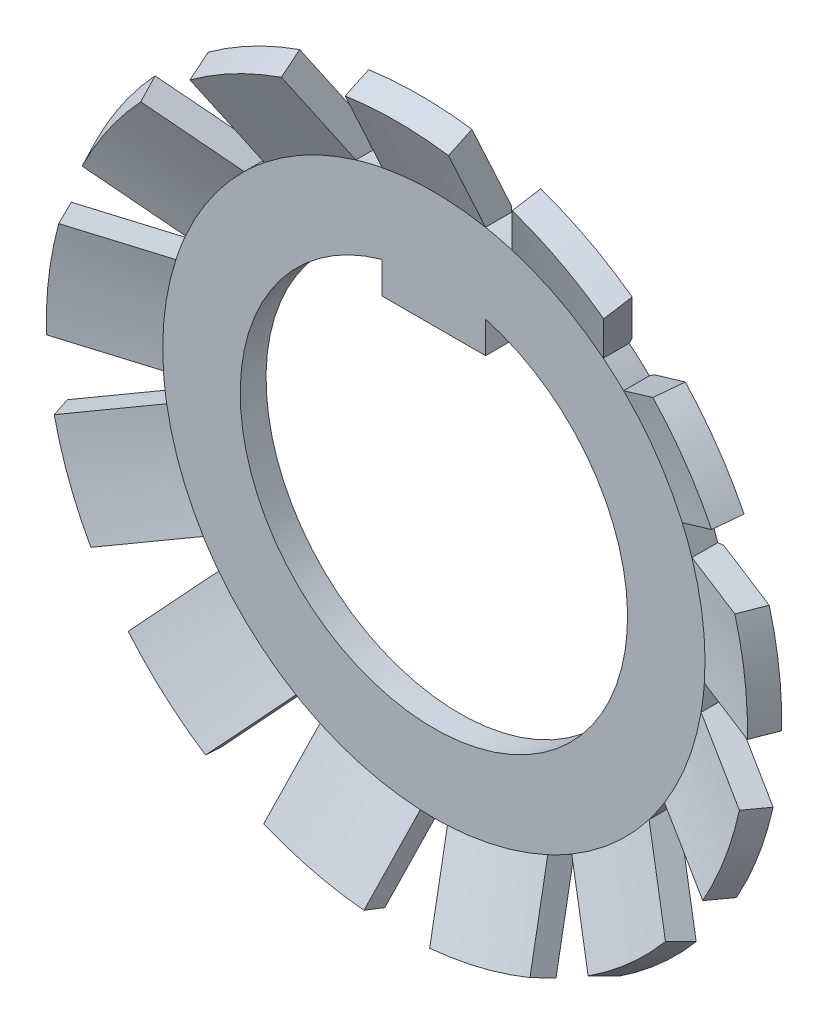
ISO-10303-21;
HEADER;
FILE_DESCRIPTION(('STEP AP214'),'2;1');
FILE_NAME('part.step','',(''),(''),'','','');
FILE_SCHEMA(('AUTOMOTIVE_DESIGN { 1 0 10303 214 1 1 1 1 }'));
ENDSEC;
DATA;
#1=APPLICATION_CONTEXT('core data for automotive mechanical design processes');
#2=APPLICATION_PROTOCOL_DEFINITION('international standard','automotive_design',2000,#1);
#3=PRODUCT_CONTEXT('',#1,'mechanical');
#4=PRODUCT('Part','Part','',(#3));
#5=PRODUCT_RELATED_PRODUCT_CATEGORY('part','',(#4));
#6=PRODUCT_DEFINITION_FORMATION('','',#4);
#7=PRODUCT_DEFINITION_CONTEXT('part definition',#1,'design');
#8=PRODUCT_DEFINITION('design','',#6,#7);
#9=PRODUCT_DEFINITION_SHAPE('','',#8);
#10=(LENGTH_UNIT() NAMED_UNIT(*) SI_UNIT(.MILLI.,.METRE.));
#11=(NAMED_UNIT(*) PLANE_ANGLE_UNIT() SI_UNIT($,.RADIAN.));
#12=(NAMED_UNIT(*) SI_UNIT($,.STERADIAN.) SOLID_ANGLE_UNIT());
#13=UNCERTAINTY_MEASURE_WITH_UNIT(LENGTH_MEASURE(1.E-05),#10,'distance_accuracy_value','');
#14=(GEOMETRIC_REPRESENTATION_CONTEXT(3) GLOBAL_UNCERTAINTY_ASSIGNED_CONTEXT((#13)) GLOBAL_UNIT_ASSIGNED_CONTEXT((#10,
#11,#12)) REPRESENTATION_CONTEXT('',''));
#15=CARTESIAN_POINT('',(0.,0.,0.));
#16=DIRECTION('',(0.,0.,1.));
#17=DIRECTION('',(1.,0.,0.));
#18=AXIS2_PLACEMENT_3D('',#15,#16,#17);
#19=CARTESIAN_POINT('',(0.,0.,1.52869888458));
#20=DIRECTION('',(0.,0.,-1.));
#21=DIRECTION('',(-1.,0.,0.));
#22=AXIS2_PLACEMENT_3D('',#19,#20,#21);
#23=CONICAL_SURFACE('',#22,14.,0.436332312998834);
#24=CARTESIAN_POINT('',(0.,0.,1.52869888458));
#25=DIRECTION('',(0.,0.,1.));
#26=DIRECTION('',(1.,0.,0.));
#27=AXIS2_PLACEMENT_3D('',#24,#25,#26);
#28=CIRCLE('',#27,14.);
#29=CARTESIAN_POINT('',(-13.514304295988,3.6556229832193,1.52869888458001));
#30=VERTEX_POINT('',#29);
#31=CARTESIAN_POINT('',(-13.996451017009,-0.31521251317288,1.52869888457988));
#32=VERTEX_POINT('',#31);
#33=EDGE_CURVE('E1416',#30,#32,#28,.T.);
#34=ORIENTED_EDGE('',*,*,#33,.T.);
#35=CARTESIAN_POINT('',(-13.9965445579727,-0.315201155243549,1.52849888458));
#36=CARTESIAN_POINT('',(-13.9258620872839,-0.323783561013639,1.67962590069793));
#37=CARTESIAN_POINT('',(-13.8551700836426,-0.332367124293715,1.83074839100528));
#38=CARTESIAN_POINT('',(-13.7137670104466,-0.349536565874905,2.13298432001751));
#39=CARTESIAN_POINT('',(-13.6430559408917,-0.358122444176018,2.2840977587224));
#40=CARTESIAN_POINT('',(-13.5723353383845,-0.366709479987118,2.4352066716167));
#41=B_SPLINE_CURVE_WITH_KNOTS('',3,(#35,#36,#37,#38,#39,#40),.UNSPECIFIED.,.F.,.F.,(4,2,4),(0.,
0.501180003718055,1.00236000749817),.UNSPECIFIED.);
#42=CARTESIAN_POINT('',(-13.5724289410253,-0.366698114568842,2.4350066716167));
#43=VERTEX_POINT('',#42);
#44=EDGE_CURVE('E892',#32,#43,#41,.T.);
#45=ORIENTED_EDGE('',*,*,#44,.T.);
#46=CARTESIAN_POINT('',(0.,0.,2.4350066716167));
#47=DIRECTION('',(0.,0.,1.));
#48=DIRECTION('',(1.,0.,0.));
#49=AXIS2_PLACEMENT_3D('',#46,#47,#48);
#50=CIRCLE('',#49,13.577381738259);
#51=CARTESIAN_POINT('',(-13.090282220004,3.60413738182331,2.4350066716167));
#52=VERTEX_POINT('',#51);
#53=EDGE_CURVE('E1134',#52,#43,#50,.T.);
#54=ORIENTED_EDGE('',*,*,#53,.F.);
#55=CARTESIAN_POINT('',(-13.0901886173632,3.60412601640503,2.4352066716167));
#56=CARTESIAN_POINT('',(-13.1609092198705,3.61271305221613,2.2840977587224));
#57=CARTESIAN_POINT('',(-13.2316202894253,3.62129893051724,2.13298432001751));
#58=CARTESIAN_POINT('',(-13.3730233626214,3.63846837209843,1.83074839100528));
#59=CARTESIAN_POINT('',(-13.4437153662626,3.64705193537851,1.67962590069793));
#60=CARTESIAN_POINT('',(-13.5143978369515,3.6556343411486,1.52849888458));
#61=B_SPLINE_CURVE_WITH_KNOTS('',3,(#55,#56,#57,#58,#59,#60),.UNSPECIFIED.,.F.,.F.,(4,2,4),(0.,
0.501180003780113,1.00236000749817),.UNSPECIFIED.);
#62=EDGE_CURVE('E493',#52,#30,#61,.T.);
#63=ORIENTED_EDGE('',*,*,#62,.T.);
#64=EDGE_LOOP('',(#34,#45,#54,#63));
#65=FACE_BOUND('',#64,.T.);
#66=ADVANCED_FACE('F33',(#65),#23,.T.);
#67=CARTESIAN_POINT('',(-13.265795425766,-2.89205231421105,2.4350066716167));
#68=VERTEX_POINT('',#67);
#69=CARTESIAN_POINT('',(-11.8473758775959,-6.63211728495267,2.4350066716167));
#70=VERTEX_POINT('',#69);
#71=EDGE_CURVE('E1138',#68,#70,#50,.T.);
#72=ORIENTED_EDGE('',*,*,#71,.F.);
#73=CARTESIAN_POINT('',(-13.2657072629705,-2.89201887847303,2.4352066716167));
#74=CARTESIAN_POINT('',(-13.332317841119,-2.91728093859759,2.2840977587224));
#75=CARTESIAN_POINT('',(-13.3989194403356,-2.94253959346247,2.13298432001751));
#76=CARTESIAN_POINT('',(-13.5321046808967,-2.99305009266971,1.83074839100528));
#77=CARTESIAN_POINT('',(-13.5986883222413,-3.01830193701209,1.67962590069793));
#78=CARTESIAN_POINT('',(-13.6652629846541,-3.04355037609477,1.52849888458));
#79=B_SPLINE_CURVE_WITH_KNOTS('',3,(#73,#74,#75,#76,#77,#78),.UNSPECIFIED.,.F.,.F.,(4,2,4),(0.,
0.501180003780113,1.00236000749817),.UNSPECIFIED.);
#80=CARTESIAN_POINT('',(-13.6651748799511,-3.04351696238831,1.52869888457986));
#81=VERTEX_POINT('',#80);
#82=EDGE_CURVE('E875',#68,#81,#79,.T.);
#83=ORIENTED_EDGE('',*,*,#82,.T.);
#84=CARTESIAN_POINT('',(-12.246755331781,-6.78358193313,1.5286988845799));
#85=VERTEX_POINT('',#84);
#86=EDGE_CURVE('E1412',#81,#85,#28,.T.);
#87=ORIENTED_EDGE('',*,*,#86,.T.);
#88=CARTESIAN_POINT('',(-12.2468434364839,-6.78361534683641,1.52849888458));
#89=CARTESIAN_POINT('',(-12.1802687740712,-6.75836690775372,1.67962590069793));
#90=CARTESIAN_POINT('',(-12.1136851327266,-6.73311506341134,1.83074839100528));
#91=CARTESIAN_POINT('',(-11.9804998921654,-6.68260456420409,2.13298432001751));
#92=CARTESIAN_POINT('',(-11.9138982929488,-6.65734590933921,2.2840977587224));
#93=CARTESIAN_POINT('',(-11.8472877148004,-6.63208384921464,2.4352066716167));
#94=B_SPLINE_CURVE_WITH_KNOTS('',3,(#88,#89,#90,#91,#92,#93),.UNSPECIFIED.,.F.,.F.,(4,2,4),(0.,
0.501180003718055,1.00236000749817),.UNSPECIFIED.);
#95=EDGE_CURVE('E1062',#85,#70,#94,.T.);
#96=ORIENTED_EDGE('',*,*,#95,.T.);
#97=EDGE_LOOP('',(#72,#83,#87,#96));
#98=FACE_BOUND('',#97,.T.);
#99=ADVANCED_FACE('F1089',(#98),#23,.T.);
#100=CARTESIAN_POINT('',(-10.4022747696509,-8.72570767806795,2.4350066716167));
#101=VERTEX_POINT('',#100);
#102=CARTESIAN_POINT('',(-7.40823177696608,-11.3781983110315,2.4350066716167));
#103=VERTEX_POINT('',#102);
#104=EDGE_CURVE('E1142',#101,#103,#50,.T.);
#105=ORIENTED_EDGE('',*,*,#104,.F.);
#106=CARTESIAN_POINT('',(-10.4022122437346,-8.72563710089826,2.4352066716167));
#107=CARTESIAN_POINT('',(-10.4494531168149,-8.77896102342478,2.2840977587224));
#108=CARTESIAN_POINT('',(-10.496687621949,-8.83227775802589,2.13298432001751));
#109=CARTESIAN_POINT('',(-10.5911438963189,-8.93889685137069,1.83074839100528));
#110=CARTESIAN_POINT('',(-10.6383656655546,-8.99219921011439,1.67962590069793));
#111=CARTESIAN_POINT('',(-10.6855810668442,-9.04549438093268,1.52849888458));
#112=B_SPLINE_CURVE_WITH_KNOTS('',3,(#106,#107,#108,#109,#110,#111),.UNSPECIFIED.,.F.,.F.,(4,2,
4),(0.,0.501180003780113,1.00236000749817),.UNSPECIFIED.);
#113=CARTESIAN_POINT('',(-10.6855185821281,-9.04542385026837,1.52869888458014));
#114=VERTEX_POINT('',#113);
#115=EDGE_CURVE('E1063',#101,#114,#112,.T.);
#116=ORIENTED_EDGE('',*,*,#115,.T.);
#117=CARTESIAN_POINT('',(-7.6914755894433,-11.697914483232,1.52869888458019));
#118=VERTEX_POINT('',#117);
#119=EDGE_CURVE('E1405',#114,#118,#28,.T.);
#120=ORIENTED_EDGE('',*,*,#119,.T.);
#121=CARTESIAN_POINT('',(-7.69153807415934,-11.6979850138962,1.52849888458));
#122=CARTESIAN_POINT('',(-7.64432267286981,-11.6446898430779,1.67962590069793));
#123=CARTESIAN_POINT('',(-7.59710090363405,-11.5913874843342,1.83074839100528));
#124=CARTESIAN_POINT('',(-7.5026446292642,-11.4847683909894,2.13298432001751));
#125=CARTESIAN_POINT('',(-7.45541012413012,-11.4314516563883,2.2840977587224));
#126=CARTESIAN_POINT('',(-7.40816925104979,-11.3781277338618,2.4352066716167));
#127=B_SPLINE_CURVE_WITH_KNOTS('',3,(#121,#122,#123,#124,#125,#126),.UNSPECIFIED.,.F.,.F.,(4,2,
4),(0.,0.501180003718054,1.00236000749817),.UNSPECIFIED.);
#128=EDGE_CURVE('E1393',#118,#103,#127,.T.);
#129=ORIENTED_EDGE('',*,*,#128,.T.);
#130=EDGE_LOOP('',(#105,#116,#120,#129));
#131=FACE_BOUND('',#130,.T.);
#132=ADVANCED_FACE('F1094',(#131),#23,.T.);
#133=CARTESIAN_POINT('',(-5.15571832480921,-12.5604085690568,2.4350066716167));
#134=VERTEX_POINT('',#133);
#135=CARTESIAN_POINT('',(-1.27195105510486,-13.5176712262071,2.4350066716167));
#136=VERTEX_POINT('',#135);
#137=EDGE_CURVE('E1147',#134,#136,#50,.T.);
#138=ORIENTED_EDGE('',*,*,#137,.F.);
#139=CARTESIAN_POINT('',(-5.15569575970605,-12.5603170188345,2.4352066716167));
#140=CARTESIAN_POINT('',(-5.17274461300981,-12.629486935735,2.2840977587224));
#141=CARTESIAN_POINT('',(-5.18979116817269,-12.6986475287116,2.13298432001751));
#142=CARTESIAN_POINT('',(-5.22387968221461,-12.836950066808,1.83074839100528));
#143=CARTESIAN_POINT('',(-5.24092164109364,-12.9060920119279,1.67962590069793));
#144=CARTESIAN_POINT('',(-5.2579613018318,-12.9752246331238,1.52849888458));
#145=B_SPLINE_CURVE_WITH_KNOTS('',3,(#139,#140,#141,#142,#143,#144),.UNSPECIFIED.,.F.,.F.,(4,2,
4),(0.,0.501180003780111,1.00236000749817),.UNSPECIFIED.);
#146=CARTESIAN_POINT('',(-5.25793875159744,-12.9751331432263,1.52869888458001));
#147=VERTEX_POINT('',#146);
#148=EDGE_CURVE('E1373',#134,#147,#145,.T.);
#149=ORIENTED_EDGE('',*,*,#148,.T.);
#150=CARTESIAN_POINT('',(-1.3741714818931,-13.932395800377,1.52869888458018));
#151=VERTEX_POINT('',#150);
#152=EDGE_CURVE('E1413',#147,#151,#28,.T.);
#153=ORIENTED_EDGE('',*,*,#152,.T.);
#154=CARTESIAN_POINT('',(-1.37419403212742,-13.9324872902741,1.52849888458));
#155=CARTESIAN_POINT('',(-1.35715437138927,-13.8633546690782,1.67962590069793));
#156=CARTESIAN_POINT('',(-1.34011241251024,-13.7942127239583,1.83074839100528));
#157=CARTESIAN_POINT('',(-1.30602389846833,-13.6559101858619,2.13298432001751));
#158=CARTESIAN_POINT('',(-1.28897734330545,-13.5867495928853,2.2840977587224));
#159=CARTESIAN_POINT('',(-1.2719284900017,-13.5175796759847,2.4352066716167));
#160=B_SPLINE_CURVE_WITH_KNOTS('',3,(#154,#155,#156,#157,#158,#159),.UNSPECIFIED.,.F.,.F.,(4,2,
4),(0.,0.501180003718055,1.00236000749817),.UNSPECIFIED.);
#161=EDGE_CURVE('E1368',#151,#136,#160,.T.);
#162=ORIENTED_EDGE('',*,*,#161,.T.);
#163=EDGE_LOOP('',(#138,#149,#153,#162));
#164=FACE_BOUND('',#163,.T.);
#165=ADVANCED_FACE('F1974',(#164),#23,.T.);
#166=CARTESIAN_POINT('',(1.27195105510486,-13.5176712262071,2.4350066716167));
#167=VERTEX_POINT('',#166);
#168=CARTESIAN_POINT('',(5.15571832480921,-12.5604085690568,2.4350066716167));
#169=VERTEX_POINT('',#168);
#170=EDGE_CURVE('E1152',#167,#169,#50,.T.);
#171=ORIENTED_EDGE('',*,*,#170,.F.);
#172=CARTESIAN_POINT('',(1.2719284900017,-13.5175796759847,2.4352066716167));
#173=CARTESIAN_POINT('',(1.28897734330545,-13.5867495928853,2.2840977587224));
#174=CARTESIAN_POINT('',(1.30602389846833,-13.6559101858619,2.13298432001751));
#175=CARTESIAN_POINT('',(1.34011241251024,-13.7942127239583,1.83074839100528));
#176=CARTESIAN_POINT('',(1.35715437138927,-13.8633546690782,1.67962590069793));
#177=CARTESIAN_POINT('',(1.37419403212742,-13.9324872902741,1.52849888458));
#178=B_SPLINE_CURVE_WITH_KNOTS('',3,(#172,#173,#174,#175,#176,#177),.UNSPECIFIED.,.F.,.F.,(4,2,
4),(0.,0.501180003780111,1.00236000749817),.UNSPECIFIED.);
#179=CARTESIAN_POINT('',(1.37417148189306,-13.9323958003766,1.52869888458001));
#180=VERTEX_POINT('',#179);
#181=EDGE_CURVE('E1345',#167,#180,#178,.T.);
#182=ORIENTED_EDGE('',*,*,#181,.T.);
#183=CARTESIAN_POINT('',(5.2579387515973,-12.975133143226,1.52869888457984));
#184=VERTEX_POINT('',#183);
#185=EDGE_CURVE('E1417',#180,#184,#28,.T.);
#186=ORIENTED_EDGE('',*,*,#185,.T.);
#187=CARTESIAN_POINT('',(5.2579613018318,-12.9752246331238,1.52849888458));
#188=CARTESIAN_POINT('',(5.24092164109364,-12.9060920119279,1.67962590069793));
#189=CARTESIAN_POINT('',(5.22387968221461,-12.836950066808,1.83074839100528));
#190=CARTESIAN_POINT('',(5.18979116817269,-12.6986475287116,2.13298432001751));
#191=CARTESIAN_POINT('',(5.17274461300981,-12.629486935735,2.2840977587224));
#192=CARTESIAN_POINT('',(5.15569575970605,-12.5603170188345,2.4352066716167));
#193=B_SPLINE_CURVE_WITH_KNOTS('',3,(#187,#188,#189,#190,#191,#192),.UNSPECIFIED.,.F.,.F.,(4,2,
4),(0.,0.501180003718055,1.00236000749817),.UNSPECIFIED.);
#194=EDGE_CURVE('E1340',#184,#169,#193,.T.);
#195=ORIENTED_EDGE('',*,*,#194,.T.);
#196=EDGE_LOOP('',(#171,#182,#186,#195));
#197=FACE_BOUND('',#196,.T.);
#198=ADVANCED_FACE('F1970',(#197),#23,.T.);
#199=CARTESIAN_POINT('',(7.40823177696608,-11.3781983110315,2.4350066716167));
#200=VERTEX_POINT('',#199);
#201=CARTESIAN_POINT('',(10.4022747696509,-8.72570767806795,2.4350066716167));
#202=VERTEX_POINT('',#201);
#203=EDGE_CURVE('E1158',#200,#202,#50,.T.);
#204=ORIENTED_EDGE('',*,*,#203,.F.);
#205=CARTESIAN_POINT('',(7.40816925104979,-11.3781277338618,2.4352066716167));
#206=CARTESIAN_POINT('',(7.45541012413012,-11.4314516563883,2.2840977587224));
#207=CARTESIAN_POINT('',(7.5026446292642,-11.4847683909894,2.13298432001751));
#208=CARTESIAN_POINT('',(7.59710090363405,-11.5913874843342,1.83074839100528));
#209=CARTESIAN_POINT('',(7.64432267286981,-11.6446898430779,1.67962590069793));
#210=CARTESIAN_POINT('',(7.69153807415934,-11.6979850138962,1.52849888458));
#211=B_SPLINE_CURVE_WITH_KNOTS('',3,(#205,#206,#207,#208,#209,#210),.UNSPECIFIED.,.F.,.F.,(4,2,
4),(0.,0.501180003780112,1.00236000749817),.UNSPECIFIED.);
#212=CARTESIAN_POINT('',(7.69147558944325,-11.6979144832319,1.52869888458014));
#213=VERTEX_POINT('',#212);
#214=EDGE_CURVE('E1317',#200,#213,#211,.T.);
#215=ORIENTED_EDGE('',*,*,#214,.T.);
#216=CARTESIAN_POINT('',(10.685518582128,-9.0454238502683,1.52869888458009));
#217=VERTEX_POINT('',#216);
#218=EDGE_CURVE('E2310',#213,#217,#28,.T.);
#219=ORIENTED_EDGE('',*,*,#218,.T.);
#220=CARTESIAN_POINT('',(10.6855810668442,-9.04549438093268,1.52849888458));
#221=CARTESIAN_POINT('',(10.6383656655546,-8.99219921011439,1.67962590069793));
#222=CARTESIAN_POINT('',(10.5911438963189,-8.93889685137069,1.83074839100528));
#223=CARTESIAN_POINT('',(10.496687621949,-8.83227775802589,2.13298432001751));
#224=CARTESIAN_POINT('',(10.4494531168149,-8.77896102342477,2.2840977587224));
#225=CARTESIAN_POINT('',(10.4022122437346,-8.72563710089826,2.4352066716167));
#226=B_SPLINE_CURVE_WITH_KNOTS('',3,(#220,#221,#222,#223,#224,#225),.UNSPECIFIED.,.F.,.F.,(4,2,
4),(0.,0.501180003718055,1.00236000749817),.UNSPECIFIED.);
#227=EDGE_CURVE('E1312',#217,#202,#226,.T.);
#228=ORIENTED_EDGE('',*,*,#227,.T.);
#229=EDGE_LOOP('',(#204,#215,#219,#228));
#230=FACE_BOUND('',#229,.T.);
#231=ADVANCED_FACE('F1966',(#230),#23,.T.);
#232=CARTESIAN_POINT('',(11.8473758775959,-6.63211728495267,2.4350066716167));
#233=VERTEX_POINT('',#232);
#234=CARTESIAN_POINT('',(13.265795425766,-2.89205231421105,2.4350066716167));
#235=VERTEX_POINT('',#234);
#236=EDGE_CURVE('E1164',#233,#235,#50,.T.);
#237=ORIENTED_EDGE('',*,*,#236,.F.);
#238=CARTESIAN_POINT('',(11.8472877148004,-6.63208384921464,2.4352066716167));
#239=CARTESIAN_POINT('',(11.9138982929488,-6.65734590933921,2.2840977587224));
#240=CARTESIAN_POINT('',(11.9804998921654,-6.68260456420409,2.13298432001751));
#241=CARTESIAN_POINT('',(12.1136851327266,-6.73311506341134,1.83074839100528));
#242=CARTESIAN_POINT('',(12.1802687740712,-6.75836690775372,1.67962590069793));
#243=CARTESIAN_POINT('',(12.2468434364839,-6.78361534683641,1.52849888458));
#244=B_SPLINE_CURVE_WITH_KNOTS('',3,(#238,#239,#240,#241,#242,#243),.UNSPECIFIED.,.F.,.F.,(4,2,
4),(0.,0.501180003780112,1.00236000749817),.UNSPECIFIED.);
#245=CARTESIAN_POINT('',(12.2467553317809,-6.78358193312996,1.52869888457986));
#246=VERTEX_POINT('',#245);
#247=EDGE_CURVE('E1290',#233,#246,#244,.T.);
#248=ORIENTED_EDGE('',*,*,#247,.T.);
#249=CARTESIAN_POINT('',(13.665174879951,-3.0435169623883,1.52869888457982));
#250=VERTEX_POINT('',#249);
#251=EDGE_CURVE('E1421',#246,#250,#28,.T.);
#252=ORIENTED_EDGE('',*,*,#251,.T.);
#253=CARTESIAN_POINT('',(13.6652629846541,-3.04355037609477,1.52849888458));
#254=CARTESIAN_POINT('',(13.5986883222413,-3.01830193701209,1.67962590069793));
#255=CARTESIAN_POINT('',(13.5321046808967,-2.99305009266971,1.83074839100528));
#256=CARTESIAN_POINT('',(13.3989194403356,-2.94253959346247,2.13298432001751));
#257=CARTESIAN_POINT('',(13.332317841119,-2.91728093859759,2.2840977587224));
#258=CARTESIAN_POINT('',(13.2657072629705,-2.89201887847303,2.4352066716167));
#259=B_SPLINE_CURVE_WITH_KNOTS('',3,(#253,#254,#255,#256,#257,#258),.UNSPECIFIED.,.F.,.F.,(4,2,
4),(0.,0.501180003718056,1.00236000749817),.UNSPECIFIED.);
#260=EDGE_CURVE('E1285',#250,#235,#259,.T.);
#261=ORIENTED_EDGE('',*,*,#260,.T.);
#262=EDGE_LOOP('',(#237,#248,#252,#261));
#263=FACE_BOUND('',#262,.T.);
#264=ADVANCED_FACE('F1961',(#263),#23,.T.);
#265=CARTESIAN_POINT('',(13.5724289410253,-0.366698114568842,2.4350066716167));
#266=VERTEX_POINT('',#265);
#267=CARTESIAN_POINT('',(13.090282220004,3.60413738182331,2.4350066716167));
#268=VERTEX_POINT('',#267);
#269=EDGE_CURVE('E684',#266,#268,#50,.T.);
#270=ORIENTED_EDGE('',*,*,#269,.F.);
#271=CARTESIAN_POINT('',(13.5723353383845,-0.366709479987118,2.4352066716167));
#272=CARTESIAN_POINT('',(13.6430559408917,-0.358122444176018,2.2840977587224));
#273=CARTESIAN_POINT('',(13.7137670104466,-0.349536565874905,2.13298432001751));
#274=CARTESIAN_POINT('',(13.8551700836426,-0.332367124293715,1.83074839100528));
#275=CARTESIAN_POINT('',(13.9258620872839,-0.323783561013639,1.67962590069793));
#276=CARTESIAN_POINT('',(13.9965445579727,-0.315201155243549,1.52849888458));
#277=B_SPLINE_CURVE_WITH_KNOTS('',3,(#271,#272,#273,#274,#275,#276),.UNSPECIFIED.,.F.,.F.,(4,2,
4),(0.,0.501180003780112,1.00236000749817),.UNSPECIFIED.);
#278=CARTESIAN_POINT('',(13.9964510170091,-0.315212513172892,1.52869888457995));
#279=VERTEX_POINT('',#278);
#280=EDGE_CURVE('E1263',#266,#279,#277,.T.);
#281=ORIENTED_EDGE('',*,*,#280,.T.);
#282=CARTESIAN_POINT('',(13.514304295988,3.6556229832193,1.52869888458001));
#283=VERTEX_POINT('',#282);
#284=EDGE_CURVE('E1418',#279,#283,#28,.T.);
#285=ORIENTED_EDGE('',*,*,#284,.T.);
#286=CARTESIAN_POINT('',(13.5143978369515,3.6556343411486,1.52849888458));
#287=CARTESIAN_POINT('',(13.4437153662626,3.64705193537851,1.67962590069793));
#288=CARTESIAN_POINT('',(13.3730233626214,3.63846837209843,1.83074839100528));
#289=CARTESIAN_POINT('',(13.2316202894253,3.62129893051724,2.13298432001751));
#290=CARTESIAN_POINT('',(13.1609092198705,3.61271305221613,2.2840977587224));
#291=CARTESIAN_POINT('',(13.0901886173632,3.60412601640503,2.4352066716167));
#292=B_SPLINE_CURVE_WITH_KNOTS('',3,(#286,#287,#288,#289,#290,#291),.UNSPECIFIED.,.F.,.F.,(4,2,
4),(0.,0.501180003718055,1.00236000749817),.UNSPECIFIED.);
#293=EDGE_CURVE('E1258',#283,#268,#292,.T.);
#294=ORIENTED_EDGE('',*,*,#293,.T.);
#295=EDGE_LOOP('',(#270,#281,#285,#294));
#296=FACE_BOUND('',#295,.T.);
#297=ADVANCED_FACE('F1959',(#296),#23,.T.);
#298=CARTESIAN_POINT('',(12.1882020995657,5.98272717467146,2.4350066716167));
#299=VERTEX_POINT('',#298);
#300=CARTESIAN_POINT('',(9.91594311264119,9.27466263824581,2.4350066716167));
#301=VERTEX_POINT('',#300);
#302=EDGE_CURVE('E683',#299,#301,#50,.T.);
#303=ORIENTED_EDGE('',*,*,#302,.F.);
#304=CARTESIAN_POINT('',(12.1881245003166,5.98267361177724,2.4352066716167));
#305=CARTESIAN_POINT('',(12.2467538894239,6.02314255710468,2.2840977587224));
#306=CARTESIAN_POINT('',(12.3053753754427,6.06360604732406,2.13298432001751));
#307=CARTESIAN_POINT('',(12.4226025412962,6.14452211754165,1.83074839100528));
#308=CARTESIAN_POINT('',(12.4812082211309,6.18497469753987,1.67962590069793));
#309=CARTESIAN_POINT('',(12.5398059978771,6.22542182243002,1.52849888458));
#310=B_SPLINE_CURVE_WITH_KNOTS('',3,(#304,#305,#306,#307,#308,#309),.UNSPECIFIED.,.F.,.F.,(4,2,
4),(0.,0.501180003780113,1.00236000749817),.UNSPECIFIED.);
#311=CARTESIAN_POINT('',(12.5397284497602,6.22536829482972,1.52869888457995));
#312=VERTEX_POINT('',#311);
#313=EDGE_CURVE('E1235',#299,#312,#310,.T.);
#314=ORIENTED_EDGE('',*,*,#313,.T.);
#315=CARTESIAN_POINT('',(10.267469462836,9.5173037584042,1.52869888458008));
#316=VERTEX_POINT('',#315);
#317=EDGE_CURVE('E1423',#312,#316,#28,.T.);
#318=ORIENTED_EDGE('',*,*,#317,.T.);
#319=CARTESIAN_POINT('',(10.2675470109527,9.51735728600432,1.52849888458));
#320=CARTESIAN_POINT('',(10.2089492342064,9.47691016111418,1.67962590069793));
#321=CARTESIAN_POINT('',(10.1503435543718,9.43645758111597,1.83074839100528));
#322=CARTESIAN_POINT('',(10.0331163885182,9.35554151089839,2.13298432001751));
#323=CARTESIAN_POINT('',(9.97449490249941,9.31507802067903,2.2840977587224));
#324=CARTESIAN_POINT('',(9.91586551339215,9.27460907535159,2.4352066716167));
#325=B_SPLINE_CURVE_WITH_KNOTS('',3,(#319,#320,#321,#322,#323,#324),.UNSPECIFIED.,.F.,.F.,(4,2,
4),(0.,0.501180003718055,1.00236000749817),.UNSPECIFIED.);
#326=EDGE_CURVE('E1231',#316,#301,#325,.T.);
#327=ORIENTED_EDGE('',*,*,#326,.T.);
#328=EDGE_LOOP('',(#303,#314,#318,#327));
#329=FACE_BOUND('',#328,.T.);
#330=ADVANCED_FACE('F1946',(#329),#23,.T.);
#331=CARTESIAN_POINT('',(8.01180504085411,10.9615817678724,2.4350066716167));
#332=VERTEX_POINT('',#331);
#333=CARTESIAN_POINT('',(4.46998093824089,12.8204744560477,2.4350066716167));
#334=VERTEX_POINT('',#333);
#335=EDGE_CURVE('E1132',#332,#334,#50,.T.);
#336=ORIENTED_EDGE('',*,*,#335,.F.);
#337=CARTESIAN_POINT('',(8.01176122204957,10.9614982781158,2.4352066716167));
#338=CARTESIAN_POINT('',(8.04486811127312,11.0245781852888,2.2840977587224));
#339=CARTESIAN_POINT('',(8.07797053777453,11.0876495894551,2.13298432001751));
#340=CARTESIAN_POINT('',(8.14416646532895,11.2137753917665,1.83074839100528));
#341=CARTESIAN_POINT('',(8.17725996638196,11.2768297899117,1.67962590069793));
#342=CARTESIAN_POINT('',(8.21034900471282,11.3398756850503,1.52849888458));
#343=B_SPLINE_CURVE_WITH_KNOTS('',3,(#337,#338,#339,#340,#341,#342),.UNSPECIFIED.,.F.,.F.,(4,2,
4),(0.,0.501180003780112,1.00236000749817),.UNSPECIFIED.);
#344=CARTESIAN_POINT('',(8.21030521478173,11.3397922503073,1.52869888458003));
#345=VERTEX_POINT('',#344);
#346=EDGE_CURVE('E1200',#332,#345,#343,.T.);
#347=ORIENTED_EDGE('',*,*,#346,.T.);
#348=CARTESIAN_POINT('',(4.6684811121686,13.198684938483,1.52869888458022));
#349=VERTEX_POINT('',#348);
#350=EDGE_CURVE('E1203',#345,#349,#28,.T.);
#351=ORIENTED_EDGE('',*,*,#350,.T.);
#352=CARTESIAN_POINT('',(4.66852490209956,13.1987683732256,1.52849888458));
#353=CARTESIAN_POINT('',(4.6354358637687,13.135722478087,1.67962590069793));
#354=CARTESIAN_POINT('',(4.6023423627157,13.0726680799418,1.83074839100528));
#355=CARTESIAN_POINT('',(4.5361464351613,12.9465422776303,2.13298432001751));
#356=CARTESIAN_POINT('',(4.5030440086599,12.883470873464,2.2840977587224));
#357=CARTESIAN_POINT('',(4.46993711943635,12.8203909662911,2.4352066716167));
#358=B_SPLINE_CURVE_WITH_KNOTS('',3,(#352,#353,#354,#355,#356,#357),.UNSPECIFIED.,.F.,.F.,(4,2,
4),(0.,0.501180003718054,1.00236000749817),.UNSPECIFIED.);
#359=EDGE_CURVE('E1202',#349,#334,#358,.T.);
#360=ORIENTED_EDGE('',*,*,#359,.T.);
#361=EDGE_LOOP('',(#336,#347,#351,#360));
#362=FACE_BOUND('',#361,.T.);
#363=ADVANCED_FACE('F1115',(#362),#23,.T.);
#364=CARTESIAN_POINT('',(2.,13.429270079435,2.4350066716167));
#365=VERTEX_POINT('',#364);
#366=CARTESIAN_POINT('',(-2.,13.429270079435,2.4350066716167));
#367=VERTEX_POINT('',#366);
#368=EDGE_CURVE('E1129',#365,#367,#50,.T.);
#369=ORIENTED_EDGE('',*,*,#368,.F.);
#370=CARTESIAN_POINT('',(2.,10.6342004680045,8.34686142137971));
#371=CARTESIAN_POINT('',(2.,11.1301481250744,7.30151283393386));
#372=CARTESIAN_POINT('',(2.,11.6252177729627,6.25574846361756));
#373=CARTESIAN_POINT('',(2.,12.6140257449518,4.16359153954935));
#374=CARTESIAN_POINT('',(2.,13.1077640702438,3.11719898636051));
#375=CARTESIAN_POINT('',(2.,14.094334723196,1.02398774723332));
#376=CARTESIAN_POINT('',(2.,14.5871670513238,-0.0228309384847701));
#377=CARTESIAN_POINT('',(2.,15.5721425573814,-2.11679362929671));
#378=CARTESIAN_POINT('',(2.,16.0642857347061,-3.16393763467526));
#379=CARTESIAN_POINT('',(2.,16.5561922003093,-4.21119270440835));
#380=B_SPLINE_CURVE_WITH_KNOTS('',3,(#370,#371,#372,#373,#374,#375,#376,#377,#378,#379),
.UNSPECIFIED.,.F.,.F.,(4,2,2,2,4),(0.,3.47108772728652,6.94217234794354,10.4132551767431,
13.8843410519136),.UNSPECIFIED.);
#381=CARTESIAN_POINT('',(2.,13.856406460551,1.52869888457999));
#382=VERTEX_POINT('',#381);
#383=EDGE_CURVE('E1207',#365,#382,#380,.T.);
#384=ORIENTED_EDGE('',*,*,#383,.T.);
#385=CARTESIAN_POINT('',(-2.,13.856406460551,1.52869888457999));
#386=VERTEX_POINT('',#385);
#387=EDGE_CURVE('E1945',#382,#386,#28,.T.);
#388=ORIENTED_EDGE('',*,*,#387,.T.);
#389=CARTESIAN_POINT('',(-2.,16.5561922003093,-4.21119270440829));
#390=CARTESIAN_POINT('',(-2.,16.064285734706,-3.16393763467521));
#391=CARTESIAN_POINT('',(-2.,15.5721425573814,-2.11679362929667));
#392=CARTESIAN_POINT('',(-2.,14.5871670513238,-0.0228309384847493));
#393=CARTESIAN_POINT('',(-2.,14.094334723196,1.02398774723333));
#394=CARTESIAN_POINT('',(-2.,13.1077640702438,3.11719898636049));
#395=CARTESIAN_POINT('',(-2.,12.6140257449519,4.16359153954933));
#396=CARTESIAN_POINT('',(-2.,11.6252177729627,6.25574846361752));
#397=CARTESIAN_POINT('',(-2.,11.1301481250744,7.30151283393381));
#398=CARTESIAN_POINT('',(-2.,10.6342004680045,8.34686142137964));
#399=B_SPLINE_CURVE_WITH_KNOTS('',3,(#389,#390,#391,#392,#393,#394,#395,#396,#397,#398),
.UNSPECIFIED.,.F.,.F.,(4,2,2,2,4),(0.,3.47108587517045,6.94216870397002,10.413253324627,
13.8843410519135),.UNSPECIFIED.);
#400=EDGE_CURVE('E1834',#386,#367,#399,.T.);
#401=ORIENTED_EDGE('',*,*,#400,.T.);
#402=EDGE_LOOP('',(#369,#384,#388,#401));
#403=FACE_BOUND('',#402,.T.);
#404=ADVANCED_FACE('F1107',(#403),#23,.T.);
#405=CARTESIAN_POINT('',(-4.46998093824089,12.8204744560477,2.4350066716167));
#406=VERTEX_POINT('',#405);
#407=CARTESIAN_POINT('',(-8.01180504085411,10.9615817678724,2.4350066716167));
#408=VERTEX_POINT('',#407);
#409=EDGE_CURVE('E1121',#406,#408,#50,.T.);
#410=ORIENTED_EDGE('',*,*,#409,.F.);
#411=CARTESIAN_POINT('',(-4.46993711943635,12.8203909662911,2.4352066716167));
#412=CARTESIAN_POINT('',(-4.5030440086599,12.883470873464,2.2840977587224));
#413=CARTESIAN_POINT('',(-4.5361464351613,12.9465422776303,2.13298432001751));
#414=CARTESIAN_POINT('',(-4.6023423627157,13.0726680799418,1.83074839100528));
#415=CARTESIAN_POINT('',(-4.6354358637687,13.135722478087,1.67962590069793));
#416=CARTESIAN_POINT('',(-4.66852490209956,13.1987683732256,1.52849888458));
#417=B_SPLINE_CURVE_WITH_KNOTS('',3,(#411,#412,#413,#414,#415,#416),.UNSPECIFIED.,.F.,.F.,(4,2,
4),(0.,0.501180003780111,1.00236000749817),.UNSPECIFIED.);
#418=CARTESIAN_POINT('',(-4.66848111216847,13.1986849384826,1.52869888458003));
#419=VERTEX_POINT('',#418);
#420=EDGE_CURVE('E1123',#406,#419,#417,.T.);
#421=ORIENTED_EDGE('',*,*,#420,.T.);
#422=CARTESIAN_POINT('',(-8.2103052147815,11.339792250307,1.52869888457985));
#423=VERTEX_POINT('',#422);
#424=EDGE_CURVE('E1944',#419,#423,#28,.T.);
#425=ORIENTED_EDGE('',*,*,#424,.T.);
#426=CARTESIAN_POINT('',(-8.21034900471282,11.3398756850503,1.52849888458));
#427=CARTESIAN_POINT('',(-8.17725996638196,11.2768297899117,1.67962590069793));
#428=CARTESIAN_POINT('',(-8.14416646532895,11.2137753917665,1.83074839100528));
#429=CARTESIAN_POINT('',(-8.07797053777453,11.0876495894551,2.13298432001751));
#430=CARTESIAN_POINT('',(-8.04486811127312,11.0245781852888,2.2840977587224));
#431=CARTESIAN_POINT('',(-8.01176122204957,10.9614982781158,2.4352066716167));
#432=B_SPLINE_CURVE_WITH_KNOTS('',3,(#426,#427,#428,#429,#430,#431),.UNSPECIFIED.,.F.,.F.,(4,2,
4),(0.,0.501180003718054,1.00236000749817),.UNSPECIFIED.);
#433=EDGE_CURVE('E1125',#423,#408,#432,.T.);
#434=ORIENTED_EDGE('',*,*,#433,.T.);
#435=EDGE_LOOP('',(#410,#421,#425,#434));
#436=FACE_BOUND('',#435,.T.);
#437=ADVANCED_FACE('F1099',(#436),#23,.T.);
#438=CARTESIAN_POINT('',(0.,0.,2.4350066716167));
#439=DIRECTION('',(0.,0.,1.));
#440=DIRECTION('',(1.,0.,0.));
#441=AXIS2_PLACEMENT_3D('',#438,#439,#440);
#442=CONICAL_SURFACE('',#441,13.577381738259,1.13446401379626);
#443=ORIENTED_EDGE('',*,*,#53,.T.);
#444=CARTESIAN_POINT('',(-13.5728594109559,-0.366645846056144,2.4352066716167));
#445=CARTESIAN_POINT('',(-13.3147250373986,-0.397989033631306,2.3152764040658));
#446=CARTESIAN_POINT('',(-13.0565630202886,-0.429335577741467,2.19540647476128));
#447=CARTESIAN_POINT('',(-12.5401708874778,-0.492036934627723,1.95581589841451));
#448=CARTESIAN_POINT('',(-12.2819407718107,-0.523391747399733,1.83609525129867));
#449=CARTESIAN_POINT('',(-11.7653993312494,-0.586111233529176,1.59683170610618));
#450=CARTESIAN_POINT('',(-11.5070880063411,-0.617475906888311,1.47728880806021));
#451=CARTESIAN_POINT('',(-10.9903650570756,-0.680217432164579,1.23842285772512));
#452=CARTESIAN_POINT('',(-10.7319534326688,-0.711594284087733,1.11909980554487));
#453=CARTESIAN_POINT('',(-10.473482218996,-0.742978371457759,0.999907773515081));
#454=B_SPLINE_CURVE_WITH_KNOTS('',3,(#444,#445,#446,#447,#448,#449,#450,#451,#452,#453),
.UNSPECIFIED.,.F.,.F.,(4,2,2,2,4),(0.,0.85906414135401,1.71812785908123,2.57719172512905,
3.43625601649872),.UNSPECIFIED.);
#455=CARTESIAN_POINT('',(-10.473682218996,-0.742954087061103,1.));
#456=VERTEX_POINT('',#455);
#457=EDGE_CURVE('E1817',#43,#456,#454,.T.);
#458=ORIENTED_EDGE('',*,*,#457,.T.);
#459=CARTESIAN_POINT('',(0.,0.,1.));
#460=DIRECTION('',(0.,0.,1.));
#461=DIRECTION('',(1.,0.,0.));
#462=AXIS2_PLACEMENT_3D('',#459,#460,#461);
#463=CIRCLE('',#462,10.5);
#464=CARTESIAN_POINT('',(-9.991535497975,3.2278814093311,1.));
#465=VERTEX_POINT('',#464);
#466=EDGE_CURVE('E1456',#465,#456,#463,.T.);
#467=ORIENTED_EDGE('',*,*,#466,.F.);
#468=CARTESIAN_POINT('',(-9.991335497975,3.22785712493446,0.999907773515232));
#469=CARTESIAN_POINT('',(-10.2498067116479,3.25924121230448,1.11909980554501));
#470=CARTESIAN_POINT('',(-10.5082183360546,3.29061806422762,1.23842285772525));
#471=CARTESIAN_POINT('',(-11.02494128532,3.35335958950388,1.47728880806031));
#472=CARTESIAN_POINT('',(-11.2832526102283,3.38472426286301,1.59683170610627));
#473=CARTESIAN_POINT('',(-11.7997940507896,3.44744374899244,1.83609525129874));
#474=CARTESIAN_POINT('',(-12.0580241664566,3.47879856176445,1.95581589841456));
#475=CARTESIAN_POINT('',(-12.5744162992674,3.54149991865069,2.1954064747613));
#476=CARTESIAN_POINT('',(-12.8325783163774,3.57284646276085,2.31527640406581));
#477=CARTESIAN_POINT('',(-13.0907126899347,3.60418965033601,2.4352066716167));
#478=B_SPLINE_CURVE_WITH_KNOTS('',3,(#468,#469,#470,#471,#472,#473,#474,#475,#476,#477),
.UNSPECIFIED.,.F.,.F.,(4,2,2,2,4),(0.,0.859064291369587,1.71812815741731,2.57719187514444,
3.43625601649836),.UNSPECIFIED.);
#479=EDGE_CURVE('E658',#465,#52,#478,.T.);
#480=ORIENTED_EDGE('',*,*,#479,.T.);
#481=EDGE_LOOP('',(#443,#458,#467,#480));
#482=FACE_BOUND('',#481,.T.);
#483=ADVANCED_FACE('F903',(#482),#442,.F.);
#484=CARTESIAN_POINT('',(-10.347136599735,-1.7851510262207,1.));
#485=VERTEX_POINT('',#484);
#486=CARTESIAN_POINT('',(-8.92871705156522,-5.52521599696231,1.));
#487=VERTEX_POINT('',#486);
#488=EDGE_CURVE('E1453',#485,#487,#463,.T.);
#489=ORIENTED_EDGE('',*,*,#488,.F.);
#490=CARTESIAN_POINT('',(-10.346936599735,-1.78507517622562,0.999902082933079));
#491=CARTESIAN_POINT('',(-10.5903873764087,-1.87740387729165,1.11909458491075));
#492=CARTESIAN_POINT('',(-10.8337820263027,-1.96971129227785,1.23841810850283));
#493=CARTESIAN_POINT('',(-11.3204768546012,-2.15429029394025,1.47728500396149));
#494=CARTESIAN_POINT('',(-11.5637770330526,-2.24656188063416,1.59682837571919));
#495=CARTESIAN_POINT('',(-12.0503008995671,-2.43107604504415,1.83609287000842));
#496=CARTESIAN_POINT('',(-12.2935245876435,-2.52331862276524,1.95581399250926));
#497=CARTESIAN_POINT('',(-12.779907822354,-2.70777945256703,2.19540552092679));
#498=CARTESIAN_POINT('',(-13.0230673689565,-2.79999770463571,2.31527592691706));
#499=CARTESIAN_POINT('',(-13.266200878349,-2.89220608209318,2.4352066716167));
#500=B_SPLINE_CURVE_WITH_KNOTS('',3,(#490,#491,#492,#493,#494,#495,#496,#497,#498,#499),
.UNSPECIFIED.,.F.,.F.,(4,2,2,2,4),(0.,0.859067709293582,1.71813499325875,2.57720212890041,
3.43626968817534),.UNSPECIFIED.);
#501=EDGE_CURVE('E881',#485,#68,#500,.T.);
#502=ORIENTED_EDGE('',*,*,#501,.T.);
#503=ORIENTED_EDGE('',*,*,#71,.T.);
#504=CARTESIAN_POINT('',(-11.8477813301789,-6.6322710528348,2.4352066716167));
#505=CARTESIAN_POINT('',(-11.6046478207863,-6.54006267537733,2.31527592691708));
#506=CARTESIAN_POINT('',(-11.3614882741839,-6.44784442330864,2.19540552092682));
#507=CARTESIAN_POINT('',(-10.8751050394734,-6.26338359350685,1.95581399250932));
#508=CARTESIAN_POINT('',(-10.6318813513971,-6.17114101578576,1.83609287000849));
#509=CARTESIAN_POINT('',(-10.1453574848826,-5.98662685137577,1.59682837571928));
#510=CARTESIAN_POINT('',(-9.90205730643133,-5.89435526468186,1.4772850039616));
#511=CARTESIAN_POINT('',(-9.41536247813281,-5.70977626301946,1.23841810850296));
#512=CARTESIAN_POINT('',(-9.17196782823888,-5.61746884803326,1.11909458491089));
#513=CARTESIAN_POINT('',(-8.92851705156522,-5.52514014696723,0.99990208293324));
#514=B_SPLINE_CURVE_WITH_KNOTS('',3,(#504,#505,#506,#507,#508,#509,#510,#511,#512,#513),
.UNSPECIFIED.,.F.,.F.,(4,2,2,2,4),(0.,0.859067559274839,1.71813469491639,2.57720197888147,
3.43626968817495),.UNSPECIFIED.);
#515=EDGE_CURVE('E882',#70,#487,#514,.T.);
#516=ORIENTED_EDGE('',*,*,#515,.T.);
#517=EDGE_LOOP('',(#489,#502,#503,#516));
#518=FACE_BOUND('',#517,.T.);
#519=ADVANCED_FACE('F1113',(#518),#442,.F.);
#520=CARTESIAN_POINT('',(-8.3323334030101,-6.3892268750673,1.));
#521=VERTEX_POINT('',#520);
#522=CARTESIAN_POINT('',(-5.33829041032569,-9.0417175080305,1.));
#523=VERTEX_POINT('',#522);
#524=EDGE_CURVE('E1451',#521,#523,#463,.T.);
#525=ORIENTED_EDGE('',*,*,#524,.F.);
#526=CARTESIAN_POINT('',(-8.33215621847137,-6.3890268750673,0.999877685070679));
#527=CARTESIAN_POINT('',(-8.50481683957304,-6.58392042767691,1.11907220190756));
#528=CARTESIAN_POINT('',(-8.67743765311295,-6.77876904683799,1.23839774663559));
#529=CARTESIAN_POINT('',(-9.02261227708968,-7.16839065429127,1.47726869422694));
#530=CARTESIAN_POINT('',(-9.19516608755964,-7.36316364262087,1.59681409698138));
#531=CARTESIAN_POINT('',(-9.5402194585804,-7.75264838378,1.83608266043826));
#532=CARTESIAN_POINT('',(-9.71271901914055,-7.9473601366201,1.95580582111));
#533=CARTESIAN_POINT('',(-10.0576726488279,-8.33673229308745,2.1954014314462));
#534=CARTESIAN_POINT('',(-10.2301267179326,-8.53139269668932,2.31527388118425));
#535=CARTESIAN_POINT('',(-10.4025623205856,-8.72603225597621,2.4352066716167));
#536=B_SPLINE_CURVE_WITH_KNOTS('',3,(#526,#527,#528,#529,#530,#531,#532,#533,#534,#535),
.UNSPECIFIED.,.F.,.F.,(4,2,2,2,4),(0.,0.859082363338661,1.71816430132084,2.57724609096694,
3.43632830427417),.UNSPECIFIED.);
#537=EDGE_CURVE('E1057',#521,#101,#536,.T.);
#538=ORIENTED_EDGE('',*,*,#537,.T.);
#539=ORIENTED_EDGE('',*,*,#104,.T.);
#540=CARTESIAN_POINT('',(-7.40851932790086,-11.3785228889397,2.4352066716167));
#541=CARTESIAN_POINT('',(-7.23608372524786,-11.1838833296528,2.31527388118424));
#542=CARTESIAN_POINT('',(-7.06362965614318,-10.9892229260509,2.1954014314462));
#543=CARTESIAN_POINT('',(-6.7186760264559,-10.5998507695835,1.95580582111));
#544=CARTESIAN_POINT('',(-6.54617646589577,-10.4051390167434,1.83608266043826));
#545=CARTESIAN_POINT('',(-6.20112309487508,-10.0156542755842,1.59681409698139));
#546=CARTESIAN_POINT('',(-6.02856928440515,-9.82088128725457,1.47726869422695));
#547=CARTESIAN_POINT('',(-5.68339466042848,-9.43125967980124,1.23839774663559));
#548=CARTESIAN_POINT('',(-5.5107738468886,-9.23641106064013,1.11907220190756));
#549=CARTESIAN_POINT('',(-5.33811322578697,-9.0415175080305,0.999877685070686));
#550=B_SPLINE_CURVE_WITH_KNOTS('',3,(#540,#541,#542,#543,#544,#545,#546,#547,#548,#549),
.UNSPECIFIED.,.F.,.F.,(4,2,2,2,4),(0.,0.859082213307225,1.71816400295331,2.57724594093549,
3.43632830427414),.UNSPECIFIED.);
#551=EDGE_CURVE('E1050',#103,#523,#550,.T.);
#552=ORIENTED_EDGE('',*,*,#551,.T.);
#553=EDGE_LOOP('',(#525,#538,#539,#552));
#554=FACE_BOUND('',#553,.T.);
#555=ADVANCED_FACE('F2116',(#554),#442,.F.);
#556=CARTESIAN_POINT('',(-4.4086930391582,-9.5296078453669,1.));
#557=VERTEX_POINT('',#556);
#558=CARTESIAN_POINT('',(-0.524925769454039,-10.486870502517,1.));
#559=VERTEX_POINT('',#558);
#560=EDGE_CURVE('E1448',#557,#559,#463,.T.);
#561=ORIENTED_EDGE('',*,*,#560,.F.);
#562=CARTESIAN_POINT('',(-4.40864374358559,-9.5294078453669,0.999905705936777));
#563=CARTESIAN_POINT('',(-4.47095435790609,-9.7822119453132,1.11909790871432));
#564=CARTESIAN_POINT('',(-4.53325060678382,-10.0349577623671,1.23842113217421));
#565=CARTESIAN_POINT('',(-4.65781892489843,-10.5403512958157,1.47728742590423));
#566=CARTESIAN_POINT('',(-4.72009099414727,-10.7929990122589,1.59683049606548));
#567=CARTESIAN_POINT('',(-4.84461555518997,-11.2982150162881,1.83609438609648));
#568=CARTESIAN_POINT('',(-4.9068680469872,-11.5507833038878,1.95581520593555));
#569=CARTESIAN_POINT('',(-5.03135661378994,-12.0558532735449,2.19540612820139));
#570=CARTESIAN_POINT('',(-5.09359268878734,-12.3083549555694,2.31527623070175));
#571=CARTESIAN_POINT('',(-5.15582209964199,-12.560829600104,2.4352066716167));
#572=B_SPLINE_CURVE_WITH_KNOTS('',3,(#562,#563,#564,#565,#566,#567,#568,#569,#570,#571),
.UNSPECIFIED.,.F.,.F.,(4,2,2,2,4),(0.,0.859065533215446,1.71813064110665,2.57719560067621,
3.43626098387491),.UNSPECIFIED.);
#573=EDGE_CURVE('E1043',#557,#134,#572,.T.);
#574=ORIENTED_EDGE('',*,*,#573,.T.);
#575=ORIENTED_EDGE('',*,*,#137,.T.);
#576=CARTESIAN_POINT('',(-1.27205482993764,-13.5180922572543,2.4352066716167));
#577=CARTESIAN_POINT('',(-1.20982541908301,-13.2656176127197,2.31527623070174));
#578=CARTESIAN_POINT('',(-1.14758934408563,-13.0131159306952,2.19540612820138));
#579=CARTESIAN_POINT('',(-1.02310077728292,-12.508045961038,1.95581520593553));
#580=CARTESIAN_POINT('',(-0.960848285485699,-12.2554776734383,1.83609438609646));
#581=CARTESIAN_POINT('',(-0.836323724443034,-11.750261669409,1.59683049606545));
#582=CARTESIAN_POINT('',(-0.774051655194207,-11.4976139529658,1.4772874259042));
#583=CARTESIAN_POINT('',(-0.649483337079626,-10.9922204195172,1.23842113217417));
#584=CARTESIAN_POINT('',(-0.587187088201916,-10.7394746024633,1.11909790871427));
#585=CARTESIAN_POINT('',(-0.524876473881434,-10.486670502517,0.999905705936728));
#586=B_SPLINE_CURVE_WITH_KNOTS('',3,(#576,#577,#578,#579,#580,#581,#582,#583,#584,#585),
.UNSPECIFIED.,.F.,.F.,(4,2,2,2,4),(0.,0.859065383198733,1.71813034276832,2.57719545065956,
3.43626098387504),.UNSPECIFIED.);
#587=EDGE_CURVE('E1036',#136,#559,#586,.T.);
#588=ORIENTED_EDGE('',*,*,#587,.T.);
#589=EDGE_LOOP('',(#561,#574,#575,#588));
#590=FACE_BOUND('',#589,.T.);
#591=ADVANCED_FACE('F2123',(#590),#442,.F.);
#592=CARTESIAN_POINT('',(0.52492576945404,-10.486870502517,1.));
#593=VERTEX_POINT('',#592);
#594=CARTESIAN_POINT('',(4.4086930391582,-9.52960784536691,1.));
#595=VERTEX_POINT('',#594);
#596=EDGE_CURVE('E1445',#593,#595,#463,.T.);
#597=ORIENTED_EDGE('',*,*,#596,.F.);
#598=CARTESIAN_POINT('',(0.524876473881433,-10.486670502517,0.999905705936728));
#599=CARTESIAN_POINT('',(0.587187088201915,-10.7394746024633,1.11909790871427));
#600=CARTESIAN_POINT('',(0.649483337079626,-10.9922204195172,1.23842113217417));
#601=CARTESIAN_POINT('',(0.774051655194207,-11.4976139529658,1.4772874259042));
#602=CARTESIAN_POINT('',(0.836323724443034,-11.750261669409,1.59683049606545));
#603=CARTESIAN_POINT('',(0.960848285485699,-12.2554776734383,1.83609438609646));
#604=CARTESIAN_POINT('',(1.02310077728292,-12.508045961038,1.95581520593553));
#605=CARTESIAN_POINT('',(1.14758934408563,-13.0131159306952,2.19540612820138));
#606=CARTESIAN_POINT('',(1.20982541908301,-13.2656176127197,2.31527623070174));
#607=CARTESIAN_POINT('',(1.27205482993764,-13.5180922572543,2.4352066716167));
#608=B_SPLINE_CURVE_WITH_KNOTS('',3,(#598,#599,#600,#601,#602,#603,#604,#605,#606,#607),
.UNSPECIFIED.,.F.,.F.,(4,2,2,2,4),(0.,0.85906553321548,1.71813064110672,2.57719560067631,
3.43626098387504),.UNSPECIFIED.);
#609=EDGE_CURVE('E1029',#593,#167,#608,.T.);
#610=ORIENTED_EDGE('',*,*,#609,.T.);
#611=ORIENTED_EDGE('',*,*,#170,.T.);
#612=CARTESIAN_POINT('',(5.15582209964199,-12.560829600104,2.4352066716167));
#613=CARTESIAN_POINT('',(5.09359268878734,-12.3083549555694,2.31527623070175));
#614=CARTESIAN_POINT('',(5.03135661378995,-12.0558532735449,2.19540612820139));
#615=CARTESIAN_POINT('',(4.9068680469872,-11.5507833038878,1.95581520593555));
#616=CARTESIAN_POINT('',(4.84461555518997,-11.2982150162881,1.83609438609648));
#617=CARTESIAN_POINT('',(4.72009099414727,-10.7929990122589,1.59683049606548));
#618=CARTESIAN_POINT('',(4.65781892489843,-10.5403512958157,1.47728742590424));
#619=CARTESIAN_POINT('',(4.53325060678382,-10.0349577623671,1.23842113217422));
#620=CARTESIAN_POINT('',(4.47095435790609,-9.7822119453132,1.11909790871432));
#621=CARTESIAN_POINT('',(4.4086437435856,-9.52940784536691,0.999905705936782));
#622=B_SPLINE_CURVE_WITH_KNOTS('',3,(#612,#613,#614,#615,#616,#617,#618,#619,#620,#621),
.UNSPECIFIED.,.F.,.F.,(4,2,2,2,4),(0.,0.859065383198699,1.71813034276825,2.57719545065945,
3.4362609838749),.UNSPECIFIED.);
#623=EDGE_CURVE('E1022',#169,#595,#622,.T.);
#624=ORIENTED_EDGE('',*,*,#623,.T.);
#625=EDGE_LOOP('',(#597,#610,#611,#624));
#626=FACE_BOUND('',#625,.T.);
#627=ADVANCED_FACE('F2130',(#626),#442,.F.);
#628=CARTESIAN_POINT('',(5.3382904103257,-9.0417175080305,1.));
#629=VERTEX_POINT('',#628);
#630=CARTESIAN_POINT('',(8.33233340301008,-6.38922687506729,1.));
#631=VERTEX_POINT('',#630);
#632=EDGE_CURVE('E1442',#629,#631,#463,.T.);
#633=ORIENTED_EDGE('',*,*,#632,.F.);
#634=CARTESIAN_POINT('',(5.33811322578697,-9.0415175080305,0.999877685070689));
#635=CARTESIAN_POINT('',(5.5107738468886,-9.23641106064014,1.11907220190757));
#636=CARTESIAN_POINT('',(5.68339466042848,-9.43125967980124,1.2383977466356));
#637=CARTESIAN_POINT('',(6.02856928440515,-9.82088128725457,1.47726869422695));
#638=CARTESIAN_POINT('',(6.20112309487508,-10.0156542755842,1.59681409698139));
#639=CARTESIAN_POINT('',(6.54617646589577,-10.4051390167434,1.83608266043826));
#640=CARTESIAN_POINT('',(6.7186760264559,-10.5998507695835,1.95580582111));
#641=CARTESIAN_POINT('',(7.06362965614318,-10.9892229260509,2.1954014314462));
#642=CARTESIAN_POINT('',(7.23608372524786,-11.1838833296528,2.31527388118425));
#643=CARTESIAN_POINT('',(7.40851932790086,-11.3785228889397,2.4352066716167));
#644=B_SPLINE_CURVE_WITH_KNOTS('',3,(#634,#635,#636,#637,#638,#639,#640,#641,#642,#643),
.UNSPECIFIED.,.F.,.F.,(4,2,2,2,4),(0.,0.859082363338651,1.71816430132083,2.57724609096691,
3.43632830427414),.UNSPECIFIED.);
#645=EDGE_CURVE('E1015',#629,#200,#644,.T.);
#646=ORIENTED_EDGE('',*,*,#645,.T.);
#647=ORIENTED_EDGE('',*,*,#203,.T.);
#648=CARTESIAN_POINT('',(10.4025623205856,-8.72603225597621,2.4352066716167));
#649=CARTESIAN_POINT('',(10.2301267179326,-8.53139269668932,2.31527388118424));
#650=CARTESIAN_POINT('',(10.0576726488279,-8.33673229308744,2.1954014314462));
#651=CARTESIAN_POINT('',(9.71271901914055,-7.9473601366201,1.95580582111));
#652=CARTESIAN_POINT('',(9.54021945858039,-7.75264838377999,1.83608266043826));
#653=CARTESIAN_POINT('',(9.19516608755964,-7.36316364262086,1.59681409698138));
#654=CARTESIAN_POINT('',(9.02261227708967,-7.16839065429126,1.47726869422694));
#655=CARTESIAN_POINT('',(8.67743765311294,-6.77876904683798,1.23839774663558));
#656=CARTESIAN_POINT('',(8.50481683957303,-6.5839204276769,1.11907220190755));
#657=CARTESIAN_POINT('',(8.33215621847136,-6.38902687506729,0.999877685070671));
#658=B_SPLINE_CURVE_WITH_KNOTS('',3,(#648,#649,#650,#651,#652,#653,#654,#655,#656,#657),
.UNSPECIFIED.,.F.,.F.,(4,2,2,2,4),(0.,0.859082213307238,1.71816400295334,2.57724594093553,
3.43632830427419),.UNSPECIFIED.);
#659=EDGE_CURVE('E1008',#202,#631,#658,.T.);
#660=ORIENTED_EDGE('',*,*,#659,.T.);
#661=EDGE_LOOP('',(#633,#646,#647,#660));
#662=FACE_BOUND('',#661,.T.);
#663=ADVANCED_FACE('F2137',(#662),#442,.F.);
#664=CARTESIAN_POINT('',(8.9287170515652,-5.5252159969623,1.));
#665=VERTEX_POINT('',#664);
#666=CARTESIAN_POINT('',(10.347136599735,-1.78515102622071,1.));
#667=VERTEX_POINT('',#666);
#668=EDGE_CURVE('E1438',#665,#667,#463,.T.);
#669=ORIENTED_EDGE('',*,*,#668,.F.);
#670=CARTESIAN_POINT('',(8.9285170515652,-5.52514014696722,0.999902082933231));
#671=CARTESIAN_POINT('',(9.17196782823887,-5.61746884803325,1.11909458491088));
#672=CARTESIAN_POINT('',(9.41536247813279,-5.70977626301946,1.23841810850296));
#673=CARTESIAN_POINT('',(9.90205730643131,-5.89435526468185,1.47728500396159));
#674=CARTESIAN_POINT('',(10.1453574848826,-5.98662685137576,1.59682837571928));
#675=CARTESIAN_POINT('',(10.6318813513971,-6.17114101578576,1.83609287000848));
#676=CARTESIAN_POINT('',(10.8751050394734,-6.26338359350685,1.95581399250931));
#677=CARTESIAN_POINT('',(11.3614882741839,-6.44784442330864,2.19540552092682));
#678=CARTESIAN_POINT('',(11.6046478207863,-6.54006267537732,2.31527592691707));
#679=CARTESIAN_POINT('',(11.8477813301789,-6.6322710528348,2.4352066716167));
#680=B_SPLINE_CURVE_WITH_KNOTS('',3,(#670,#671,#672,#673,#674,#675,#676,#677,#678,#679),
.UNSPECIFIED.,.F.,.F.,(4,2,2,2,4),(0.,0.859067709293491,1.71813499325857,2.57720212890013,
3.43626968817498),.UNSPECIFIED.);
#681=EDGE_CURVE('E1001',#665,#233,#680,.T.);
#682=ORIENTED_EDGE('',*,*,#681,.T.);
#683=ORIENTED_EDGE('',*,*,#236,.T.);
#684=CARTESIAN_POINT('',(13.266200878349,-2.89220608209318,2.4352066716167));
#685=CARTESIAN_POINT('',(13.0230673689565,-2.79999770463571,2.31527592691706));
#686=CARTESIAN_POINT('',(12.779907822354,-2.70777945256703,2.19540552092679));
#687=CARTESIAN_POINT('',(12.2935245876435,-2.52331862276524,1.95581399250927));
#688=CARTESIAN_POINT('',(12.0503008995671,-2.43107604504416,1.83609287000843));
#689=CARTESIAN_POINT('',(11.5637770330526,-2.24656188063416,1.5968283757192));
#690=CARTESIAN_POINT('',(11.3204768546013,-2.15429029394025,1.4772850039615));
#691=CARTESIAN_POINT('',(10.8337820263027,-1.96971129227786,1.23841810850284));
#692=CARTESIAN_POINT('',(10.5903873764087,-1.87740387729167,1.11909458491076));
#693=CARTESIAN_POINT('',(10.346936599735,-1.78507517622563,0.999902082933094));
#694=B_SPLINE_CURVE_WITH_KNOTS('',3,(#684,#685,#686,#687,#688,#689,#690,#691,#692,#693),
.UNSPECIFIED.,.F.,.F.,(4,2,2,2,4),(0.,0.859067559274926,1.71813469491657,2.57720197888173,
3.4362696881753),.UNSPECIFIED.);
#695=EDGE_CURVE('E994',#235,#667,#694,.T.);
#696=ORIENTED_EDGE('',*,*,#695,.T.);
#697=EDGE_LOOP('',(#669,#682,#683,#696));
#698=FACE_BOUND('',#697,.T.);
#699=ADVANCED_FACE('F2144',(#698),#442,.F.);
#700=CARTESIAN_POINT('',(10.473682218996,-0.74295408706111,1.));
#701=VERTEX_POINT('',#700);
#702=CARTESIAN_POINT('',(9.99153549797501,3.2278814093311,1.));
#703=VERTEX_POINT('',#702);
#704=EDGE_CURVE('E1182',#701,#703,#463,.T.);
#705=ORIENTED_EDGE('',*,*,#704,.F.);
#706=CARTESIAN_POINT('',(10.473482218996,-0.742978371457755,0.999907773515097));
#707=CARTESIAN_POINT('',(10.7319534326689,-0.711594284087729,1.11909980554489));
#708=CARTESIAN_POINT('',(10.9903650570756,-0.680217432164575,1.23842285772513));
#709=CARTESIAN_POINT('',(11.5070880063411,-0.617475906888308,1.47728880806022));
#710=CARTESIAN_POINT('',(11.7653993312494,-0.586111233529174,1.59683170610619));
#711=CARTESIAN_POINT('',(12.2819407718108,-0.523391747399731,1.83609525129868));
#712=CARTESIAN_POINT('',(12.5401708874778,-0.492036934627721,1.95581589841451));
#713=CARTESIAN_POINT('',(13.0565630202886,-0.429335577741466,2.19540647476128));
#714=CARTESIAN_POINT('',(13.3147250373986,-0.397989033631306,2.3152764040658));
#715=CARTESIAN_POINT('',(13.5728594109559,-0.366645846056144,2.4352066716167));
#716=B_SPLINE_CURVE_WITH_KNOTS('',3,(#706,#707,#708,#709,#710,#711,#712,#713,#714,#715),
.UNSPECIFIED.,.F.,.F.,(4,2,2,2,4),(0.,0.859064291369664,1.71812815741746,2.57719187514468,
3.43625601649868),.UNSPECIFIED.);
#717=EDGE_CURVE('E987',#701,#266,#716,.T.);
#718=ORIENTED_EDGE('',*,*,#717,.T.);
#719=ORIENTED_EDGE('',*,*,#269,.T.);
#720=CARTESIAN_POINT('',(13.0907126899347,3.60418965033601,2.4352066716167));
#721=CARTESIAN_POINT('',(12.8325783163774,3.57284646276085,2.31527640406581));
#722=CARTESIAN_POINT('',(12.5744162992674,3.54149991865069,2.1954064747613));
#723=CARTESIAN_POINT('',(12.0580241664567,3.47879856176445,1.95581589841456));
#724=CARTESIAN_POINT('',(11.7997940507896,3.44744374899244,1.83609525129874));
#725=CARTESIAN_POINT('',(11.2832526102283,3.38472426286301,1.59683170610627));
#726=CARTESIAN_POINT('',(11.02494128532,3.35335958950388,1.47728880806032));
#727=CARTESIAN_POINT('',(10.5082183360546,3.29061806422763,1.23842285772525));
#728=CARTESIAN_POINT('',(10.2498067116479,3.25924121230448,1.11909980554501));
#729=CARTESIAN_POINT('',(9.99133549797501,3.22785712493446,0.999907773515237));
#730=B_SPLINE_CURVE_WITH_KNOTS('',3,(#720,#721,#722,#723,#724,#725,#726,#727,#728,#729),
.UNSPECIFIED.,.F.,.F.,(4,2,2,2,4),(0.,0.859064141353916,1.71812785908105,2.57719172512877,
3.43625601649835),.UNSPECIFIED.);
#731=EDGE_CURVE('E980',#268,#703,#730,.T.);
#732=ORIENTED_EDGE('',*,*,#731,.T.);
#733=EDGE_LOOP('',(#705,#718,#719,#732));
#734=FACE_BOUND('',#733,.T.);
#735=ADVANCED_FACE('F2151',(#734),#442,.F.);
#736=CARTESIAN_POINT('',(9.6192530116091,4.2095096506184,1.));
#737=VERTEX_POINT('',#736);
#738=CARTESIAN_POINT('',(7.34699402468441,7.50144511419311,1.));
#739=VERTEX_POINT('',#738);
#740=EDGE_CURVE('E1181',#737,#739,#463,.T.);
#741=ORIENTED_EDGE('',*,*,#740,.F.);
#742=CARTESIAN_POINT('',(9.6190530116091,4.20937160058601,0.999888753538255));
#743=CARTESIAN_POINT('',(9.83333584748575,4.35728036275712,1.11908235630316));
#744=CARTESIAN_POINT('',(10.0475692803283,4.50515502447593,1.23840698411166));
#745=CARTESIAN_POINT('',(10.4759529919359,4.80084695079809,1.4772760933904));
#746=CARTESIAN_POINT('',(10.690103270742,4.94866421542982,1.59682057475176));
#747=CARTESIAN_POINT('',(11.1183365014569,5.24425227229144,1.8360872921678));
#748=CARTESIAN_POINT('',(11.3324194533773,5.39202306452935,1.95580952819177));
#749=CARTESIAN_POINT('',(11.7605288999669,5.68752567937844,2.19540328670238));
#750=CARTESIAN_POINT('',(11.9745553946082,5.83525750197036,2.31527480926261));
#751=CARTESIAN_POINT('',(12.1885589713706,5.98297350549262,2.4352066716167));
#752=B_SPLINE_CURVE_WITH_KNOTS('',3,(#742,#743,#744,#745,#746,#747,#748,#749,#750,#751),
.UNSPECIFIED.,.F.,.F.,(4,2,2,2,4),(0.,0.859075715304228,1.71815100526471,2.57722614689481,
3.43630171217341),.UNSPECIFIED.);
#753=EDGE_CURVE('E973',#737,#299,#752,.T.);
#754=ORIENTED_EDGE('',*,*,#753,.T.);
#755=ORIENTED_EDGE('',*,*,#302,.T.);
#756=CARTESIAN_POINT('',(9.91629998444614,9.27490896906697,2.4352066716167));
#757=CARTESIAN_POINT('',(9.70229640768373,9.12719296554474,2.31527480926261));
#758=CARTESIAN_POINT('',(9.48826991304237,8.97946114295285,2.19540328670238));
#759=CARTESIAN_POINT('',(9.06016046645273,8.68395852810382,1.95580952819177));
#760=CARTESIAN_POINT('',(8.84607751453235,8.53618773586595,1.8360872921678));
#761=CARTESIAN_POINT('',(8.41784428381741,8.24059967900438,1.59682057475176));
#762=CARTESIAN_POINT('',(8.20369400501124,8.09278241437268,1.4772760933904));
#763=CARTESIAN_POINT('',(7.77531029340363,7.79709048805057,1.23840698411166));
#764=CARTESIAN_POINT('',(7.56107686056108,7.6492158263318,1.11908235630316));
#765=CARTESIAN_POINT('',(7.34679402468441,7.50130706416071,0.999888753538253));
#766=B_SPLINE_CURVE_WITH_KNOTS('',3,(#756,#757,#758,#759,#760,#761,#762,#763,#764,#765),
.UNSPECIFIED.,.F.,.F.,(4,2,2,2,4),(0.,0.859075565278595,1.71815070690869,2.57722599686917,
3.43630171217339),.UNSPECIFIED.);
#767=EDGE_CURVE('E966',#301,#739,#766,.T.);
#768=ORIENTED_EDGE('',*,*,#767,.T.);
#769=EDGE_LOOP('',(#741,#754,#755,#768));
#770=FACE_BOUND('',#769,.T.);
#771=ADVANCED_FACE('F1477',(#770),#442,.F.);
#772=CARTESIAN_POINT('',(6.5611688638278,8.197625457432,1.));
#773=VERTEX_POINT('',#772);
#774=CARTESIAN_POINT('',(3.01934476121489,10.056518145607,1.));
#775=VERTEX_POINT('',#774);
#776=EDGE_CURVE('E1471',#773,#775,#463,.T.);
#777=ORIENTED_EDGE('',*,*,#776,.F.);
#778=CARTESIAN_POINT('',(6.56106389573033,8.197425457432,0.999896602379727));
#779=CARTESIAN_POINT('',(6.6820646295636,8.42797309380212,1.11908955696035));
#780=CARTESIAN_POINT('',(6.80303746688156,8.65846757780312,1.23841353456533));
#781=CARTESIAN_POINT('',(7.04493618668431,9.1193670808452,1.4772813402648));
#782=CARTESIAN_POINT('',(7.16586206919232,9.34977209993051,1.59682516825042));
#783=CARTESIAN_POINT('',(7.40767581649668,9.81050970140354,1.83609057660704));
#784=CARTESIAN_POINT('',(7.52856368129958,10.0408422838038,1.95581215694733));
#785=CARTESIAN_POINT('',(7.77030753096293,10.5014467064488,2.1954046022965));
#786=CARTESIAN_POINT('',(7.89116351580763,10.7317185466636,2.31527546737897));
#787=CARTESIAN_POINT('',(8.0120065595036,10.9619657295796,2.4352066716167));
#788=B_SPLINE_CURVE_WITH_KNOTS('',3,(#778,#779,#780,#781,#782,#783,#784,#785,#786,#787),
.UNSPECIFIED.,.F.,.F.,(4,2,2,2,4),(0.,0.859071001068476,1.71814157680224,2.57721200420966,
3.43628285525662),.UNSPECIFIED.);
#789=EDGE_CURVE('E959',#773,#332,#788,.T.);
#790=ORIENTED_EDGE('',*,*,#789,.T.);
#791=ORIENTED_EDGE('',*,*,#335,.T.);
#792=CARTESIAN_POINT('',(4.47018245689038,12.8208584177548,2.4352066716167));
#793=CARTESIAN_POINT('',(4.34933941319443,12.5906112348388,2.31527546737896));
#794=CARTESIAN_POINT('',(4.22848342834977,12.360339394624,2.19540460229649));
#795=CARTESIAN_POINT('',(3.98673957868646,11.8997349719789,1.95581215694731));
#796=CARTESIAN_POINT('',(3.86585171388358,11.6694023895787,1.83609057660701));
#797=CARTESIAN_POINT('',(3.62403796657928,11.2086647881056,1.59682516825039));
#798=CARTESIAN_POINT('',(3.50311208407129,10.9782597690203,1.47728134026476));
#799=CARTESIAN_POINT('',(3.26121336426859,10.5173602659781,1.23841353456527));
#800=CARTESIAN_POINT('',(3.14024052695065,10.2868657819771,1.11908955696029));
#801=CARTESIAN_POINT('',(3.0192397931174,10.056318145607,0.999896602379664));
#802=B_SPLINE_CURVE_WITH_KNOTS('',3,(#792,#793,#794,#795,#796,#797,#798,#799,#800,#801),
.UNSPECIFIED.,.F.,.F.,(4,2,2,2,4),(0.,0.859070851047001,1.71814127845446,2.57721185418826,
3.43628285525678),.UNSPECIFIED.);
#803=EDGE_CURVE('E952',#334,#775,#802,.T.);
#804=ORIENTED_EDGE('',*,*,#803,.T.);
#805=EDGE_LOOP('',(#777,#790,#791,#804));
#806=FACE_BOUND('',#805,.T.);
#807=ADVANCED_FACE('F1194',(#806),#442,.F.);
#808=CARTESIAN_POINT('',(2.,10.307764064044,1.));
#809=VERTEX_POINT('',#808);
#810=CARTESIAN_POINT('',(-2.00000000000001,10.307764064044,1.));
#811=VERTEX_POINT('',#810);
#812=EDGE_CURVE('E1467',#809,#811,#463,.T.);
#813=ORIENTED_EDGE('',*,*,#812,.F.);
#814=CARTESIAN_POINT('',(2.,4.25990633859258,-1.70176843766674));
#815=CARTESIAN_POINT('',(2.,4.44947366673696,-1.62172013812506));
#816=CARTESIAN_POINT('',(2.,4.63871614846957,-1.540909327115));
#817=CARTESIAN_POINT('',(2.,5.01668445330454,-1.37809520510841));
#818=CARTESIAN_POINT('',(2.,5.20541028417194,-1.2960919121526));
#819=CARTESIAN_POINT('',(2.,5.5824776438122,-1.13122570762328));
#820=CARTESIAN_POINT('',(2.,5.7708191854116,-1.04836282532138));
#821=CARTESIAN_POINT('',(2.,6.1472086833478,-0.881971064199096));
#822=CARTESIAN_POINT('',(2.,6.33525663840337,-0.798442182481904));
#823=CARTESIAN_POINT('',(2.,6.89903908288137,-0.547098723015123));
#824=CARTESIAN_POINT('',(2.,7.27443209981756,-0.37851856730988));
#825=CARTESIAN_POINT('',(2.,8.02463683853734,-0.040063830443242));
#826=CARTESIAN_POINT('',(2.,8.39944855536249,0.12981076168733));
#827=CARTESIAN_POINT('',(2.,8.94147353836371,0.376241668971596));
#828=CARTESIAN_POINT('',(2.,9.10884761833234,0.452444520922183));
#829=CARTESIAN_POINT('',(2.,9.44352613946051,0.605001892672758));
#830=CARTESIAN_POINT('',(2.,9.61083058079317,0.68135641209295));
#831=CARTESIAN_POINT('',(2.,10.1126588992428,0.910616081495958));
#832=CARTESIAN_POINT('',(2.,10.4470939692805,1.06371561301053));
#833=CARTESIAN_POINT('',(2.,11.3226637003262,1.46515032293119));
#834=CARTESIAN_POINT('',(2.,11.8636549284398,1.71379824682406));
#835=CARTESIAN_POINT('',(2.,12.9453294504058,2.21176296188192));
#836=CARTESIAN_POINT('',(2.,13.4860127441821,2.46107975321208));
#837=CARTESIAN_POINT('',(2.,14.5671455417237,2.96017115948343));
#838=CARTESIAN_POINT('',(2.,15.1075950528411,3.2099457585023));
#839=CARTESIAN_POINT('',(2.,16.1883332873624,3.70984117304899));
#840=CARTESIAN_POINT('',(2.,16.7286220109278,3.95996198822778));
#841=CARTESIAN_POINT('',(2.,17.2688581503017,4.21019611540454));
#842=B_SPLINE_CURVE_WITH_KNOTS('',3,(#814,#815,#816,#817,#818,#819,#820,#821,#822,#823,#824,
#825,#826,#827,#828,#829,#830,#831,#832,#833,#834,#835,#836,#837,#838,#839,#840,#841),
.UNSPECIFIED.,.F.,.F.,(4,2,2,2,2,2,2,2,2,2,2,2,2,4),(0.,0.617320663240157,1.23463199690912,
1.85192237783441,2.46921544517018,3.70373621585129,4.93826745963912,5.48998164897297,
6.0416944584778,7.14513260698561,8.93132212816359,10.7175120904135,12.5036410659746,
14.2897682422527),.UNSPECIFIED.);
#843=EDGE_CURVE('E945',#809,#365,#842,.T.);
#844=ORIENTED_EDGE('',*,*,#843,.T.);
#845=ORIENTED_EDGE('',*,*,#368,.T.);
#846=CARTESIAN_POINT('',(-2.,17.2688581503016,4.21019611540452));
#847=CARTESIAN_POINT('',(-2.,16.7286020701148,3.95995247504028));
#848=CARTESIAN_POINT('',(-2.,16.1882932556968,3.70982250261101));
#849=CARTESIAN_POINT('',(-2.,15.1075181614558,3.20991034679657));
#850=CARTESIAN_POINT('',(-2.,14.5670518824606,2.96012816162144));
#851=CARTESIAN_POINT('',(-2.,13.4859224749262,2.46103784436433));
#852=CARTESIAN_POINT('',(-2.,12.9452593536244,2.21172969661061));
#853=CARTESIAN_POINT('',(-2.,11.8636209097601,1.71378358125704));
#854=CARTESIAN_POINT('',(-2.,11.3226455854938,1.46514561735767));
#855=CARTESIAN_POINT('',(-2.,10.240206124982,0.968857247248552));
#856=CARTESIAN_POINT('',(-2.,9.69874196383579,0.721206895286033));
#857=CARTESIAN_POINT('',(-2.,8.88599495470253,0.350949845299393));
#858=CARTESIAN_POINT('',(-2.,8.61498934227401,0.227734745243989));
#859=CARTESIAN_POINT('',(-2.,8.07273389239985,-0.0181590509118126));
#860=CARTESIAN_POINT('',(-2.,7.80148405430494,-0.140837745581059));
#861=CARTESIAN_POINT('',(-2.,7.25864728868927,-0.385484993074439));
#862=CARTESIAN_POINT('',(-2.,6.98706034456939,-0.507453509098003));
#863=CARTESIAN_POINT('',(-2.,6.44344575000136,-0.750399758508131));
#864=CARTESIAN_POINT('',(-2.,6.17141810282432,-0.87137749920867));
#865=CARTESIAN_POINT('',(-2.,5.62672537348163,-1.11192684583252));
#866=CARTESIAN_POINT('',(-2.,5.35406026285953,-1.23149838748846));
#867=CARTESIAN_POINT('',(-2.,4.94436717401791,-1.40926350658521));
#868=CARTESIAN_POINT('',(-2.,4.80768520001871,-1.46825390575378));
#869=CARTESIAN_POINT('',(-2.,4.53402938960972,-1.58555665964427));
#870=CARTESIAN_POINT('',(-2.,4.39705555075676,-1.64386900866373));
#871=CARTESIAN_POINT('',(-2.,4.25990633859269,-1.70176843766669));
#872=B_SPLINE_CURVE_WITH_KNOTS('',3,(#846,#847,#848,#849,#850,#851,#852,#853,#854,#855,#856,
#857,#858,#859,#860,#861,#862,#863,#864,#865,#866,#867,#868,#869,#870,#871),.UNSPECIFIED.,.F.,
.F.,(4,2,2,2,2,2,2,2,2,2,2,2,4),(0.,1.7861934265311,3.57237762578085,5.35850170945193,
7.14463563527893,8.93086635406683,9.82396952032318,10.7170750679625,11.61022649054,
12.5033713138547,13.3965567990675,13.843160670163,14.2897682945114),.UNSPECIFIED.);
#873=EDGE_CURVE('E938',#367,#811,#872,.T.);
#874=ORIENTED_EDGE('',*,*,#873,.T.);
#875=EDGE_LOOP('',(#813,#844,#845,#874));
#876=FACE_BOUND('',#875,.T.);
#877=ADVANCED_FACE('F1832',(#876),#442,.F.);
#878=CARTESIAN_POINT('',(-3.0193447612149,10.056518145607,1.));
#879=VERTEX_POINT('',#878);
#880=CARTESIAN_POINT('',(-6.56116886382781,8.19762545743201,1.));
#881=VERTEX_POINT('',#880);
#882=EDGE_CURVE('E1463',#879,#881,#463,.T.);
#883=ORIENTED_EDGE('',*,*,#882,.F.);
#884=CARTESIAN_POINT('',(-3.01923979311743,10.056318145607,0.999896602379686));
#885=CARTESIAN_POINT('',(-3.14024052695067,10.2868657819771,1.11908955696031));
#886=CARTESIAN_POINT('',(-3.26121336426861,10.5173602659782,1.23841353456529));
#887=CARTESIAN_POINT('',(-3.50311208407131,10.9782597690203,1.47728134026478));
#888=CARTESIAN_POINT('',(-3.62403796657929,11.2086647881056,1.5968251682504));
#889=CARTESIAN_POINT('',(-3.86585171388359,11.6694023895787,1.83609057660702));
#890=CARTESIAN_POINT('',(-3.98673957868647,11.899734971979,1.95581215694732));
#891=CARTESIAN_POINT('',(-4.22848342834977,12.360339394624,2.1954046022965));
#892=CARTESIAN_POINT('',(-4.34933941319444,12.5906112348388,2.31527546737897));
#893=CARTESIAN_POINT('',(-4.47018245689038,12.8208584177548,2.4352066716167));
#894=B_SPLINE_CURVE_WITH_KNOTS('',3,(#884,#885,#886,#887,#888,#889,#890,#891,#892,#893),
.UNSPECIFIED.,.F.,.F.,(4,2,2,2,4),(0.,0.859071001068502,1.71814157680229,2.57721200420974,
3.43628285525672),.UNSPECIFIED.);
#895=EDGE_CURVE('E931',#879,#406,#894,.T.);
#896=ORIENTED_EDGE('',*,*,#895,.T.);
#897=ORIENTED_EDGE('',*,*,#409,.T.);
#898=CARTESIAN_POINT('',(-8.0120065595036,10.9619657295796,2.4352066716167));
#899=CARTESIAN_POINT('',(-7.89116351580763,10.7317185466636,2.31527546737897));
#900=CARTESIAN_POINT('',(-7.77030753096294,10.5014467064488,2.19540460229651));
#901=CARTESIAN_POINT('',(-7.52856368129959,10.0408422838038,1.95581215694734));
#902=CARTESIAN_POINT('',(-7.40767581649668,9.81050970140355,1.83609057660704));
#903=CARTESIAN_POINT('',(-7.16586206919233,9.34977209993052,1.59682516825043));
#904=CARTESIAN_POINT('',(-7.04493618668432,9.1193670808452,1.47728134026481));
#905=CARTESIAN_POINT('',(-6.80303746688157,8.65846757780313,1.23841353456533));
#906=CARTESIAN_POINT('',(-6.6820646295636,8.42797309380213,1.11908955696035));
#907=CARTESIAN_POINT('',(-6.56106389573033,8.19742545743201,0.999896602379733));
#908=B_SPLINE_CURVE_WITH_KNOTS('',3,(#898,#899,#900,#901,#902,#903,#904,#905,#906,#907),
.UNSPECIFIED.,.F.,.F.,(4,2,2,2,4),(0.,0.859070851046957,1.71814127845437,2.57721185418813,
3.43628285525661),.UNSPECIFIED.);
#909=EDGE_CURVE('E924',#408,#881,#908,.T.);
#910=ORIENTED_EDGE('',*,*,#909,.T.);
#911=EDGE_LOOP('',(#883,#896,#897,#910));
#912=FACE_BOUND('',#911,.T.);
#913=ADVANCED_FACE('F904',(#912),#442,.F.);
#914=CARTESIAN_POINT('',(0.,0.,0.));
#915=DIRECTION('',(0.,0.,1.));
#916=DIRECTION('',(1.,0.,0.));
#917=AXIS2_PLACEMENT_3D('',#914,#915,#916);
#918=CONICAL_SURFACE('',#917,10.721694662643,1.13446401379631);
#919=CARTESIAN_POINT('',(0.,0.,0.));
#920=DIRECTION('',(0.,0.,1.));
#921=DIRECTION('',(1.,0.,0.));
#922=AXIS2_PLACEMENT_3D('',#919,#920,#921);
#923=CIRCLE('',#922,10.721694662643);
#924=CARTESIAN_POINT('',(-10.2156309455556,3.25509152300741,0.));
#925=VERTEX_POINT('',#924);
#926=CARTESIAN_POINT('',(-10.6977776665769,-0.715743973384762,0.));
#927=VERTEX_POINT('',#926);
#928=EDGE_CURVE('E1881',#925,#927,#923,.T.);
#929=ORIENTED_EDGE('',*,*,#928,.T.);
#930=CARTESIAN_POINT('',(-10.6973442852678,-0.715796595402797,-0.000199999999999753));
#931=CARTESIAN_POINT('',(-10.9724865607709,-0.682388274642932,0.126777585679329));
#932=CARTESIAN_POINT('',(-11.2475655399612,-0.648987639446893,0.253894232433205));
#933=CARTESIAN_POINT('',(-11.7976175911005,-0.582199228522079,0.508359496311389));
#934=CARTESIAN_POINT('',(-12.0725906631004,-0.548811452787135,0.635708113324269));
#935=CARTESIAN_POINT('',(-12.6224518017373,-0.482046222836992,0.890591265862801));
#936=CARTESIAN_POINT('',(-12.8973398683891,-0.448668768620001,1.01812580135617));
#937=CARTESIAN_POINT('',(-13.4470451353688,-0.381922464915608,1.27335011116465));
#938=CARTESIAN_POINT('',(-13.7218623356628,-0.348553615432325,1.40103988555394));
#939=CARTESIAN_POINT('',(-13.996651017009,-0.315188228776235,1.52879186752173));
#940=B_SPLINE_CURVE_WITH_KNOTS('',3,(#930,#931,#932,#933,#934,#935,#936,#937,#938,#939),
.UNSPECIFIED.,.F.,.F.,(4,2,2,2,4),(0.,0.914595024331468,1.82918960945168,2.74378403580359,
3.65837889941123),.UNSPECIFIED.);
#941=EDGE_CURVE('E11',#927,#32,#940,.T.);
#942=ORIENTED_EDGE('',*,*,#941,.T.);
#943=ORIENTED_EDGE('',*,*,#33,.F.);
#944=CARTESIAN_POINT('',(-13.514504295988,3.65564726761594,1.52879186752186));
#945=CARTESIAN_POINT('',(-13.2397156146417,3.62228188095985,1.40103988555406));
#946=CARTESIAN_POINT('',(-12.9648984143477,3.58891303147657,1.27335011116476));
#947=CARTESIAN_POINT('',(-12.415193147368,3.52216672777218,1.01812580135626));
#948=CARTESIAN_POINT('',(-12.1403050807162,3.48878927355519,0.890591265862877));
#949=CARTESIAN_POINT('',(-11.5904439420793,3.42202404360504,0.635708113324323));
#950=CARTESIAN_POINT('',(-11.3154708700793,3.3886362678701,0.508359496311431));
#951=CARTESIAN_POINT('',(-10.7654188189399,3.32184785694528,0.253894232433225));
#952=CARTESIAN_POINT('',(-10.4903398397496,3.28844722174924,0.126777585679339));
#953=CARTESIAN_POINT('',(-10.2151975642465,3.25503890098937,-0.000200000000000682));
#954=B_SPLINE_CURVE_WITH_KNOTS('',3,(#944,#945,#946,#947,#948,#949,#950,#951,#952,#953),
.UNSPECIFIED.,.F.,.F.,(4,2,2,2,4),(0.,0.914594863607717,1.82918928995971,2.74378387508,
3.65837889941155),.UNSPECIFIED.);
#955=EDGE_CURVE('E675',#30,#925,#954,.T.);
#956=ORIENTED_EDGE('',*,*,#955,.T.);
#957=EDGE_LOOP('',(#929,#942,#943,#956));
#958=FACE_BOUND('',#957,.T.);
#959=ADVANCED_FACE('F697',(#958),#918,.T.);
#960=ORIENTED_EDGE('',*,*,#86,.F.);
#961=CARTESIAN_POINT('',(-13.6653748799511,-3.04359281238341,1.52879760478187));
#962=CARTESIAN_POINT('',(-13.406554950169,-2.94543536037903,1.401045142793));
#963=CARTESIAN_POINT('',(-13.1477081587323,-2.84726772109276,1.27335488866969));
#964=CARTESIAN_POINT('',(-12.6299478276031,-2.6509071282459,1.0181296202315));
#965=CARTESIAN_POINT('',(-12.3710342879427,-2.55271417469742,0.890594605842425));
#966=CARTESIAN_POINT('',(-11.8531271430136,-2.35629790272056,0.635710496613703));
#967=CARTESIAN_POINT('',(-11.5941335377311,-2.25807458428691,0.508361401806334));
#968=CARTESIAN_POINT('',(-11.0760465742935,-2.06159011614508,0.253895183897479));
#969=CARTESIAN_POINT('',(-10.8169532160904,-1.96332896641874,0.12677806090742));
#970=CARTESIAN_POINT('',(-10.5578002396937,-1.86504520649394,-0.000199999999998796));
#971=B_SPLINE_CURVE_WITH_KNOTS('',3,(#961,#962,#963,#964,#965,#966,#967,#968,#969,#970),
.UNSPECIFIED.,.F.,.F.,(4,2,2,2,4),(0.,0.914598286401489,1.82919613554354,2.74379414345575,
3.65839259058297),.UNSPECIFIED.);
#972=CARTESIAN_POINT('',(-10.5582084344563,-1.86520001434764,0.));
#973=VERTEX_POINT('',#972);
#974=EDGE_CURVE('E47',#81,#973,#971,.T.);
#975=ORIENTED_EDGE('',*,*,#974,.T.);
#976=CARTESIAN_POINT('',(-9.13978888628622,-5.60526498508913,0.));
#977=VERTEX_POINT('',#976);
#978=EDGE_CURVE('E1884',#973,#977,#923,.T.);
#979=ORIENTED_EDGE('',*,*,#978,.T.);
#980=CARTESIAN_POINT('',(-9.13938069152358,-5.60511017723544,-0.000200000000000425));
#981=CARTESIAN_POINT('',(-9.39853366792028,-5.70339393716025,0.126778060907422));
#982=CARTESIAN_POINT('',(-9.65762702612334,-5.8016550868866,0.253895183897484));
#983=CARTESIAN_POINT('',(-10.175713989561,-5.99813955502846,0.508361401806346));
#984=CARTESIAN_POINT('',(-10.4347075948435,-6.09636287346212,0.635710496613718));
#985=CARTESIAN_POINT('',(-10.9526147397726,-6.29277914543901,0.890594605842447));
#986=CARTESIAN_POINT('',(-11.211528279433,-6.39097209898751,1.01812962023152));
#987=CARTESIAN_POINT('',(-11.7292886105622,-6.5873326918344,1.27335488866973));
#988=CARTESIAN_POINT('',(-11.9881354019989,-6.68550033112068,1.40104514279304));
#989=CARTESIAN_POINT('',(-12.246955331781,-6.78365778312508,1.52879760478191));
#990=B_SPLINE_CURVE_WITH_KNOTS('',3,(#980,#981,#982,#983,#984,#985,#986,#987,#988,#989),
.UNSPECIFIED.,.F.,.F.,(4,2,2,2,4),(0.,0.914598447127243,1.82919645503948,2.74379430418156,
3.65839259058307),.UNSPECIFIED.);
#991=EDGE_CURVE('E853',#977,#85,#990,.T.);
#992=ORIENTED_EDGE('',*,*,#991,.T.);
#993=EDGE_LOOP('',(#960,#975,#979,#992));
#994=FACE_BOUND('',#993,.T.);
#995=ADVANCED_FACE('F2188',(#994),#918,.T.);
#996=ORIENTED_EDGE('',*,*,#119,.F.);
#997=CARTESIAN_POINT('',(-10.6856957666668,-9.04562385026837,1.52882220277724));
#998=CARTESIAN_POINT('',(-10.5021352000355,-8.83842680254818,1.40106768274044));
#999=CARTESIAN_POINT('',(-10.3185555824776,-8.63120825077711,1.27337537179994));
#1000=CARTESIAN_POINT('',(-9.95134900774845,-8.21671771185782,1.01814599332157));
#1001=CARTESIAN_POINT('',(-9.76772205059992,-8.00944572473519,0.890608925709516));
#1002=CARTESIAN_POINT('',(-9.40041135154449,-7.59483765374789,0.635720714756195));
#1003=CARTESIAN_POINT('',(-9.21672760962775,-7.3875015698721,0.508369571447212));
#1004=CARTESIAN_POINT('',(-8.84928937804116,-6.97274954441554,0.253899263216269));
#1005=CARTESIAN_POINT('',(-8.66553488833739,-6.76533360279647,0.126780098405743));
#1006=CARTESIAN_POINT('',(-8.48173811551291,-6.55786993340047,-0.000199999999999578));
#1007=B_SPLINE_CURVE_WITH_KNOTS('',3,(#997,#998,#999,#1000,#1001,#1002,#1003,#1004,#1005,#1006),
.UNSPECIFIED.,.F.,.F.,(4,2,2,2,4),(0.,0.914612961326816,1.82922548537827,2.74383816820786,
3.65845129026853),.UNSPECIFIED.);
#1008=CARTESIAN_POINT('',(-8.4820276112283,-6.55819670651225,0.));
#1009=VERTEX_POINT('',#1008);
#1010=EDGE_CURVE('E847',#114,#1009,#1007,.T.);
#1011=ORIENTED_EDGE('',*,*,#1010,.T.);
#1012=CARTESIAN_POINT('',(-5.48798461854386,-9.21068733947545,0.));
#1013=VERTEX_POINT('',#1012);
#1014=EDGE_CURVE('E1888',#1009,#1013,#923,.T.);
#1015=ORIENTED_EDGE('',*,*,#1014,.T.);
#1016=CARTESIAN_POINT('',(-5.48769512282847,-9.21036056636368,-0.000200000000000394));
#1017=CARTESIAN_POINT('',(-5.67149189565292,-9.41782423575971,0.126780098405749));
#1018=CARTESIAN_POINT('',(-5.85524638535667,-9.62524017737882,0.25389926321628));
#1019=CARTESIAN_POINT('',(-6.2226846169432,-10.0399922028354,0.508369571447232));
#1020=CARTESIAN_POINT('',(-6.40636835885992,-10.2473282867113,0.635720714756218));
#1021=CARTESIAN_POINT('',(-6.77367905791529,-10.6619363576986,0.890608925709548));
#1022=CARTESIAN_POINT('',(-6.9573060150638,-10.8692083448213,1.01814599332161));
#1023=CARTESIAN_POINT('',(-7.32451258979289,-11.2836988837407,1.27337537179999));
#1024=CARTESIAN_POINT('',(-7.5080922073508,-11.4909174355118,1.40106768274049));
#1025=CARTESIAN_POINT('',(-7.69165277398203,-11.698114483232,1.52882220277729));
#1026=B_SPLINE_CURVE_WITH_KNOTS('',3,(#1016,#1017,#1018,#1019,#1020,#1021,#1022,#1023,#1024,
#1025),.UNSPECIFIED.,.F.,.F.,(4,2,2,2,4),(0.,0.914613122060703,1.82922580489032,
2.74383832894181,3.65845129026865),.UNSPECIFIED.);
#1027=EDGE_CURVE('E840',#1013,#118,#1026,.T.);
#1028=ORIENTED_EDGE('',*,*,#1027,.T.);
#1029=EDGE_LOOP('',(#996,#1011,#1015,#1028));
#1030=FACE_BOUND('',#1029,.T.);
#1031=ADVANCED_FACE('F1409',(#1030),#918,.T.);
#1032=ORIENTED_EDGE('',*,*,#152,.F.);
#1033=CARTESIAN_POINT('',(-5.25798804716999,-12.9753331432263,1.52879395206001));
#1034=CARTESIAN_POINT('',(-5.19174372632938,-12.7065693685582,1.40104179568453));
#1035=CARTESIAN_POINT('',(-5.12549253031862,-12.4377777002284,1.27335184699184));
#1036=CARTESIAN_POINT('',(-4.99297305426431,-11.900125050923,1.01812718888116));
#1037=CARTESIAN_POINT('',(-4.92670477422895,-11.6312640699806,0.890592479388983));
#1038=CARTESIAN_POINT('',(-4.79414772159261,-11.093458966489,0.635708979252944));
#1039=CARTESIAN_POINT('',(-4.72785894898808,-10.8245148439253,0.508360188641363));
#1040=CARTESIAN_POINT('',(-4.59525587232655,-10.2865230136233,0.253894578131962));
#1041=CARTESIAN_POINT('',(-4.52894156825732,-10.0174753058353,0.12677775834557));
#1042=CARTESIAN_POINT('',(-4.46261200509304,-9.74836568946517,-0.000200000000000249));
#1043=B_SPLINE_CURVE_WITH_KNOTS('',3,(#1033,#1034,#1035,#1036,#1037,#1038,#1039,#1040,#1041,
#1042),.UNSPECIFIED.,.F.,.F.,(4,2,2,2,4),(0.,0.914596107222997,1.82919177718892,
2.74378760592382,3.65838387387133),.UNSPECIFIED.);
#1044=CARTESIAN_POINT('',(-4.46271648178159,-9.74878956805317,0.));
#1045=VERTEX_POINT('',#1044);
#1046=EDGE_CURVE('E833',#147,#1045,#1043,.T.);
#1047=ORIENTED_EDGE('',*,*,#1046,.T.);
#1048=CARTESIAN_POINT('',(-0.578949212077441,-10.7060522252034,0.));
#1049=VERTEX_POINT('',#1048);
#1050=EDGE_CURVE('E1891',#1045,#1049,#923,.T.);
#1051=ORIENTED_EDGE('',*,*,#1050,.T.);
#1052=CARTESIAN_POINT('',(-0.578844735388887,-10.7056283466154,-0.00020000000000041));
#1053=CARTESIAN_POINT('',(-0.645174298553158,-10.9747379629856,0.126777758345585));
#1054=CARTESIAN_POINT('',(-0.711488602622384,-11.2437856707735,0.253894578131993));
#1055=CARTESIAN_POINT('',(-0.844091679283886,-11.7817775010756,0.508360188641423));
#1056=CARTESIAN_POINT('',(-0.910380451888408,-12.0507216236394,0.635708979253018));
#1057=CARTESIAN_POINT('',(-1.04293750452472,-12.5885267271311,0.890592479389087));
#1058=CARTESIAN_POINT('',(-1.10920578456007,-12.8573877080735,1.01812718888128));
#1059=CARTESIAN_POINT('',(-1.24172526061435,-13.395040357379,1.27335184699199));
#1060=CARTESIAN_POINT('',(-1.3079764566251,-13.6638320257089,1.40104179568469));
#1061=CARTESIAN_POINT('',(-1.37422077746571,-13.932595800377,1.52879395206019));
#1062=B_SPLINE_CURVE_WITH_KNOTS('',3,(#1052,#1053,#1054,#1055,#1056,#1057,#1058,#1059,#1060,
#1061),.UNSPECIFIED.,.F.,.F.,(4,2,2,2,4),(0.,0.914596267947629,1.82919209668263,
2.74378776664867,3.65838387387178),.UNSPECIFIED.);
#1063=EDGE_CURVE('E826',#1049,#151,#1062,.T.);
#1064=ORIENTED_EDGE('',*,*,#1063,.T.);
#1065=EDGE_LOOP('',(#1032,#1047,#1051,#1064));
#1066=FACE_BOUND('',#1065,.T.);
#1067=ADVANCED_FACE('F2201',(#1066),#918,.T.);
#1068=ORIENTED_EDGE('',*,*,#185,.F.);
#1069=CARTESIAN_POINT('',(1.37422077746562,-13.9325958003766,1.52879395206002));
#1070=CARTESIAN_POINT('',(1.30797645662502,-13.6638320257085,1.40104179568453));
#1071=CARTESIAN_POINT('',(1.24172526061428,-13.3950403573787,1.27335184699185));
#1072=CARTESIAN_POINT('',(1.10920578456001,-12.8573877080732,1.01812718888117));
#1073=CARTESIAN_POINT('',(1.04293750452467,-12.5885267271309,0.890592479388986));
#1074=CARTESIAN_POINT('',(0.91038045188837,-12.0507216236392,0.635708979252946));
#1075=CARTESIAN_POINT('',(0.844091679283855,-11.7817775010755,0.508360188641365));
#1076=CARTESIAN_POINT('',(0.711488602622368,-11.2437856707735,0.253894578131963));
#1077=CARTESIAN_POINT('',(0.64517429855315,-10.9747379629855,0.12677775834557));
#1078=CARTESIAN_POINT('',(0.578844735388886,-10.7056283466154,-0.000200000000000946));
#1079=B_SPLINE_CURVE_WITH_KNOTS('',3,(#1069,#1070,#1071,#1072,#1073,#1074,#1075,#1076,#1077,
#1078),.UNSPECIFIED.,.F.,.F.,(4,2,2,2,4),(0.,0.914596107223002,1.82919177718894,
2.74378760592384,3.65838387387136),.UNSPECIFIED.);
#1080=CARTESIAN_POINT('',(0.578949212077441,-10.7060522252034,0.));
#1081=VERTEX_POINT('',#1080);
#1082=EDGE_CURVE('E819',#180,#1081,#1079,.T.);
#1083=ORIENTED_EDGE('',*,*,#1082,.T.);
#1084=CARTESIAN_POINT('',(4.46271648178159,-9.74878956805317,0.));
#1085=VERTEX_POINT('',#1084);
#1086=EDGE_CURVE('E1893',#1081,#1085,#923,.T.);
#1087=ORIENTED_EDGE('',*,*,#1086,.T.);
#1088=CARTESIAN_POINT('',(4.46261200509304,-9.74836568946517,-0.000200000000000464));
#1089=CARTESIAN_POINT('',(4.52894156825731,-10.0174753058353,0.126777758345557));
#1090=CARTESIAN_POINT('',(4.59525587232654,-10.2865230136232,0.253894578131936));
#1091=CARTESIAN_POINT('',(4.72785894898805,-10.8245148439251,0.508360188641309));
#1092=CARTESIAN_POINT('',(4.79414772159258,-11.0934589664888,0.635708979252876));
#1093=CARTESIAN_POINT('',(4.9267047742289,-11.6312640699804,0.890592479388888));
#1094=CARTESIAN_POINT('',(4.99297305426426,-11.9001250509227,1.01812718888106));
#1095=CARTESIAN_POINT('',(5.12549253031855,-12.4377777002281,1.27335184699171));
#1096=CARTESIAN_POINT('',(5.1917437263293,-12.7065693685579,1.40104179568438));
#1097=CARTESIAN_POINT('',(5.25798804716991,-12.975333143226,1.52879395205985));
#1098=B_SPLINE_CURVE_WITH_KNOTS('',3,(#1088,#1089,#1090,#1091,#1092,#1093,#1094,#1095,#1096,
#1097),.UNSPECIFIED.,.F.,.F.,(4,2,2,2,4),(0.,0.91459626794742,1.82919209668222,2.74378776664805,
3.65838387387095),.UNSPECIFIED.);
#1099=EDGE_CURVE('E812',#1085,#184,#1098,.T.);
#1100=ORIENTED_EDGE('',*,*,#1099,.T.);
#1101=EDGE_LOOP('',(#1068,#1083,#1087,#1100));
#1102=FACE_BOUND('',#1101,.T.);
#1103=ADVANCED_FACE('F2208',(#1102),#918,.T.);
#1104=ORIENTED_EDGE('',*,*,#218,.F.);
#1105=CARTESIAN_POINT('',(7.69165277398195,-11.6981144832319,1.52882220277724));
#1106=CARTESIAN_POINT('',(7.50809220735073,-11.4909174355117,1.40106768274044));
#1107=CARTESIAN_POINT('',(7.32451258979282,-11.2836988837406,1.27337537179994));
#1108=CARTESIAN_POINT('',(6.95730601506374,-10.8692083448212,1.01814599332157));
#1109=CARTESIAN_POINT('',(6.77367905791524,-10.6619363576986,0.890608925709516));
#1110=CARTESIAN_POINT('',(6.40636835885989,-10.2473282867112,0.635720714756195));
#1111=CARTESIAN_POINT('',(6.22268461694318,-10.0399922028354,0.508369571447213));
#1112=CARTESIAN_POINT('',(5.85524638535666,-9.6252401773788,0.25389926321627));
#1113=CARTESIAN_POINT('',(5.67149189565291,-9.4178242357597,0.126780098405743));
#1114=CARTESIAN_POINT('',(5.48769512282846,-9.21036056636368,-0.000200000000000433));
#1115=B_SPLINE_CURVE_WITH_KNOTS('',3,(#1105,#1106,#1107,#1108,#1109,#1110,#1111,#1112,#1113,
#1114),.UNSPECIFIED.,.F.,.F.,(4,2,2,2,4),(0.,0.914612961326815,1.82922548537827,
2.74383816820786,3.65845129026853),.UNSPECIFIED.);
#1116=CARTESIAN_POINT('',(5.48798461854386,-9.21068733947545,0.));
#1117=VERTEX_POINT('',#1116);
#1118=EDGE_CURVE('E805',#213,#1117,#1115,.T.);
#1119=ORIENTED_EDGE('',*,*,#1118,.T.);
#1120=CARTESIAN_POINT('',(8.4820276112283,-6.55819670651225,0.));
#1121=VERTEX_POINT('',#1120);
#1122=EDGE_CURVE('E1899',#1117,#1121,#923,.T.);
#1123=ORIENTED_EDGE('',*,*,#1122,.T.);
#1124=CARTESIAN_POINT('',(8.48173811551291,-6.55786993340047,-0.000199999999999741));
#1125=CARTESIAN_POINT('',(8.66553488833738,-6.76533360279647,0.126780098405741));
#1126=CARTESIAN_POINT('',(8.84928937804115,-6.97274954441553,0.253899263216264));
#1127=CARTESIAN_POINT('',(9.21672760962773,-7.38750156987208,0.5083695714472));
#1128=CARTESIAN_POINT('',(9.40041135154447,-7.59483765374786,0.635720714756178));
#1129=CARTESIAN_POINT('',(9.76772205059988,-8.00944572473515,0.890608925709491));
#1130=CARTESIAN_POINT('',(9.95134900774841,-8.21671771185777,1.01814599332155));
#1131=CARTESIAN_POINT('',(10.3185555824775,-8.63120825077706,1.2733753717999));
#1132=CARTESIAN_POINT('',(10.5021352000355,-8.83842680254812,1.4010676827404));
#1133=CARTESIAN_POINT('',(10.6856957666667,-9.0456238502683,1.52882220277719));
#1134=B_SPLINE_CURVE_WITH_KNOTS('',3,(#1124,#1125,#1126,#1127,#1128,#1129,#1130,#1131,#1132,
#1133),.UNSPECIFIED.,.F.,.F.,(4,2,2,2,4),(0.,0.914613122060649,1.82922580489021,
2.74383832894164,3.65845129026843),.UNSPECIFIED.);
#1135=EDGE_CURVE('E798',#1121,#217,#1134,.T.);
#1136=ORIENTED_EDGE('',*,*,#1135,.T.);
#1137=EDGE_LOOP('',(#1104,#1119,#1123,#1136));
#1138=FACE_BOUND('',#1137,.T.);
#1139=ADVANCED_FACE('F1958',(#1138),#918,.T.);
#1140=ORIENTED_EDGE('',*,*,#251,.F.);
#1141=CARTESIAN_POINT('',(12.2469553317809,-6.78365778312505,1.52879760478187));
#1142=CARTESIAN_POINT('',(11.9881354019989,-6.68550033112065,1.401045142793));
#1143=CARTESIAN_POINT('',(11.7292886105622,-6.58733269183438,1.27335488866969));
#1144=CARTESIAN_POINT('',(11.211528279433,-6.39097209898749,1.0181296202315));
#1145=CARTESIAN_POINT('',(10.9526147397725,-6.292779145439,0.890594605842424));
#1146=CARTESIAN_POINT('',(10.4347075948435,-6.09636287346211,0.635710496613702));
#1147=CARTESIAN_POINT('',(10.175713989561,-5.99813955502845,0.508361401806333));
#1148=CARTESIAN_POINT('',(9.65762702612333,-5.80165508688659,0.253895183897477));
#1149=CARTESIAN_POINT('',(9.39853366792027,-5.70339393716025,0.126778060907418));
#1150=CARTESIAN_POINT('',(9.13938069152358,-5.60511017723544,-0.000200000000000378));
#1151=B_SPLINE_CURVE_WITH_KNOTS('',3,(#1141,#1142,#1143,#1144,#1145,#1146,#1147,#1148,#1149,
#1150),.UNSPECIFIED.,.F.,.F.,(4,2,2,2,4),(0.,0.914598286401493,1.82919613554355,
2.74379414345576,3.65839259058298),.UNSPECIFIED.);
#1152=CARTESIAN_POINT('',(9.13978888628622,-5.60526498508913,0.));
#1153=VERTEX_POINT('',#1152);
#1154=EDGE_CURVE('E791',#246,#1153,#1151,.T.);
#1155=ORIENTED_EDGE('',*,*,#1154,.T.);
#1156=CARTESIAN_POINT('',(10.5582084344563,-1.86520001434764,0.));
#1157=VERTEX_POINT('',#1156);
#1158=EDGE_CURVE('E1428',#1153,#1157,#923,.T.);
#1159=ORIENTED_EDGE('',*,*,#1158,.T.);
#1160=CARTESIAN_POINT('',(10.5578002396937,-1.86504520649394,-0.000199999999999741));
#1161=CARTESIAN_POINT('',(10.8169532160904,-1.96332896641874,0.126778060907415));
#1162=CARTESIAN_POINT('',(11.0760465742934,-2.06159011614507,0.25389518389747));
#1163=CARTESIAN_POINT('',(11.5941335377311,-2.2580745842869,0.508361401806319));
#1164=CARTESIAN_POINT('',(11.8531271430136,-2.35629790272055,0.635710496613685));
#1165=CARTESIAN_POINT('',(12.3710342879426,-2.5527141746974,0.890594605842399));
#1166=CARTESIAN_POINT('',(12.6299478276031,-2.65090712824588,1.01812962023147));
#1167=CARTESIAN_POINT('',(13.1477081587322,-2.84726772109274,1.27335488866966));
#1168=CARTESIAN_POINT('',(13.406554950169,-2.94543536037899,1.40104514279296));
#1169=CARTESIAN_POINT('',(13.665374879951,-3.04359281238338,1.52879760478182));
#1170=B_SPLINE_CURVE_WITH_KNOTS('',3,(#1160,#1161,#1162,#1163,#1164,#1165,#1166,#1167,#1168,
#1169),.UNSPECIFIED.,.F.,.F.,(4,2,2,2,4),(0.,0.914598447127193,1.82919645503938,
2.74379430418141,3.65839259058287),.UNSPECIFIED.);
#1171=EDGE_CURVE('E784',#1157,#250,#1170,.T.);
#1172=ORIENTED_EDGE('',*,*,#1171,.T.);
#1173=EDGE_LOOP('',(#1140,#1155,#1159,#1172));
#1174=FACE_BOUND('',#1173,.T.);
#1175=ADVANCED_FACE('F1913',(#1174),#918,.T.);
#1176=ORIENTED_EDGE('',*,*,#284,.F.);
#1177=CARTESIAN_POINT('',(13.9966510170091,-0.315188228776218,1.5287918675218));
#1178=CARTESIAN_POINT('',(13.7218623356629,-0.34855361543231,1.401039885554));
#1179=CARTESIAN_POINT('',(13.4470451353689,-0.381922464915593,1.27335011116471));
#1180=CARTESIAN_POINT('',(12.8973398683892,-0.44866876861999,1.01812580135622));
#1181=CARTESIAN_POINT('',(12.6224518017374,-0.482046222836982,0.89059126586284));
#1182=CARTESIAN_POINT('',(12.0725906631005,-0.548811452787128,0.635708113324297));
#1183=CARTESIAN_POINT('',(11.7976175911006,-0.582199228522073,0.50835949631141));
#1184=CARTESIAN_POINT('',(11.2475655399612,-0.64898763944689,0.253894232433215));
#1185=CARTESIAN_POINT('',(10.9724865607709,-0.682388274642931,0.126777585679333));
#1186=CARTESIAN_POINT('',(10.6973442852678,-0.715796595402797,-0.000199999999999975));
#1187=B_SPLINE_CURVE_WITH_KNOTS('',3,(#1177,#1178,#1179,#1180,#1181,#1182,#1183,#1184,#1185,
#1186),.UNSPECIFIED.,.F.,.F.,(4,2,2,2,4),(0.,0.914594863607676,1.82918928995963,
2.74378387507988,3.65837889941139),.UNSPECIFIED.);
#1188=CARTESIAN_POINT('',(10.6977776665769,-0.715743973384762,0.));
#1189=VERTEX_POINT('',#1188);
#1190=EDGE_CURVE('E777',#279,#1189,#1187,.T.);
#1191=ORIENTED_EDGE('',*,*,#1190,.T.);
#1192=CARTESIAN_POINT('',(10.2156309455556,3.25509152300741,0.));
#1193=VERTEX_POINT('',#1192);
#1194=EDGE_CURVE('E1425',#1189,#1193,#923,.T.);
#1195=ORIENTED_EDGE('',*,*,#1194,.T.);
#1196=CARTESIAN_POINT('',(10.2151975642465,3.25503890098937,-0.000200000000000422));
#1197=CARTESIAN_POINT('',(10.4903398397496,3.28844722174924,0.126777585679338));
#1198=CARTESIAN_POINT('',(10.7654188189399,3.32184785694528,0.253894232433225));
#1199=CARTESIAN_POINT('',(11.3154708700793,3.3886362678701,0.508359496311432));
#1200=CARTESIAN_POINT('',(11.5904439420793,3.42202404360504,0.635708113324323));
#1201=CARTESIAN_POINT('',(12.1403050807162,3.48878927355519,0.890591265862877));
#1202=CARTESIAN_POINT('',(12.415193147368,3.52216672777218,1.01812580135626));
#1203=CARTESIAN_POINT('',(12.9648984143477,3.58891303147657,1.27335011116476));
#1204=CARTESIAN_POINT('',(13.2397156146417,3.62228188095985,1.40103988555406));
#1205=CARTESIAN_POINT('',(13.514504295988,3.65564726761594,1.52879186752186));
#1206=B_SPLINE_CURVE_WITH_KNOTS('',3,(#1196,#1197,#1198,#1199,#1200,#1201,#1202,#1203,#1204,
#1205),.UNSPECIFIED.,.F.,.F.,(4,2,2,2,4),(0.,0.914595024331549,1.82918960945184,
2.74378403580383,3.65837889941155),.UNSPECIFIED.);
#1207=EDGE_CURVE('E770',#1193,#283,#1206,.T.);
#1208=ORIENTED_EDGE('',*,*,#1207,.T.);
#1209=EDGE_LOOP('',(#1176,#1191,#1195,#1208));
#1210=FACE_BOUND('',#1209,.T.);
#1211=ADVANCED_FACE('F1950',(#1210),#918,.T.);
#1212=ORIENTED_EDGE('',*,*,#317,.F.);
#1213=CARTESIAN_POINT('',(12.5399284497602,6.22550634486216,1.52881104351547));
#1214=CARTESIAN_POINT('',(12.3121179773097,6.06826012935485,1.40105745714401));
#1215=CARTESIAN_POINT('',(12.0842838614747,5.91099759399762,1.27336607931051));
#1216=CARTESIAN_POINT('',(11.62855687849,5.59643197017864,1.01813856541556));
#1217=CARTESIAN_POINT('',(11.4006640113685,5.4391288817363,0.890602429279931));
#1218=CARTESIAN_POINT('',(10.9448078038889,5.12447406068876,0.635716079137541));
#1219=CARTESIAN_POINT('',(10.7168444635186,4.96712232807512,0.508365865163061));
#1220=CARTESIAN_POINT('',(10.2608299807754,4.65235825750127,0.25389741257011));
#1221=CARTESIAN_POINT('',(10.0327788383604,4.49494591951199,0.126779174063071));
#1222=CARTESIAN_POINT('',(9.80467522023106,4.33749736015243,-0.000199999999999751));
#1223=B_SPLINE_CURVE_WITH_KNOTS('',3,(#1213,#1214,#1215,#1216,#1217,#1218,#1219,#1220,#1221,
#1222),.UNSPECIFIED.,.F.,.F.,(4,2,2,2,4),(0.,0.914606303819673,1.82921217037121,
2.74381819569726,3.6584246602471),.UNSPECIFIED.);
#1224=CARTESIAN_POINT('',(9.80503450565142,4.33774535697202,0.));
#1225=VERTEX_POINT('',#1224);
#1226=EDGE_CURVE('E763',#312,#1225,#1223,.T.);
#1227=ORIENTED_EDGE('',*,*,#1226,.T.);
#1228=CARTESIAN_POINT('',(7.53277551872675,7.6296808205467,0.));
#1229=VERTEX_POINT('',#1228);
#1230=EDGE_CURVE('E1429',#1225,#1229,#923,.T.);
#1231=ORIENTED_EDGE('',*,*,#1230,.T.);
#1232=CARTESIAN_POINT('',(7.5324162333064,7.62943282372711,-0.000199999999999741));
#1233=CARTESIAN_POINT('',(7.76051985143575,7.78688138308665,0.12677917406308));
#1234=CARTESIAN_POINT('',(7.98857099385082,7.94429372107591,0.253897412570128));
#1235=CARTESIAN_POINT('',(8.44458547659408,8.25905779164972,0.508365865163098));
#1236=CARTESIAN_POINT('',(8.67254881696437,8.41640952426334,0.635716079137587));
#1237=CARTESIAN_POINT('',(9.12840502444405,8.73106434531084,0.890602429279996));
#1238=CARTESIAN_POINT('',(9.35629789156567,8.88836743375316,1.01813856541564));
#1239=CARTESIAN_POINT('',(9.81202487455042,9.2029330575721,1.2733660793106));
#1240=CARTESIAN_POINT('',(10.0398589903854,9.36019559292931,1.40105745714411));
#1241=CARTESIAN_POINT('',(10.267669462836,9.51744180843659,1.52881104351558));
#1242=B_SPLINE_CURVE_WITH_KNOTS('',3,(#1232,#1233,#1234,#1235,#1236,#1237,#1238,#1239,#1240,
#1241),.UNSPECIFIED.,.F.,.F.,(4,2,2,2,4),(0.,0.914606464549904,1.82921248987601,
2.74381835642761,3.65842466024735),.UNSPECIFIED.);
#1243=EDGE_CURVE('E756',#1229,#316,#1242,.T.);
#1244=ORIENTED_EDGE('',*,*,#1243,.T.);
#1245=EDGE_LOOP('',(#1212,#1227,#1231,#1244));
#1246=FACE_BOUND('',#1245,.T.);
#1247=ADVANCED_FACE('F1947',(#1246),#918,.T.);
#1248=ORIENTED_EDGE('',*,*,#350,.F.);
#1249=CARTESIAN_POINT('',(8.21041018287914,11.3399922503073,1.52880313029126));
#1250=CARTESIAN_POINT('',(8.0817706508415,11.0948900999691,1.40105020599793));
#1251=CARTESIAN_POINT('',(7.95311776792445,10.8497625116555,1.27335948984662));
#1252=CARTESIAN_POINT('',(7.69577882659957,10.3594441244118,1.0181332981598));
#1253=CARTESIAN_POINT('',(7.56709276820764,10.1142533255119,0.890597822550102));
#1254=CARTESIAN_POINT('',(7.30968085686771,9.62379590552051,0.6357127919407));
#1255=CARTESIAN_POINT('',(7.18095500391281,9.37852928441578,0.508363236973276));
#1256=CARTESIAN_POINT('',(6.92345371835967,8.88790157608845,0.253896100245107));
#1257=CARTESIAN_POINT('',(6.79467828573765,8.64254048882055,0.12677851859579));
#1258=CARTESIAN_POINT('',(6.6658732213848,8.39712294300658,-0.000199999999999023));
#1259=B_SPLINE_CURVE_WITH_KNOTS('',3,(#1249,#1250,#1251,#1252,#1253,#1254,#1255,#1256,#1257,
#1258),.UNSPECIFIED.,.F.,.F.,(4,2,2,2,4),(0.,0.914601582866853,1.82920272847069,
2.74380403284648,3.65840577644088),.UNSPECIFIED.);
#1260=CARTESIAN_POINT('',(6.66607610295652,8.39750950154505,0.));
#1261=VERTEX_POINT('',#1260);
#1262=EDGE_CURVE('E749',#345,#1261,#1259,.T.);
#1263=ORIENTED_EDGE('',*,*,#1262,.T.);
#1264=CARTESIAN_POINT('',(3.12425200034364,10.2564021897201,0.));
#1265=VERTEX_POINT('',#1264);
#1266=EDGE_CURVE('E2340',#1261,#1265,#923,.T.);
#1267=ORIENTED_EDGE('',*,*,#1266,.T.);
#1268=CARTESIAN_POINT('',(3.12404911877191,10.2560156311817,-0.000199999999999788));
#1269=CARTESIAN_POINT('',(3.25285418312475,10.5014331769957,0.126778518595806));
#1270=CARTESIAN_POINT('',(3.38162961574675,10.7467942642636,0.253896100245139));
#1271=CARTESIAN_POINT('',(3.63913090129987,11.2374219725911,0.508363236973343));
#1272=CARTESIAN_POINT('',(3.76785675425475,11.4826885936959,0.635712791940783));
#1273=CARTESIAN_POINT('',(4.02526866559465,11.9731460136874,0.890597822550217));
#1274=CARTESIAN_POINT('',(4.15395472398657,12.2183368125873,1.01813329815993));
#1275=CARTESIAN_POINT('',(4.41129366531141,12.7086551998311,1.27335948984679));
#1276=CARTESIAN_POINT('',(4.53994654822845,12.9537827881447,1.40105020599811));
#1277=CARTESIAN_POINT('',(4.66858608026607,13.198884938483,1.52880313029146));
#1278=B_SPLINE_CURVE_WITH_KNOTS('',3,(#1268,#1269,#1270,#1271,#1272,#1273,#1274,#1275,#1276,
#1277),.UNSPECIFIED.,.F.,.F.,(4,2,2,2,4),(0.,0.914601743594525,1.82920304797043,
2.74380419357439,3.65840577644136),.UNSPECIFIED.);
#1279=EDGE_CURVE('E742',#1265,#349,#1278,.T.);
#1280=ORIENTED_EDGE('',*,*,#1279,.T.);
#1281=EDGE_LOOP('',(#1248,#1263,#1267,#1280));
#1282=FACE_BOUND('',#1281,.T.);
#1283=ADVANCED_FACE('F1949',(#1282),#918,.T.);
#1284=ORIENTED_EDGE('',*,*,#387,.F.);
#1285=CARTESIAN_POINT('',(2.,17.8840305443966,3.3918379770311));
#1286=CARTESIAN_POINT('',(2.,17.2989422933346,3.12070788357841));
#1287=CARTESIAN_POINT('',(2.,16.7137990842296,2.84969619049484));
#1288=CARTESIAN_POINT('',(2.,15.5433453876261,2.30804705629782));
#1289=CARTESIAN_POINT('',(2.,14.9580349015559,2.03740961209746));
#1290=CARTESIAN_POINT('',(2.,13.787205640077,1.49665395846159));
#1291=CARTESIAN_POINT('',(2.,13.2016868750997,1.22653572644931));
#1292=CARTESIAN_POINT('',(2.,12.0302996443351,0.687045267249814));
#1293=CARTESIAN_POINT('',(2.,11.4444311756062,0.41767304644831));
#1294=CARTESIAN_POINT('',(2.,10.272123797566,-0.119946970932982));
#1295=CARTESIAN_POINT('',(2.,9.68568484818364,-0.388194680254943));
#1296=CARTESIAN_POINT('',(2.,8.80537240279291,-0.789113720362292));
#1297=CARTESIAN_POINT('',(2.,8.51182910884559,-0.92250987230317));
#1298=CARTESIAN_POINT('',(2.,7.92444347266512,-1.18864643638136));
#1299=CARTESIAN_POINT('',(2.,7.63060112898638,-1.32138684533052));
#1300=CARTESIAN_POINT('',(2.,7.04248696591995,-1.58597382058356));
#1301=CARTESIAN_POINT('',(2.,6.74821511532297,-1.7178203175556));
#1302=CARTESIAN_POINT('',(2.,6.15909973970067,-1.9802222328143));
#1303=CARTESIAN_POINT('',(2.,5.86425622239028,-2.11077766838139));
#1304=CARTESIAN_POINT('',(2.,5.42133810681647,-2.30515511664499));
#1305=CARTESIAN_POINT('',(2.,5.27358415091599,-2.36970747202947));
#1306=CARTESIAN_POINT('',(2.,4.97780893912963,-2.49819521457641));
#1307=CARTESIAN_POINT('',(2.,4.8297876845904,-2.56213060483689));
#1308=CARTESIAN_POINT('',(2.,4.53340460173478,-2.68922744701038));
#1309=CARTESIAN_POINT('',(2.,4.38504275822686,-2.75238886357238));
#1310=CARTESIAN_POINT('',(2.,4.08788340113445,-2.8776848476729));
#1311=CARTESIAN_POINT('',(2.,3.93908588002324,-2.93981939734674));
#1312=CARTESIAN_POINT('',(2.,3.79002219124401,-3.00131443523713));
#1313=B_SPLINE_CURVE_WITH_KNOTS('',3,(#1285,#1286,#1287,#1288,#1289,#1290,#1291,#1292,#1293,
#1294,#1295,#1296,#1297,#1298,#1299,#1300,#1301,#1302,#1303,#1304,#1305,#1306,#1307,#1308,#1309,
#1310,#1311,#1312),.UNSPECIFIED.,.F.,.F.,(4,2,2,2,2,2,2,2,2,2,2,2,2,4),(0.,1.93456933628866,
3.86912261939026,5.80358978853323,7.73807346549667,9.67270457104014,10.6399991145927,
11.6072983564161,12.5746717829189,13.5420322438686,14.0257502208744,14.5094657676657,
14.9932033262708,15.4769492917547),.UNSPECIFIED.);
#1314=CARTESIAN_POINT('',(2.,10.5335054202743,0.));
#1315=VERTEX_POINT('',#1314);
#1316=EDGE_CURVE('E735',#382,#1315,#1313,.T.);
#1317=ORIENTED_EDGE('',*,*,#1316,.T.);
#1318=CARTESIAN_POINT('',(-2.,10.5335054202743,0.));
#1319=VERTEX_POINT('',#1318);
#1320=EDGE_CURVE('E2339',#1315,#1319,#923,.T.);
#1321=ORIENTED_EDGE('',*,*,#1320,.T.);
#1322=CARTESIAN_POINT('',(-2.,3.79002219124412,-3.00131443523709));
#1323=CARTESIAN_POINT('',(-2.,3.96326014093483,-2.92983544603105));
#1324=CARTESIAN_POINT('',(-2.,4.13614335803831,-2.8575060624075));
#1325=CARTESIAN_POINT('',(-2.,4.48134281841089,-2.71151621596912));
#1326=CARTESIAN_POINT('',(-2.,4.65365907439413,-2.63785578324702));
#1327=CARTESIAN_POINT('',(-2.,4.9978659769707,-2.48957413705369));
#1328=CARTESIAN_POINT('',(-2.,5.16975664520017,-2.41495297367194));
#1329=CARTESIAN_POINT('',(-2.,5.51321365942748,-2.26496539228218));
#1330=CARTESIAN_POINT('',(-2.,5.68478000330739,-2.18959896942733));
#1331=CARTESIAN_POINT('',(-2.,6.19907263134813,-1.96265516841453));
#1332=CARTESIAN_POINT('',(-2.,6.54142064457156,-1.81022106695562));
#1333=CARTESIAN_POINT('',(-2.,7.22547222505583,-1.50390421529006));
#1334=CARTESIAN_POINT('',(-2.,7.56717578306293,-1.35002144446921));
#1335=CARTESIAN_POINT('',(-2.,8.15480439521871,-1.08436702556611));
#1336=CARTESIAN_POINT('',(-2.,8.4008366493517,-0.972832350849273));
#1337=CARTESIAN_POINT('',(-2.,8.89271823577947,-0.749363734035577));
#1338=CARTESIAN_POINT('',(-2.,9.13856756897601,-0.637429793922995));
#1339=CARTESIAN_POINT('',(-2.,9.87591557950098,-0.3011533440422));
#1340=CARTESIAN_POINT('',(-2.,10.3672005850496,-0.0763424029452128));
#1341=CARTESIAN_POINT('',(-2.,11.4444630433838,0.417684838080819));
#1342=CARTESIAN_POINT('',(-2.,12.0303616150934,0.687072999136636));
#1343=CARTESIAN_POINT('',(-2.,13.2018149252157,1.22659550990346));
#1344=CARTESIAN_POINT('',(-2.,13.7873696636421,1.4967298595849));
#1345=CARTESIAN_POINT('',(-2.,14.9582041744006,2.03748764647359));
#1346=CARTESIAN_POINT('',(-2.,15.543483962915,2.30811104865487));
#1347=CARTESIAN_POINT('',(-2.,16.7138709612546,2.8497295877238));
#1348=CARTESIAN_POINT('',(-2.,17.2989781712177,3.12072472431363));
#1349=CARTESIAN_POINT('',(-2.,17.8840305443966,3.39183797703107));
#1350=B_SPLINE_CURVE_WITH_KNOTS('',3,(#1322,#1323,#1324,#1325,#1326,#1327,#1328,#1329,#1330,
#1331,#1332,#1333,#1334,#1335,#1336,#1337,#1338,#1339,#1340,#1341,#1342,#1343,#1344,#1345,#1346,
#1347,#1348,#1349),.UNSPECIFIED.,.F.,.F.,(4,2,2,2,2,2,2,2,2,2,2,2,2,4),(0.,0.562207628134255,
1.12440256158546,1.68656830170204,2.24873770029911,3.37298451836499,4.49724735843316,
5.30764602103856,6.11804066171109,7.73887500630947,9.67346054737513,11.6080460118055,
13.5424980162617,15.4769484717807),.UNSPECIFIED.);
#1351=EDGE_CURVE('E728',#1319,#386,#1350,.T.);
#1352=ORIENTED_EDGE('',*,*,#1351,.T.);
#1353=EDGE_LOOP('',(#1284,#1317,#1321,#1352));
#1354=FACE_BOUND('',#1353,.T.);
#1355=ADVANCED_FACE('F1103',(#1354),#918,.T.);
#1356=ORIENTED_EDGE('',*,*,#424,.F.);
#1357=CARTESIAN_POINT('',(-4.66858608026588,13.1988849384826,1.52880313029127));
#1358=CARTESIAN_POINT('',(-4.53994654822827,12.9537827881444,1.40105020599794));
#1359=CARTESIAN_POINT('',(-4.41129366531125,12.7086551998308,1.27335948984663));
#1360=CARTESIAN_POINT('',(-4.15395472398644,12.218336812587,1.01813329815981));
#1361=CARTESIAN_POINT('',(-4.02526866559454,11.9731460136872,0.890597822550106));
#1362=CARTESIAN_POINT('',(-3.76785675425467,11.4826885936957,0.635712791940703));
#1363=CARTESIAN_POINT('',(-3.6391309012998,11.2374219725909,0.508363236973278));
#1364=CARTESIAN_POINT('',(-3.38162961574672,10.7467942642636,0.253896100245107));
#1365=CARTESIAN_POINT('',(-3.25285418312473,10.5014331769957,0.126778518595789));
#1366=CARTESIAN_POINT('',(-3.12404911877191,10.2560156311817,-0.000199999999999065));
#1367=B_SPLINE_CURVE_WITH_KNOTS('',3,(#1357,#1358,#1359,#1360,#1361,#1362,#1363,#1364,#1365,
#1366),.UNSPECIFIED.,.F.,.F.,(4,2,2,2,4),(0.,0.914601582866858,1.8292027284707,2.74380403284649,
3.6584057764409),.UNSPECIFIED.);
#1368=CARTESIAN_POINT('',(-3.12425200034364,10.2564021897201,0.));
#1369=VERTEX_POINT('',#1368);
#1370=EDGE_CURVE('E721',#419,#1369,#1367,.T.);
#1371=ORIENTED_EDGE('',*,*,#1370,.T.);
#1372=CARTESIAN_POINT('',(-6.66607610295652,8.39750950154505,0.));
#1373=VERTEX_POINT('',#1372);
#1374=EDGE_CURVE('E1886',#1369,#1373,#923,.T.);
#1375=ORIENTED_EDGE('',*,*,#1374,.T.);
#1376=CARTESIAN_POINT('',(-6.66587322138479,8.39712294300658,-0.000199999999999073));
#1377=CARTESIAN_POINT('',(-6.79467828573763,8.64254048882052,0.126778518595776));
#1378=CARTESIAN_POINT('',(-6.92345371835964,8.8879015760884,0.253896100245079));
#1379=CARTESIAN_POINT('',(-7.18095500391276,9.37852928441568,0.508363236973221));
#1380=CARTESIAN_POINT('',(-7.30968085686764,9.62379590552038,0.635712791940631));
#1381=CARTESIAN_POINT('',(-7.56709276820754,10.1142533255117,0.890597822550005));
#1382=CARTESIAN_POINT('',(-7.69577882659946,10.3594441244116,1.01813329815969));
#1383=CARTESIAN_POINT('',(-7.95311776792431,10.8497625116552,1.27335948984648));
#1384=CARTESIAN_POINT('',(-8.08177065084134,11.0948900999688,1.40105020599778));
#1385=CARTESIAN_POINT('',(-8.21041018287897,11.339992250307,1.52880313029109));
#1386=B_SPLINE_CURVE_WITH_KNOTS('',3,(#1376,#1377,#1378,#1379,#1380,#1381,#1382,#1383,#1384,
#1385),.UNSPECIFIED.,.F.,.F.,(4,2,2,2,4),(0.,0.914601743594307,1.82920304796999,
2.74380419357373,3.65840577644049),.UNSPECIFIED.);
#1387=EDGE_CURVE('E714',#1373,#423,#1386,.T.);
#1388=ORIENTED_EDGE('',*,*,#1387,.T.);
#1389=EDGE_LOOP('',(#1356,#1371,#1375,#1388));
#1390=FACE_BOUND('',#1389,.T.);
#1391=ADVANCED_FACE('F698',(#1390),#918,.T.);
#1392=CARTESIAN_POINT('',(-9.9159431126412,9.2746626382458,2.4350066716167));
#1393=VERTEX_POINT('',#1392);
#1394=CARTESIAN_POINT('',(-12.1882020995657,5.98272717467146,2.4350066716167));
#1395=VERTEX_POINT('',#1394);
#1396=EDGE_CURVE('E1130',#1393,#1395,#50,.T.);
#1397=ORIENTED_EDGE('',*,*,#1396,.F.);
#1398=CARTESIAN_POINT('',(-9.91586551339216,9.27460907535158,2.4352066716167));
#1399=CARTESIAN_POINT('',(-9.97449490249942,9.31507802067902,2.2840977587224));
#1400=CARTESIAN_POINT('',(-10.0331163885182,9.35554151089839,2.13298432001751));
#1401=CARTESIAN_POINT('',(-10.1503435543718,9.43645758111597,1.83074839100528));
#1402=CARTESIAN_POINT('',(-10.2089492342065,9.47691016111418,1.67962590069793));
#1403=CARTESIAN_POINT('',(-10.2675470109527,9.51735728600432,1.52849888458));
#1404=B_SPLINE_CURVE_WITH_KNOTS('',3,(#1398,#1399,#1400,#1401,#1402,#1403),.UNSPECIFIED.,.F.,
.F.,(4,2,4),(0.,0.501180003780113,1.00236000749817),.UNSPECIFIED.);
#1405=CARTESIAN_POINT('',(-10.2674694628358,9.51730375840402,1.52869888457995));
#1406=VERTEX_POINT('',#1405);
#1407=EDGE_CURVE('E1856',#1393,#1406,#1404,.T.);
#1408=ORIENTED_EDGE('',*,*,#1407,.T.);
#1409=CARTESIAN_POINT('',(-12.53972844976,6.2253682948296,1.52869888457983));
#1410=VERTEX_POINT('',#1409);
#1411=EDGE_CURVE('E1942',#1406,#1410,#28,.T.);
#1412=ORIENTED_EDGE('',*,*,#1411,.T.);
#1413=CARTESIAN_POINT('',(-12.5398059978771,6.22542182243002,1.52849888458));
#1414=CARTESIAN_POINT('',(-12.4812082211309,6.18497469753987,1.67962590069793));
#1415=CARTESIAN_POINT('',(-12.4226025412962,6.14452211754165,1.83074839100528));
#1416=CARTESIAN_POINT('',(-12.3053753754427,6.06360604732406,2.13298432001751));
#1417=CARTESIAN_POINT('',(-12.2467538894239,6.02314255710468,2.2840977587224));
#1418=CARTESIAN_POINT('',(-12.1881245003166,5.98267361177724,2.4352066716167));
#1419=B_SPLINE_CURVE_WITH_KNOTS('',3,(#1413,#1414,#1415,#1416,#1417,#1418),.UNSPECIFIED.,.F.,
.F.,(4,2,4),(0.,0.501180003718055,1.00236000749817),.UNSPECIFIED.);
#1420=EDGE_CURVE('E1863',#1410,#1395,#1419,.T.);
#1421=ORIENTED_EDGE('',*,*,#1420,.T.);
#1422=EDGE_LOOP('',(#1397,#1408,#1412,#1421));
#1423=FACE_BOUND('',#1422,.T.);
#1424=ADVANCED_FACE('F35',(#1423),#23,.T.);
#1425=CARTESIAN_POINT('',(-7.3469940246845,7.5014451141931,1.));
#1426=VERTEX_POINT('',#1425);
#1427=CARTESIAN_POINT('',(-9.61925301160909,4.2095096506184,1.));
#1428=VERTEX_POINT('',#1427);
#1429=EDGE_CURVE('E1459',#1426,#1428,#463,.T.);
#1430=ORIENTED_EDGE('',*,*,#1429,.F.);
#1431=CARTESIAN_POINT('',(-7.3467940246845,7.50130706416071,0.999888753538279));
#1432=CARTESIAN_POINT('',(-7.56107686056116,7.64921582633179,1.11908235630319));
#1433=CARTESIAN_POINT('',(-7.77531029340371,7.79709048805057,1.23840698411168));
#1434=CARTESIAN_POINT('',(-8.2036940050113,8.09278241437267,1.47727609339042));
#1435=CARTESIAN_POINT('',(-8.41784428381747,8.24059967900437,1.59682057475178));
#1436=CARTESIAN_POINT('',(-8.84607751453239,8.53618773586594,1.83608729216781));
#1437=CARTESIAN_POINT('',(-9.06016046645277,8.68395852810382,1.95580952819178));
#1438=CARTESIAN_POINT('',(-9.48826991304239,8.97946114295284,2.19540328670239));
#1439=CARTESIAN_POINT('',(-9.70229640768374,9.12719296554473,2.31527480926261));
#1440=CARTESIAN_POINT('',(-9.91629998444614,9.27490896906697,2.4352066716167));
#1441=B_SPLINE_CURVE_WITH_KNOTS('',3,(#1431,#1432,#1433,#1434,#1435,#1436,#1437,#1438,#1439,
#1440),.UNSPECIFIED.,.F.,.F.,(4,2,2,2,4),(0.,0.859075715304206,1.71815100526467,
2.57722614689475,3.43630171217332),.UNSPECIFIED.);
#1442=EDGE_CURVE('E917',#1426,#1393,#1441,.T.);
#1443=ORIENTED_EDGE('',*,*,#1442,.T.);
#1444=ORIENTED_EDGE('',*,*,#1396,.T.);
#1445=CARTESIAN_POINT('',(-12.1885589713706,5.98297350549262,2.4352066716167));
#1446=CARTESIAN_POINT('',(-11.9745553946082,5.83525750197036,2.31527480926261));
#1447=CARTESIAN_POINT('',(-11.7605288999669,5.68752567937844,2.19540328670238));
#1448=CARTESIAN_POINT('',(-11.3324194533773,5.39202306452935,1.95580952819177));
#1449=CARTESIAN_POINT('',(-11.1183365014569,5.24425227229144,1.83608729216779));
#1450=CARTESIAN_POINT('',(-10.690103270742,4.94866421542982,1.59682057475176));
#1451=CARTESIAN_POINT('',(-10.4759529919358,4.80084695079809,1.4772760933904));
#1452=CARTESIAN_POINT('',(-10.0475692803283,4.50515502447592,1.23840698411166));
#1453=CARTESIAN_POINT('',(-9.83333584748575,4.35728036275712,1.11908235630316));
#1454=CARTESIAN_POINT('',(-9.6190530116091,4.209371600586,0.999888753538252));
#1455=B_SPLINE_CURVE_WITH_KNOTS('',3,(#1445,#1446,#1447,#1448,#1449,#1450,#1451,#1452,#1453,
#1454),.UNSPECIFIED.,.F.,.F.,(4,2,2,2,4),(0.,0.8590755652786,1.7181507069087,2.57722599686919,
3.43630171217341),.UNSPECIFIED.);
#1456=EDGE_CURVE('E910',#1395,#1428,#1455,.T.);
#1457=ORIENTED_EDGE('',*,*,#1456,.T.);
#1458=EDGE_LOOP('',(#1430,#1443,#1444,#1457));
#1459=FACE_BOUND('',#1458,.T.);
#1460=ADVANCED_FACE('F897',(#1459),#442,.F.);
#1461=CARTESIAN_POINT('',(0.,10.5,1.));
#1462=DIRECTION('',(0.,0.,-1.));
#1463=DIRECTION('',(-1.,0.,0.));
#1464=AXIS2_PLACEMENT_3D('',#1461,#1462,#1463);
#1465=PLANE('',#1464);
#1466=DIRECTION('',(0.,-1.,0.));
#1467=VECTOR('',#1466,1.);
#1468=CARTESIAN_POINT('',(2.,7.5,1.));
#1469=LINE('',#1468,#1467);
#1470=CARTESIAN_POINT('',(2.,7.22841614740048,1.));
#1471=VERTEX_POINT('',#1470);
#1472=CARTESIAN_POINT('',(2.,6.,1.));
#1473=VERTEX_POINT('',#1472);
#1474=EDGE_CURVE('E1518',#1471,#1473,#1469,.T.);
#1475=ORIENTED_EDGE('',*,*,#1474,.F.);
#1476=CARTESIAN_POINT('',(0.,0.,1.));
#1477=DIRECTION('',(0.,0.,1.));
#1478=DIRECTION('',(1.,0.,0.));
#1479=AXIS2_PLACEMENT_3D('',#1476,#1477,#1478);
#1480=CIRCLE('',#1479,7.5);
#1481=CARTESIAN_POINT('',(-2.,7.22841614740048,1.));
#1482=VERTEX_POINT('',#1481);
#1483=EDGE_CURVE('E1433',#1482,#1471,#1480,.T.);
#1484=ORIENTED_EDGE('',*,*,#1483,.F.);
#1485=DIRECTION('',(0.,-1.,0.));
#1486=VECTOR('',#1485,1.);
#1487=CARTESIAN_POINT('',(-2.,7.5,1.));
#1488=LINE('',#1487,#1486);
#1489=CARTESIAN_POINT('',(-2.,6.,1.));
#1490=VERTEX_POINT('',#1489);
#1491=EDGE_CURVE('E1504',#1482,#1490,#1488,.T.);
#1492=ORIENTED_EDGE('',*,*,#1491,.T.);
#1493=DIRECTION('',(-1.,0.,0.));
#1494=VECTOR('',#1493,1.);
#1495=CARTESIAN_POINT('',(2.,6.,1.));
#1496=LINE('',#1495,#1494);
#1497=EDGE_CURVE('E1535',#1473,#1490,#1496,.T.);
#1498=ORIENTED_EDGE('',*,*,#1497,.F.);
#1499=EDGE_LOOP('',(#1475,#1484,#1492,#1498));
#1500=FACE_BOUND('',#1499,.T.);
#1501=EDGE_CURVE('E1175',#703,#737,#463,.T.);
#1502=ORIENTED_EDGE('',*,*,#1501,.T.);
#1503=ORIENTED_EDGE('',*,*,#740,.T.);
#1504=CARTESIAN_POINT('',(0.,0.,1.));
#1505=DIRECTION('',(0.,0.,-1.));
#1506=DIRECTION('',(-1.,0.,0.));
#1507=AXIS2_PLACEMENT_3D('',#1504,#1505,#1506);
#1508=CIRCLE('',#1507,10.5);
#1509=EDGE_CURVE('E1476',#739,#773,#1508,.F.);
#1510=ORIENTED_EDGE('',*,*,#1509,.T.);
#1511=ORIENTED_EDGE('',*,*,#776,.T.);
#1512=CARTESIAN_POINT('',(0.,0.,1.));
#1513=DIRECTION('',(0.,0.,-1.));
#1514=DIRECTION('',(-1.,0.,0.));
#1515=AXIS2_PLACEMENT_3D('',#1512,#1513,#1514);
#1516=CIRCLE('',#1515,10.4999999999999);
#1517=EDGE_CURVE('E1486',#775,#809,#1516,.F.);
#1518=ORIENTED_EDGE('',*,*,#1517,.T.);
#1519=ORIENTED_EDGE('',*,*,#812,.T.);
#1520=CARTESIAN_POINT('',(0.,0.,1.));
#1521=DIRECTION('',(0.,0.,-1.));
#1522=DIRECTION('',(-1.,0.,0.));
#1523=AXIS2_PLACEMENT_3D('',#1520,#1521,#1522);
#1524=CIRCLE('',#1523,10.4999999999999);
#1525=EDGE_CURVE('E1490',#811,#879,#1524,.F.);
#1526=ORIENTED_EDGE('',*,*,#1525,.T.);
#1527=ORIENTED_EDGE('',*,*,#882,.T.);
#1528=CARTESIAN_POINT('',(0.,0.,1.));
#1529=DIRECTION('',(0.,0.,-1.));
#1530=DIRECTION('',(-1.,0.,0.));
#1531=AXIS2_PLACEMENT_3D('',#1528,#1529,#1530);
#1532=CIRCLE('',#1531,10.5);
#1533=EDGE_CURVE('E1824',#881,#1426,#1532,.F.);
#1534=ORIENTED_EDGE('',*,*,#1533,.T.);
#1535=ORIENTED_EDGE('',*,*,#1429,.T.);
#1536=CARTESIAN_POINT('',(0.,0.,1.));
#1537=DIRECTION('',(0.,0.,-1.));
#1538=DIRECTION('',(-1.,0.,0.));
#1539=AXIS2_PLACEMENT_3D('',#1536,#1537,#1538);
#1540=CIRCLE('',#1539,10.5);
#1541=EDGE_CURVE('E1822',#1428,#465,#1540,.F.);
#1542=ORIENTED_EDGE('',*,*,#1541,.T.);
#1543=ORIENTED_EDGE('',*,*,#466,.T.);
#1544=CARTESIAN_POINT('',(0.,0.,1.));
#1545=DIRECTION('',(0.,0.,-1.));
#1546=DIRECTION('',(-1.,0.,0.));
#1547=AXIS2_PLACEMENT_3D('',#1544,#1545,#1546);
#1548=CIRCLE('',#1547,10.4999999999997);
#1549=EDGE_CURVE('E490',#456,#485,#1548,.F.);
#1550=ORIENTED_EDGE('',*,*,#1549,.T.);
#1551=ORIENTED_EDGE('',*,*,#488,.T.);
#1552=CARTESIAN_POINT('',(0.,0.,1.));
#1553=DIRECTION('',(0.,0.,-1.));
#1554=DIRECTION('',(-1.,0.,0.));
#1555=AXIS2_PLACEMENT_3D('',#1552,#1553,#1554);
#1556=CIRCLE('',#1555,10.5);
#1557=EDGE_CURVE('E1501',#487,#521,#1556,.F.);
#1558=ORIENTED_EDGE('',*,*,#1557,.T.);
#1559=ORIENTED_EDGE('',*,*,#524,.T.);
#1560=CARTESIAN_POINT('',(0.,0.,1.));
#1561=DIRECTION('',(0.,0.,-1.));
#1562=DIRECTION('',(-1.,0.,0.));
#1563=AXIS2_PLACEMENT_3D('',#1560,#1561,#1562);
#1564=CIRCLE('',#1563,10.5);
#1565=EDGE_CURVE('E1499',#523,#557,#1564,.F.);
#1566=ORIENTED_EDGE('',*,*,#1565,.T.);
#1567=ORIENTED_EDGE('',*,*,#560,.T.);
#1568=CARTESIAN_POINT('',(0.,0.,1.));
#1569=DIRECTION('',(0.,0.,-1.));
#1570=DIRECTION('',(-1.,0.,0.));
#1571=AXIS2_PLACEMENT_3D('',#1568,#1569,#1570);
#1572=CIRCLE('',#1571,10.4999999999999);
#1573=EDGE_CURVE('E1497',#559,#593,#1572,.F.);
#1574=ORIENTED_EDGE('',*,*,#1573,.T.);
#1575=ORIENTED_EDGE('',*,*,#596,.T.);
#1576=CARTESIAN_POINT('',(0.,0.,1.));
#1577=DIRECTION('',(0.,0.,-1.));
#1578=DIRECTION('',(-1.,0.,0.));
#1579=AXIS2_PLACEMENT_3D('',#1576,#1577,#1578);
#1580=CIRCLE('',#1579,10.5);
#1581=EDGE_CURVE('E1495',#595,#629,#1580,.F.);
#1582=ORIENTED_EDGE('',*,*,#1581,.T.);
#1583=ORIENTED_EDGE('',*,*,#632,.T.);
#1584=CARTESIAN_POINT('',(0.,0.,1.));
#1585=DIRECTION('',(0.,0.,-1.));
#1586=DIRECTION('',(-1.,0.,0.));
#1587=AXIS2_PLACEMENT_3D('',#1584,#1585,#1586);
#1588=CIRCLE('',#1587,10.5);
#1589=EDGE_CURVE('E1488',#631,#665,#1588,.F.);
#1590=ORIENTED_EDGE('',*,*,#1589,.T.);
#1591=ORIENTED_EDGE('',*,*,#668,.T.);
#1592=CARTESIAN_POINT('',(0.,0.,1.));
#1593=DIRECTION('',(0.,0.,-1.));
#1594=DIRECTION('',(-1.,0.,0.));
#1595=AXIS2_PLACEMENT_3D('',#1592,#1593,#1594);
#1596=CIRCLE('',#1595,10.4999999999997);
#1597=EDGE_CURVE('E1485',#667,#701,#1596,.F.);
#1598=ORIENTED_EDGE('',*,*,#1597,.T.);
#1599=ORIENTED_EDGE('',*,*,#704,.T.);
#1600=EDGE_LOOP('',(#1502,#1503,#1510,#1511,#1518,#1519,#1526,#1527,#1534,#1535,#1542,#1543,
#1550,#1551,#1558,#1559,#1566,#1567,#1574,#1575,#1582,#1583,#1590,#1591,#1598,#1599));
#1601=FACE_BOUND('',#1600,.T.);
#1602=ADVANCED_FACE('F901',(#1500,#1601),#1465,.F.);
#1603=CARTESIAN_POINT('',(0.,0.,0.));
#1604=DIRECTION('',(0.,0.,1.));
#1605=DIRECTION('',(1.,0.,0.));
#1606=AXIS2_PLACEMENT_3D('',#1603,#1604,#1605);
#1607=CYLINDRICAL_SURFACE('',#1606,7.5);
#1608=ORIENTED_EDGE('',*,*,#1483,.T.);
#1609=DIRECTION('',(0.,0.,1.));
#1610=VECTOR('',#1609,1.);
#1611=CARTESIAN_POINT('',(2.,7.22841614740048,0.));
#1612=LINE('',#1611,#1610);
#1613=CARTESIAN_POINT('',(2.,7.22841614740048,0.));
#1614=VERTEX_POINT('',#1613);
#1615=EDGE_CURVE('E1422',#1471,#1614,#1612,.F.);
#1616=ORIENTED_EDGE('',*,*,#1615,.T.);
#1617=CARTESIAN_POINT('',(0.,0.,0.));
#1618=DIRECTION('',(0.,0.,1.));
#1619=DIRECTION('',(1.,0.,0.));
#1620=AXIS2_PLACEMENT_3D('',#1617,#1618,#1619);
#1621=CIRCLE('',#1620,7.5);
#1622=CARTESIAN_POINT('',(-2.,7.22841614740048,0.));
#1623=VERTEX_POINT('',#1622);
#1624=EDGE_CURVE('E1430',#1623,#1614,#1621,.T.);
#1625=ORIENTED_EDGE('',*,*,#1624,.F.);
#1626=DIRECTION('',(0.,0.,1.));
#1627=VECTOR('',#1626,1.);
#1628=CARTESIAN_POINT('',(-2.,7.22841614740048,0.));
#1629=LINE('',#1628,#1627);
#1630=EDGE_CURVE('E1537',#1482,#1623,#1629,.F.);
#1631=ORIENTED_EDGE('',*,*,#1630,.F.);
#1632=EDGE_LOOP('',(#1608,#1616,#1625,#1631));
#1633=FACE_BOUND('',#1632,.T.);
#1634=ADVANCED_FACE('F1542',(#1633),#1607,.F.);
#1635=CARTESIAN_POINT('',(0.,7.5,0.));
#1636=DIRECTION('',(0.,0.,1.));
#1637=DIRECTION('',(1.,0.,0.));
#1638=AXIS2_PLACEMENT_3D('',#1635,#1636,#1637);
#1639=PLANE('',#1638);
#1640=DIRECTION('',(0.,1.,0.));
#1641=VECTOR('',#1640,1.);
#1642=CARTESIAN_POINT('',(-2.,6.625,0.));
#1643=LINE('',#1642,#1641);
#1644=CARTESIAN_POINT('',(-2.,6.625,0.));
#1645=VERTEX_POINT('',#1644);
#1646=EDGE_CURVE('E1515',#1645,#1623,#1643,.T.);
#1647=ORIENTED_EDGE('',*,*,#1646,.T.);
#1648=ORIENTED_EDGE('',*,*,#1624,.T.);
#1649=DIRECTION('',(0.,1.,0.));
#1650=VECTOR('',#1649,1.);
#1651=CARTESIAN_POINT('',(2.,6.625,0.));
#1652=LINE('',#1651,#1650);
#1653=CARTESIAN_POINT('',(2.,6.625,0.));
#1654=VERTEX_POINT('',#1653);
#1655=EDGE_CURVE('E1526',#1654,#1614,#1652,.T.);
#1656=ORIENTED_EDGE('',*,*,#1655,.F.);
#1657=DIRECTION('',(-1.,0.,0.));
#1658=VECTOR('',#1657,1.);
#1659=CARTESIAN_POINT('',(2.,6.625,0.));
#1660=LINE('',#1659,#1658);
#1661=EDGE_CURVE('E1529',#1654,#1645,#1660,.T.);
#1662=ORIENTED_EDGE('',*,*,#1661,.T.);
#1663=EDGE_LOOP('',(#1647,#1648,#1656,#1662));
#1664=FACE_BOUND('',#1663,.T.);
#1665=CARTESIAN_POINT('',(0.,0.,0.));
#1666=DIRECTION('',(0.,0.,1.));
#1667=DIRECTION('',(1.,0.,0.));
#1668=AXIS2_PLACEMENT_3D('',#1665,#1666,#1667);
#1669=CIRCLE('',#1668,10.4999999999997);
#1670=CARTESIAN_POINT('',(-10.473682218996,-0.742954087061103,0.));
#1671=VERTEX_POINT('',#1670);
#1672=CARTESIAN_POINT('',(-10.347136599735,-1.7851510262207,0.));
#1673=VERTEX_POINT('',#1672);
#1674=EDGE_CURVE('E487',#1671,#1673,#1669,.T.);
#1675=ORIENTED_EDGE('',*,*,#1674,.F.);
#1676=DIRECTION('',(0.992708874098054,-0.120536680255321,0.));
#1677=VECTOR('',#1676,1.);
#1678=CARTESIAN_POINT('',(-13.996451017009,-0.31521251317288,0.));
#1679=LINE('',#1678,#1677);
#1680=EDGE_CURVE('E497',#927,#1671,#1679,.T.);
#1681=ORIENTED_EDGE('',*,*,#1680,.F.);
#1682=ORIENTED_EDGE('',*,*,#928,.F.);
#1683=DIRECTION('',(-0.992708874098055,0.120536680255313,0.));
#1684=VECTOR('',#1683,1.);
#1685=CARTESIAN_POINT('',(-9.991535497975,3.2278814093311,0.));
#1686=LINE('',#1685,#1684);
#1687=CARTESIAN_POINT('',(-9.991535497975,3.2278814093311,0.));
#1688=VERTEX_POINT('',#1687);
#1689=EDGE_CURVE('E601',#1688,#925,#1686,.T.);
#1690=ORIENTED_EDGE('',*,*,#1689,.F.);
#1691=CARTESIAN_POINT('',(0.,0.,0.));
#1692=DIRECTION('',(0.,0.,1.));
#1693=DIRECTION('',(1.,0.,0.));
#1694=AXIS2_PLACEMENT_3D('',#1691,#1692,#1693);
#1695=CIRCLE('',#1694,10.5);
#1696=CARTESIAN_POINT('',(-9.61925301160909,4.2095096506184,0.));
#1697=VERTEX_POINT('',#1696);
#1698=EDGE_CURVE('E598',#1697,#1688,#1695,.T.);
#1699=ORIENTED_EDGE('',*,*,#1698,.F.);
#1700=DIRECTION('',(0.822983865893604,-0.568064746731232,0.));
#1701=VECTOR('',#1700,1.);
#1702=CARTESIAN_POINT('',(-12.53972844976,6.2253682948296,0.));
#1703=LINE('',#1702,#1701);
#1704=CARTESIAN_POINT('',(-9.80503450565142,4.33774535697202,0.));
#1705=VERTEX_POINT('',#1704);
#1706=EDGE_CURVE('E595',#1705,#1697,#1703,.T.);
#1707=ORIENTED_EDGE('',*,*,#1706,.F.);
#1708=CARTESIAN_POINT('',(-7.53277551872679,7.62968082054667,0.));
#1709=VERTEX_POINT('',#1708);
#1710=EDGE_CURVE('E1883',#1709,#1705,#923,.T.);
#1711=ORIENTED_EDGE('',*,*,#1710,.F.);
#1712=DIRECTION('',(-0.822983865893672,0.568064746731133,0.));
#1713=VECTOR('',#1712,1.);
#1714=CARTESIAN_POINT('',(-7.3469940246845,7.5014451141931,0.));
#1715=LINE('',#1714,#1713);
#1716=CARTESIAN_POINT('',(-7.3469940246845,7.5014451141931,0.));
#1717=VERTEX_POINT('',#1716);
#1718=EDGE_CURVE('E593',#1717,#1709,#1715,.T.);
#1719=ORIENTED_EDGE('',*,*,#1718,.F.);
#1720=CARTESIAN_POINT('',(0.,0.,0.));
#1721=DIRECTION('',(0.,0.,1.));
#1722=DIRECTION('',(1.,0.,0.));
#1723=AXIS2_PLACEMENT_3D('',#1720,#1721,#1722);
#1724=CIRCLE('',#1723,10.5);
#1725=CARTESIAN_POINT('',(-6.56116886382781,8.19762545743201,0.));
#1726=VERTEX_POINT('',#1725);
#1727=EDGE_CURVE('E590',#1726,#1717,#1724,.T.);
#1728=ORIENTED_EDGE('',*,*,#1727,.F.);
#1729=DIRECTION('',(0.464723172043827,-0.885456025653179,0.));
#1730=VECTOR('',#1729,1.);
#1731=CARTESIAN_POINT('',(-8.2103052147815,11.339792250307,0.));
#1732=LINE('',#1731,#1730);
#1733=EDGE_CURVE('E587',#1373,#1726,#1732,.T.);
#1734=ORIENTED_EDGE('',*,*,#1733,.F.);
#1735=ORIENTED_EDGE('',*,*,#1374,.F.);
#1736=DIRECTION('',(-0.464723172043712,0.88545602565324,0.));
#1737=VECTOR('',#1736,1.);
#1738=CARTESIAN_POINT('',(-3.0193447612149,10.056518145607,0.));
#1739=LINE('',#1738,#1737);
#1740=CARTESIAN_POINT('',(-3.0193447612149,10.056518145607,0.));
#1741=VERTEX_POINT('',#1740);
#1742=EDGE_CURVE('E585',#1741,#1369,#1739,.T.);
#1743=ORIENTED_EDGE('',*,*,#1742,.F.);
#1744=CARTESIAN_POINT('',(0.,0.,0.));
#1745=DIRECTION('',(0.,0.,1.));
#1746=DIRECTION('',(1.,0.,0.));
#1747=AXIS2_PLACEMENT_3D('',#1744,#1745,#1746);
#1748=CIRCLE('',#1747,10.4999999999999);
#1749=CARTESIAN_POINT('',(-2.00000000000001,10.307764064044,0.));
#1750=VERTEX_POINT('',#1749);
#1751=EDGE_CURVE('E582',#1750,#1741,#1748,.T.);
#1752=ORIENTED_EDGE('',*,*,#1751,.F.);
#1753=DIRECTION('',(0.,-1.,0.));
#1754=VECTOR('',#1753,1.);
#1755=CARTESIAN_POINT('',(-2.,13.856406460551,0.));
#1756=LINE('',#1755,#1754);
#1757=EDGE_CURVE('E579',#1319,#1750,#1756,.T.);
#1758=ORIENTED_EDGE('',*,*,#1757,.F.);
#1759=ORIENTED_EDGE('',*,*,#1320,.F.);
#1760=DIRECTION('',(0.,1.,0.));
#1761=VECTOR('',#1760,1.);
#1762=CARTESIAN_POINT('',(2.,10.307764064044,0.));
#1763=LINE('',#1762,#1761);
#1764=CARTESIAN_POINT('',(2.,10.307764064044,0.));
#1765=VERTEX_POINT('',#1764);
#1766=EDGE_CURVE('E577',#1765,#1315,#1763,.T.);
#1767=ORIENTED_EDGE('',*,*,#1766,.F.);
#1768=CARTESIAN_POINT('',(0.,0.,0.));
#1769=DIRECTION('',(0.,0.,1.));
#1770=DIRECTION('',(1.,0.,0.));
#1771=AXIS2_PLACEMENT_3D('',#1768,#1769,#1770);
#1772=CIRCLE('',#1771,10.4999999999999);
#1773=CARTESIAN_POINT('',(3.01934476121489,10.056518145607,0.));
#1774=VERTEX_POINT('',#1773);
#1775=EDGE_CURVE('E574',#1774,#1765,#1772,.T.);
#1776=ORIENTED_EDGE('',*,*,#1775,.F.);
#1777=DIRECTION('',(-0.464723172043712,-0.88545602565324,0.));
#1778=VECTOR('',#1777,1.);
#1779=CARTESIAN_POINT('',(4.6684811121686,13.198684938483,0.));
#1780=LINE('',#1779,#1778);
#1781=EDGE_CURVE('E571',#1265,#1774,#1780,.T.);
#1782=ORIENTED_EDGE('',*,*,#1781,.F.);
#1783=ORIENTED_EDGE('',*,*,#1266,.F.);
#1784=DIRECTION('',(0.464723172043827,0.885456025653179,0.));
#1785=VECTOR('',#1784,1.);
#1786=CARTESIAN_POINT('',(6.5611688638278,8.197625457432,0.));
#1787=LINE('',#1786,#1785);
#1788=CARTESIAN_POINT('',(6.5611688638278,8.197625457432,0.));
#1789=VERTEX_POINT('',#1788);
#1790=EDGE_CURVE('E569',#1789,#1261,#1787,.T.);
#1791=ORIENTED_EDGE('',*,*,#1790,.F.);
#1792=CARTESIAN_POINT('',(0.,0.,0.));
#1793=DIRECTION('',(0.,0.,1.));
#1794=DIRECTION('',(1.,0.,0.));
#1795=AXIS2_PLACEMENT_3D('',#1792,#1793,#1794);
#1796=CIRCLE('',#1795,10.5);
#1797=CARTESIAN_POINT('',(7.34699402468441,7.50144511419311,0.));
#1798=VERTEX_POINT('',#1797);
#1799=EDGE_CURVE('E566',#1798,#1789,#1796,.T.);
#1800=ORIENTED_EDGE('',*,*,#1799,.F.);
#1801=DIRECTION('',(-0.822983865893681,-0.56806474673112,0.));
#1802=VECTOR('',#1801,1.);
#1803=CARTESIAN_POINT('',(10.267469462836,9.5173037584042,0.));
#1804=LINE('',#1803,#1802);
#1805=EDGE_CURVE('E563',#1229,#1798,#1804,.T.);
#1806=ORIENTED_EDGE('',*,*,#1805,.F.);
#1807=ORIENTED_EDGE('',*,*,#1230,.F.);
#1808=DIRECTION('',(0.822983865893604,0.568064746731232,0.));
#1809=VECTOR('',#1808,1.);
#1810=CARTESIAN_POINT('',(9.6192530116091,4.2095096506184,0.));
#1811=LINE('',#1810,#1809);
#1812=CARTESIAN_POINT('',(9.6192530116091,4.2095096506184,0.));
#1813=VERTEX_POINT('',#1812);
#1814=EDGE_CURVE('E561',#1813,#1225,#1811,.T.);
#1815=ORIENTED_EDGE('',*,*,#1814,.F.);
#1816=CARTESIAN_POINT('',(0.,0.,0.));
#1817=DIRECTION('',(0.,0.,1.));
#1818=DIRECTION('',(1.,0.,0.));
#1819=AXIS2_PLACEMENT_3D('',#1816,#1817,#1818);
#1820=CIRCLE('',#1819,10.5);
#1821=CARTESIAN_POINT('',(9.99153549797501,3.2278814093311,0.));
#1822=VERTEX_POINT('',#1821);
#1823=EDGE_CURVE('E558',#1822,#1813,#1820,.T.);
#1824=ORIENTED_EDGE('',*,*,#1823,.F.);
#1825=DIRECTION('',(-0.992708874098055,-0.120536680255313,0.));
#1826=VECTOR('',#1825,1.);
#1827=CARTESIAN_POINT('',(13.514304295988,3.6556229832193,0.));
#1828=LINE('',#1827,#1826);
#1829=EDGE_CURVE('E555',#1193,#1822,#1828,.T.);
#1830=ORIENTED_EDGE('',*,*,#1829,.F.);
#1831=ORIENTED_EDGE('',*,*,#1194,.F.);
#1832=DIRECTION('',(0.992708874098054,0.120536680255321,0.));
#1833=VECTOR('',#1832,1.);
#1834=CARTESIAN_POINT('',(10.473682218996,-0.74295408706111,0.));
#1835=LINE('',#1834,#1833);
#1836=CARTESIAN_POINT('',(10.473682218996,-0.74295408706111,0.));
#1837=VERTEX_POINT('',#1836);
#1838=EDGE_CURVE('E54',#1837,#1189,#1835,.T.);
#1839=ORIENTED_EDGE('',*,*,#1838,.F.);
#1840=CARTESIAN_POINT('',(0.,0.,0.));
#1841=DIRECTION('',(0.,0.,1.));
#1842=DIRECTION('',(1.,0.,0.));
#1843=AXIS2_PLACEMENT_3D('',#1840,#1841,#1842);
#1844=CIRCLE('',#1843,10.4999999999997);
#1845=CARTESIAN_POINT('',(10.347136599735,-1.78515102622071,0.));
#1846=VERTEX_POINT('',#1845);
#1847=EDGE_CURVE('E551',#1846,#1837,#1844,.T.);
#1848=ORIENTED_EDGE('',*,*,#1847,.F.);
#1849=DIRECTION('',(-0.935016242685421,0.35460488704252,0.));
#1850=VECTOR('',#1849,1.);
#1851=CARTESIAN_POINT('',(13.665174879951,-3.0435169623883,0.));
#1852=LINE('',#1851,#1850);
#1853=EDGE_CURVE('E548',#1157,#1846,#1852,.T.);
#1854=ORIENTED_EDGE('',*,*,#1853,.F.);
#1855=ORIENTED_EDGE('',*,*,#1158,.F.);
#1856=DIRECTION('',(0.935016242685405,-0.354604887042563,0.));
#1857=VECTOR('',#1856,1.);
#1858=CARTESIAN_POINT('',(8.9287170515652,-5.5252159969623,0.));
#1859=LINE('',#1858,#1857);
#1860=CARTESIAN_POINT('',(8.9287170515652,-5.5252159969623,0.));
#1861=VERTEX_POINT('',#1860);
#1862=EDGE_CURVE('E62',#1861,#1153,#1859,.T.);
#1863=ORIENTED_EDGE('',*,*,#1862,.F.);
#1864=CARTESIAN_POINT('',(0.,0.,0.));
#1865=DIRECTION('',(0.,0.,1.));
#1866=DIRECTION('',(1.,0.,0.));
#1867=AXIS2_PLACEMENT_3D('',#1864,#1865,#1866);
#1868=CIRCLE('',#1867,10.5);
#1869=CARTESIAN_POINT('',(8.33233340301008,-6.38922687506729,0.));
#1870=VERTEX_POINT('',#1869);
#1871=EDGE_CURVE('E544',#1870,#1861,#1868,.T.);
#1872=ORIENTED_EDGE('',*,*,#1871,.F.);
#1873=DIRECTION('',(-0.663122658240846,0.748510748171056,0.));
#1874=VECTOR('',#1873,1.);
#1875=CARTESIAN_POINT('',(10.685518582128,-9.0454238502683,0.));
#1876=LINE('',#1875,#1874);
#1877=EDGE_CURVE('E541',#1121,#1870,#1876,.T.);
#1878=ORIENTED_EDGE('',*,*,#1877,.F.);
#1879=ORIENTED_EDGE('',*,*,#1122,.F.);
#1880=DIRECTION('',(0.663122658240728,-0.74851074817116,0.));
#1881=VECTOR('',#1880,1.);
#1882=CARTESIAN_POINT('',(5.3382904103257,-9.0417175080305,0.));
#1883=LINE('',#1882,#1881);
#1884=CARTESIAN_POINT('',(5.3382904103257,-9.0417175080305,0.));
#1885=VERTEX_POINT('',#1884);
#1886=EDGE_CURVE('E539',#1885,#1117,#1883,.T.);
#1887=ORIENTED_EDGE('',*,*,#1886,.F.);
#1888=CARTESIAN_POINT('',(0.,0.,0.));
#1889=DIRECTION('',(0.,0.,1.));
#1890=DIRECTION('',(1.,0.,0.));
#1891=AXIS2_PLACEMENT_3D('',#1888,#1889,#1890);
#1892=CIRCLE('',#1891,10.5);
#1893=CARTESIAN_POINT('',(4.4086930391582,-9.52960784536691,0.));
#1894=VERTEX_POINT('',#1893);
#1895=EDGE_CURVE('E536',#1894,#1885,#1892,.T.);
#1896=ORIENTED_EDGE('',*,*,#1895,.F.);
#1897=DIRECTION('',(-0.239315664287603,0.970941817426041,0.));
#1898=VECTOR('',#1897,1.);
#1899=CARTESIAN_POINT('',(5.2579387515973,-12.975133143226,0.));
#1900=LINE('',#1899,#1898);
#1901=EDGE_CURVE('E533',#1085,#1894,#1900,.T.);
#1902=ORIENTED_EDGE('',*,*,#1901,.F.);
#1903=ORIENTED_EDGE('',*,*,#1086,.F.);
#1904=DIRECTION('',(0.239315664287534,-0.970941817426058,0.));
#1905=VECTOR('',#1904,1.);
#1906=CARTESIAN_POINT('',(0.52492576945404,-10.486870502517,0.));
#1907=LINE('',#1906,#1905);
#1908=CARTESIAN_POINT('',(0.52492576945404,-10.486870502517,0.));
#1909=VERTEX_POINT('',#1908);
#1910=EDGE_CURVE('E531',#1909,#1081,#1907,.T.);
#1911=ORIENTED_EDGE('',*,*,#1910,.F.);
#1912=CARTESIAN_POINT('',(0.,0.,0.));
#1913=DIRECTION('',(0.,0.,1.));
#1914=DIRECTION('',(1.,0.,0.));
#1915=AXIS2_PLACEMENT_3D('',#1912,#1913,#1914);
#1916=CIRCLE('',#1915,10.4999999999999);
#1917=CARTESIAN_POINT('',(-0.524925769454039,-10.486870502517,0.));
#1918=VERTEX_POINT('',#1917);
#1919=EDGE_CURVE('E528',#1918,#1909,#1916,.T.);
#1920=ORIENTED_EDGE('',*,*,#1919,.F.);
#1921=DIRECTION('',(0.239315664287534,0.970941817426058,0.));
#1922=VECTOR('',#1921,1.);
#1923=CARTESIAN_POINT('',(-1.3741714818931,-13.932395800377,0.));
#1924=LINE('',#1923,#1922);
#1925=EDGE_CURVE('E525',#1049,#1918,#1924,.T.);
#1926=ORIENTED_EDGE('',*,*,#1925,.F.);
#1927=ORIENTED_EDGE('',*,*,#1050,.F.);
#1928=DIRECTION('',(-0.239315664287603,-0.970941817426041,0.));
#1929=VECTOR('',#1928,1.);
#1930=CARTESIAN_POINT('',(-4.4086930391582,-9.5296078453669,0.));
#1931=LINE('',#1930,#1929);
#1932=CARTESIAN_POINT('',(-4.4086930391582,-9.5296078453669,0.));
#1933=VERTEX_POINT('',#1932);
#1934=EDGE_CURVE('E523',#1933,#1045,#1931,.T.);
#1935=ORIENTED_EDGE('',*,*,#1934,.F.);
#1936=CARTESIAN_POINT('',(0.,0.,0.));
#1937=DIRECTION('',(0.,0.,1.));
#1938=DIRECTION('',(1.,0.,0.));
#1939=AXIS2_PLACEMENT_3D('',#1936,#1937,#1938);
#1940=CIRCLE('',#1939,10.5);
#1941=CARTESIAN_POINT('',(-5.33829041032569,-9.0417175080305,0.));
#1942=VERTEX_POINT('',#1941);
#1943=EDGE_CURVE('E520',#1942,#1933,#1940,.T.);
#1944=ORIENTED_EDGE('',*,*,#1943,.F.);
#1945=DIRECTION('',(0.663122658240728,0.74851074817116,0.));
#1946=VECTOR('',#1945,1.);
#1947=CARTESIAN_POINT('',(-7.6914755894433,-11.697914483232,0.));
#1948=LINE('',#1947,#1946);
#1949=EDGE_CURVE('E517',#1013,#1942,#1948,.T.);
#1950=ORIENTED_EDGE('',*,*,#1949,.F.);
#1951=ORIENTED_EDGE('',*,*,#1014,.F.);
#1952=DIRECTION('',(-0.663122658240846,-0.748510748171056,0.));
#1953=VECTOR('',#1952,1.);
#1954=CARTESIAN_POINT('',(-8.3323334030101,-6.3892268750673,0.));
#1955=LINE('',#1954,#1953);
#1956=CARTESIAN_POINT('',(-8.3323334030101,-6.3892268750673,0.));
#1957=VERTEX_POINT('',#1956);
#1958=EDGE_CURVE('E515',#1957,#1009,#1955,.T.);
#1959=ORIENTED_EDGE('',*,*,#1958,.F.);
#1960=CARTESIAN_POINT('',(0.,0.,0.));
#1961=DIRECTION('',(0.,0.,1.));
#1962=DIRECTION('',(1.,0.,0.));
#1963=AXIS2_PLACEMENT_3D('',#1960,#1961,#1962);
#1964=CIRCLE('',#1963,10.5);
#1965=CARTESIAN_POINT('',(-8.92871705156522,-5.52521599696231,0.));
#1966=VERTEX_POINT('',#1965);
#1967=EDGE_CURVE('E512',#1966,#1957,#1964,.T.);
#1968=ORIENTED_EDGE('',*,*,#1967,.F.);
#1969=DIRECTION('',(0.935016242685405,0.354604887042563,0.));
#1970=VECTOR('',#1969,1.);
#1971=CARTESIAN_POINT('',(-12.246755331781,-6.78358193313,0.));
#1972=LINE('',#1971,#1970);
#1973=EDGE_CURVE('E507',#977,#1966,#1972,.T.);
#1974=ORIENTED_EDGE('',*,*,#1973,.F.);
#1975=ORIENTED_EDGE('',*,*,#978,.F.);
#1976=DIRECTION('',(-0.935016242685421,-0.35460488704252,0.));
#1977=VECTOR('',#1976,1.);
#1978=CARTESIAN_POINT('',(-10.347136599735,-1.7851510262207,0.));
#1979=LINE('',#1978,#1977);
#1980=EDGE_CURVE('E505',#1673,#973,#1979,.T.);
#1981=ORIENTED_EDGE('',*,*,#1980,.F.);
#1982=EDGE_LOOP('',(#1675,#1681,#1682,#1690,#1699,#1707,#1711,#1719,#1728,#1734,#1735,#1743,
#1752,#1758,#1759,#1767,#1776,#1782,#1783,#1791,#1800,#1806,#1807,#1815,#1824,#1830,#1831,#1839,
#1848,#1854,#1855,#1863,#1872,#1878,#1879,#1887,#1896,#1902,#1903,#1911,#1920,#1926,#1927,#1935,
#1944,#1950,#1951,#1959,#1968,#1974,#1975,#1981));
#1983=FACE_BOUND('',#1982,.T.);
#1984=ADVANCED_FACE('F503',(#1664,#1983),#1639,.F.);
#1985=ORIENTED_EDGE('',*,*,#1411,.F.);
#1986=CARTESIAN_POINT('',(-10.2676694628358,9.51744180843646,1.52881104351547));
#1987=CARTESIAN_POINT('',(-10.0398589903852,9.36019559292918,1.40105745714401));
#1988=CARTESIAN_POINT('',(-9.81202487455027,9.20293305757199,1.27336607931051));
#1989=CARTESIAN_POINT('',(-9.35629789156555,8.88836743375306,1.01813856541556));
#1990=CARTESIAN_POINT('',(-9.12840502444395,8.73106434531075,0.890602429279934));
#1991=CARTESIAN_POINT('',(-8.67254881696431,8.41640952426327,0.635716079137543));
#1992=CARTESIAN_POINT('',(-8.44458547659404,8.25905779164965,0.508365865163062));
#1993=CARTESIAN_POINT('',(-7.98857099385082,7.94429372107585,0.25389741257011));
#1994=CARTESIAN_POINT('',(-7.76051985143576,7.7868813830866,0.126779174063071));
#1995=CARTESIAN_POINT('',(-7.53241623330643,7.62943282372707,-0.000200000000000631));
#1996=B_SPLINE_CURVE_WITH_KNOTS('',3,(#1986,#1987,#1988,#1989,#1990,#1991,#1992,#1993,#1994,
#1995),.UNSPECIFIED.,.F.,.F.,(4,2,2,2,4),(0.,0.91460630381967,1.8292121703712,2.74381819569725,
3.65842466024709),.UNSPECIFIED.);
#1997=EDGE_CURVE('E707',#1406,#1709,#1996,.T.);
#1998=ORIENTED_EDGE('',*,*,#1997,.T.);
#1999=ORIENTED_EDGE('',*,*,#1710,.T.);
#2000=CARTESIAN_POINT('',(-9.80467522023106,4.33749736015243,-0.000200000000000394));
#2001=CARTESIAN_POINT('',(-10.0327788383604,4.49494591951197,0.12677917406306));
#2002=CARTESIAN_POINT('',(-10.2608299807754,4.65235825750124,0.253897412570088));
#2003=CARTESIAN_POINT('',(-10.7168444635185,4.96712232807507,0.508365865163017));
#2004=CARTESIAN_POINT('',(-10.9448078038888,5.1244740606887,0.635716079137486));
#2005=CARTESIAN_POINT('',(-11.4006640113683,5.43912888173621,0.890602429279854));
#2006=CARTESIAN_POINT('',(-11.6285568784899,5.59643197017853,1.01813856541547));
#2007=CARTESIAN_POINT('',(-12.0842838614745,5.91099759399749,1.2733660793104));
#2008=CARTESIAN_POINT('',(-12.3121179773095,6.0682601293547,1.40105745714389));
#2009=CARTESIAN_POINT('',(-12.53992844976,6.22550634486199,1.52881104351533));
#2010=B_SPLINE_CURVE_WITH_KNOTS('',3,(#2000,#2001,#2002,#2003,#2004,#2005,#2006,#2007,#2008,
#2009),.UNSPECIFIED.,.F.,.F.,(4,2,2,2,4),(0.,0.914606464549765,1.82921248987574,
2.74381835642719,3.65842466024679),.UNSPECIFIED.);
#2011=EDGE_CURVE('E682',#1705,#1410,#2010,.T.);
#2012=ORIENTED_EDGE('',*,*,#2011,.T.);
#2013=EDGE_LOOP('',(#1985,#1998,#1999,#2012));
#2014=FACE_BOUND('',#2013,.T.);
#2015=ADVANCED_FACE('F690',(#2014),#918,.T.);
#2016=CARTESIAN_POINT('',(2.,0.,0.));
#2017=DIRECTION('',(1.,0.,0.));
#2018=DIRECTION('',(0.,0.,-1.));
#2019=AXIS2_PLACEMENT_3D('',#2016,#2017,#2018);
#2020=PLANE('',#2019);
#2021=ORIENTED_EDGE('',*,*,#1615,.F.);
#2022=ORIENTED_EDGE('',*,*,#1474,.T.);
#2023=DIRECTION('',(0.,0.,-1.));
#2024=VECTOR('',#2023,1.);
#2025=CARTESIAN_POINT('',(2.,6.,1.));
#2026=LINE('',#2025,#2024);
#2027=CARTESIAN_POINT('',(2.,6.,-1.5));
#2028=VERTEX_POINT('',#2027);
#2029=EDGE_CURVE('E1520',#1473,#2028,#2026,.T.);
#2030=ORIENTED_EDGE('',*,*,#2029,.T.);
#2031=DIRECTION('',(0.,1.,0.));
#2032=VECTOR('',#2031,1.);
#2033=CARTESIAN_POINT('',(2.,6.,-1.5));
#2034=LINE('',#2033,#2032);
#2035=CARTESIAN_POINT('',(2.,6.625,-1.5));
#2036=VERTEX_POINT('',#2035);
#2037=EDGE_CURVE('E1522',#2028,#2036,#2034,.T.);
#2038=ORIENTED_EDGE('',*,*,#2037,.T.);
#2039=DIRECTION('',(0.,0.,1.));
#2040=VECTOR('',#2039,1.);
#2041=CARTESIAN_POINT('',(2.,6.625,-1.5));
#2042=LINE('',#2041,#2040);
#2043=EDGE_CURVE('E1524',#2036,#1654,#2042,.T.);
#2044=ORIENTED_EDGE('',*,*,#2043,.T.);
#2045=ORIENTED_EDGE('',*,*,#1655,.T.);
#2046=EDGE_LOOP('',(#2021,#2022,#2030,#2038,#2044,#2045));
#2047=FACE_BOUND('',#2046,.T.);
#2048=ADVANCED_FACE('F695',(#2047),#2020,.T.);
#2049=CARTESIAN_POINT('',(-2.,0.,0.));
#2050=DIRECTION('',(1.,0.,0.));
#2051=DIRECTION('',(0.,0.,-1.));
#2052=AXIS2_PLACEMENT_3D('',#2049,#2050,#2051);
#2053=PLANE('',#2052);
#2054=ORIENTED_EDGE('',*,*,#1491,.F.);
#2055=ORIENTED_EDGE('',*,*,#1630,.T.);
#2056=ORIENTED_EDGE('',*,*,#1646,.F.);
#2057=DIRECTION('',(0.,0.,1.));
#2058=VECTOR('',#2057,1.);
#2059=CARTESIAN_POINT('',(-2.,6.625,-1.5));
#2060=LINE('',#2059,#2058);
#2061=CARTESIAN_POINT('',(-2.,6.625,-1.5));
#2062=VERTEX_POINT('',#2061);
#2063=EDGE_CURVE('E1512',#2062,#1645,#2060,.T.);
#2064=ORIENTED_EDGE('',*,*,#2063,.F.);
#2065=DIRECTION('',(0.,1.,0.));
#2066=VECTOR('',#2065,1.);
#2067=CARTESIAN_POINT('',(-2.,6.,-1.5));
#2068=LINE('',#2067,#2066);
#2069=CARTESIAN_POINT('',(-2.,6.,-1.5));
#2070=VERTEX_POINT('',#2069);
#2071=EDGE_CURVE('E1509',#2070,#2062,#2068,.T.);
#2072=ORIENTED_EDGE('',*,*,#2071,.F.);
#2073=DIRECTION('',(0.,0.,-1.));
#2074=VECTOR('',#2073,1.);
#2075=CARTESIAN_POINT('',(-2.,6.,1.));
#2076=LINE('',#2075,#2074);
#2077=EDGE_CURVE('E1506',#1490,#2070,#2076,.T.);
#2078=ORIENTED_EDGE('',*,*,#2077,.F.);
#2079=EDGE_LOOP('',(#2054,#2055,#2056,#2064,#2072,#2078));
#2080=FACE_BOUND('',#2079,.T.);
#2081=ADVANCED_FACE('F1553',(#2080),#2053,.F.);
#2082=CARTESIAN_POINT('',(2.,6.,1.));
#2083=DIRECTION('',(0.,1.,0.));
#2084=DIRECTION('',(0.,0.,1.));
#2085=AXIS2_PLACEMENT_3D('',#2082,#2083,#2084);
#2086=PLANE('',#2085);
#2087=ORIENTED_EDGE('',*,*,#1497,.T.);
#2088=ORIENTED_EDGE('',*,*,#2077,.T.);
#2089=DIRECTION('',(-1.,0.,0.));
#2090=VECTOR('',#2089,1.);
#2091=CARTESIAN_POINT('',(2.,6.,-1.5));
#2092=LINE('',#2091,#2090);
#2093=EDGE_CURVE('E1533',#2028,#2070,#2092,.T.);
#2094=ORIENTED_EDGE('',*,*,#2093,.F.);
#2095=ORIENTED_EDGE('',*,*,#2029,.F.);
#2096=EDGE_LOOP('',(#2087,#2088,#2094,#2095));
#2097=FACE_BOUND('',#2096,.T.);
#2098=ADVANCED_FACE('F699',(#2097),#2086,.F.);
#2099=CARTESIAN_POINT('',(2.,6.,-1.5));
#2100=DIRECTION('',(0.,0.,1.));
#2101=DIRECTION('',(1.,0.,0.));
#2102=AXIS2_PLACEMENT_3D('',#2099,#2100,#2101);
#2103=PLANE('',#2102);
#2104=ORIENTED_EDGE('',*,*,#2093,.T.);
#2105=ORIENTED_EDGE('',*,*,#2071,.T.);
#2106=DIRECTION('',(-1.,0.,0.));
#2107=VECTOR('',#2106,1.);
#2108=CARTESIAN_POINT('',(2.,6.625,-1.5));
#2109=LINE('',#2108,#2107);
#2110=EDGE_CURVE('E1531',#2036,#2062,#2109,.T.);
#2111=ORIENTED_EDGE('',*,*,#2110,.F.);
#2112=ORIENTED_EDGE('',*,*,#2037,.F.);
#2113=EDGE_LOOP('',(#2104,#2105,#2111,#2112));
#2114=FACE_BOUND('',#2113,.T.);
#2115=ADVANCED_FACE('F1557',(#2114),#2103,.F.);
#2116=CARTESIAN_POINT('',(2.,6.625,-1.5));
#2117=DIRECTION('',(0.,-1.,0.));
#2118=DIRECTION('',(0.,0.,-1.));
#2119=AXIS2_PLACEMENT_3D('',#2116,#2117,#2118);
#2120=PLANE('',#2119);
#2121=ORIENTED_EDGE('',*,*,#2110,.T.);
#2122=ORIENTED_EDGE('',*,*,#2063,.T.);
#2123=ORIENTED_EDGE('',*,*,#1661,.F.);
#2124=ORIENTED_EDGE('',*,*,#2043,.F.);
#2125=EDGE_LOOP('',(#2121,#2122,#2123,#2124));
#2126=FACE_BOUND('',#2125,.T.);
#2127=ADVANCED_FACE('F668',(#2126),#2120,.F.);
#2128=CARTESIAN_POINT('',(-9.991535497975,3.2278814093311,20.));
#2129=DIRECTION('',(-0.120536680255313,-0.992708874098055,0.));
#2130=DIRECTION('',(0.992708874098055,-0.120536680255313,0.));
#2131=AXIS2_PLACEMENT_3D('',#2128,#2129,#2130);
#2132=PLANE('',#2131);
#2133=DIRECTION('',(0.,0.,-1.));
#2134=VECTOR('',#2133,1.);
#2135=CARTESIAN_POINT('',(-9.991535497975,3.2278814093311,20.));
#2136=LINE('',#2135,#2134);
#2137=EDGE_CURVE('E603',#465,#1688,#2136,.T.);
#2138=ORIENTED_EDGE('',*,*,#2137,.T.);
#2139=ORIENTED_EDGE('',*,*,#1689,.T.);
#2140=ORIENTED_EDGE('',*,*,#955,.F.);
#2141=ORIENTED_EDGE('',*,*,#62,.F.);
#2142=ORIENTED_EDGE('',*,*,#479,.F.);
#2143=EDGE_LOOP('',(#2138,#2139,#2140,#2141,#2142));
#2144=FACE_BOUND('',#2143,.T.);
#2145=ADVANCED_FACE('F663',(#2144),#2132,.F.);
#2146=CARTESIAN_POINT('',(-12.53972844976,6.2253682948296,20.));
#2147=DIRECTION('',(0.568064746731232,0.822983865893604,0.));
#2148=DIRECTION('',(-0.822983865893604,0.568064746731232,0.));
#2149=AXIS2_PLACEMENT_3D('',#2146,#2147,#2148);
#2150=PLANE('',#2149);
#2151=ORIENTED_EDGE('',*,*,#1420,.F.);
#2152=ORIENTED_EDGE('',*,*,#2011,.F.);
#2153=ORIENTED_EDGE('',*,*,#1706,.T.);
#2154=DIRECTION('',(0.,0.,-1.));
#2155=VECTOR('',#2154,1.);
#2156=CARTESIAN_POINT('',(-9.61925301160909,4.2095096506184,20.));
#2157=LINE('',#2156,#2155);
#2158=EDGE_CURVE('E605',#1428,#1697,#2157,.T.);
#2159=ORIENTED_EDGE('',*,*,#2158,.F.);
#2160=ORIENTED_EDGE('',*,*,#1456,.F.);
#2161=EDGE_LOOP('',(#2151,#2152,#2153,#2159,#2160));
#2162=FACE_BOUND('',#2161,.T.);
#2163=ADVANCED_FACE('F667',(#2162),#2150,.F.);
#2164=CARTESIAN_POINT('',(0.,0.,20.));
#2165=DIRECTION('',(0.,0.,-1.));
#2166=DIRECTION('',(-1.,0.,0.));
#2167=AXIS2_PLACEMENT_3D('',#2164,#2165,#2166);
#2168=CYLINDRICAL_SURFACE('',#2167,10.5);
#2169=ORIENTED_EDGE('',*,*,#2158,.T.);
#2170=ORIENTED_EDGE('',*,*,#1698,.T.);
#2171=ORIENTED_EDGE('',*,*,#2137,.F.);
#2172=ORIENTED_EDGE('',*,*,#1541,.F.);
#2173=EDGE_LOOP('',(#2169,#2170,#2171,#2172));
#2174=FACE_BOUND('',#2173,.T.);
#2175=ADVANCED_FACE('F670',(#2174),#2168,.T.);
#2176=CARTESIAN_POINT('',(-7.3469940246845,7.5014451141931,20.));
#2177=DIRECTION('',(-0.568064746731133,-0.822983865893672,0.));
#2178=DIRECTION('',(0.822983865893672,-0.568064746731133,0.));
#2179=AXIS2_PLACEMENT_3D('',#2176,#2177,#2178);
#2180=PLANE('',#2179);
#2181=DIRECTION('',(0.,0.,-1.));
#2182=VECTOR('',#2181,1.);
#2183=CARTESIAN_POINT('',(-7.3469940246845,7.5014451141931,20.));
#2184=LINE('',#2183,#2182);
#2185=EDGE_CURVE('E607',#1426,#1717,#2184,.T.);
#2186=ORIENTED_EDGE('',*,*,#2185,.T.);
#2187=ORIENTED_EDGE('',*,*,#1718,.T.);
#2188=ORIENTED_EDGE('',*,*,#1997,.F.);
#2189=ORIENTED_EDGE('',*,*,#1407,.F.);
#2190=ORIENTED_EDGE('',*,*,#1442,.F.);
#2191=EDGE_LOOP('',(#2186,#2187,#2188,#2189,#2190));
#2192=FACE_BOUND('',#2191,.T.);
#2193=ADVANCED_FACE('F1620',(#2192),#2180,.F.);
#2194=CARTESIAN_POINT('',(-8.2103052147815,11.339792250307,20.));
#2195=DIRECTION('',(0.885456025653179,0.464723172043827,0.));
#2196=DIRECTION('',(-0.464723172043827,0.885456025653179,0.));
#2197=AXIS2_PLACEMENT_3D('',#2194,#2195,#2196);
#2198=PLANE('',#2197);
#2199=ORIENTED_EDGE('',*,*,#433,.F.);
#2200=ORIENTED_EDGE('',*,*,#1387,.F.);
#2201=ORIENTED_EDGE('',*,*,#1733,.T.);
#2202=DIRECTION('',(0.,0.,-1.));
#2203=VECTOR('',#2202,1.);
#2204=CARTESIAN_POINT('',(-6.56116886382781,8.19762545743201,20.));
#2205=LINE('',#2204,#2203);
#2206=EDGE_CURVE('E609',#881,#1726,#2205,.T.);
#2207=ORIENTED_EDGE('',*,*,#2206,.F.);
#2208=ORIENTED_EDGE('',*,*,#909,.F.);
#2209=EDGE_LOOP('',(#2199,#2200,#2201,#2207,#2208));
#2210=FACE_BOUND('',#2209,.T.);
#2211=ADVANCED_FACE('F1627',(#2210),#2198,.F.);
#2212=CARTESIAN_POINT('',(0.,0.,20.));
#2213=DIRECTION('',(0.,0.,-1.));
#2214=DIRECTION('',(-1.,0.,0.));
#2215=AXIS2_PLACEMENT_3D('',#2212,#2213,#2214);
#2216=CYLINDRICAL_SURFACE('',#2215,10.5);
#2217=ORIENTED_EDGE('',*,*,#2206,.T.);
#2218=ORIENTED_EDGE('',*,*,#1727,.T.);
#2219=ORIENTED_EDGE('',*,*,#2185,.F.);
#2220=ORIENTED_EDGE('',*,*,#1533,.F.);
#2221=EDGE_LOOP('',(#2217,#2218,#2219,#2220));
#2222=FACE_BOUND('',#2221,.T.);
#2223=ADVANCED_FACE('F1634',(#2222),#2216,.T.);
#2224=CARTESIAN_POINT('',(-3.0193447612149,10.056518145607,20.));
#2225=DIRECTION('',(-0.88545602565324,-0.464723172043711,0.));
#2226=DIRECTION('',(0.464723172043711,-0.88545602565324,0.));
#2227=AXIS2_PLACEMENT_3D('',#2224,#2225,#2226);
#2228=PLANE('',#2227);
#2229=DIRECTION('',(0.,0.,-1.));
#2230=VECTOR('',#2229,1.);
#2231=CARTESIAN_POINT('',(-3.0193447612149,10.056518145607,20.));
#2232=LINE('',#2231,#2230);
#2233=EDGE_CURVE('E611',#879,#1741,#2232,.T.);
#2234=ORIENTED_EDGE('',*,*,#2233,.T.);
#2235=ORIENTED_EDGE('',*,*,#1742,.T.);
#2236=ORIENTED_EDGE('',*,*,#1370,.F.);
#2237=ORIENTED_EDGE('',*,*,#420,.F.);
#2238=ORIENTED_EDGE('',*,*,#895,.F.);
#2239=EDGE_LOOP('',(#2234,#2235,#2236,#2237,#2238));
#2240=FACE_BOUND('',#2239,.T.);
#2241=ADVANCED_FACE('F1641',(#2240),#2228,.F.);
#2242=CARTESIAN_POINT('',(-2.,13.856406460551,20.));
#2243=DIRECTION('',(1.,0.,0.));
#2244=DIRECTION('',(0.,0.,-1.));
#2245=AXIS2_PLACEMENT_3D('',#2242,#2243,#2244);
#2246=PLANE('',#2245);
#2247=ORIENTED_EDGE('',*,*,#400,.F.);
#2248=ORIENTED_EDGE('',*,*,#1351,.F.);
#2249=ORIENTED_EDGE('',*,*,#1757,.T.);
#2250=DIRECTION('',(0.,0.,-1.));
#2251=VECTOR('',#2250,1.);
#2252=CARTESIAN_POINT('',(-2.00000000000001,10.307764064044,20.));
#2253=LINE('',#2252,#2251);
#2254=EDGE_CURVE('E613',#811,#1750,#2253,.T.);
#2255=ORIENTED_EDGE('',*,*,#2254,.F.);
#2256=ORIENTED_EDGE('',*,*,#873,.F.);
#2257=EDGE_LOOP('',(#2247,#2248,#2249,#2255,#2256));
#2258=FACE_BOUND('',#2257,.T.);
#2259=ADVANCED_FACE('F1649',(#2258),#2246,.F.);
#2260=CARTESIAN_POINT('',(0.,0.,20.));
#2261=DIRECTION('',(0.,0.,-1.));
#2262=DIRECTION('',(-1.,0.,0.));
#2263=AXIS2_PLACEMENT_3D('',#2260,#2261,#2262);
#2264=CYLINDRICAL_SURFACE('',#2263,10.4999999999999);
#2265=ORIENTED_EDGE('',*,*,#2254,.T.);
#2266=ORIENTED_EDGE('',*,*,#1751,.T.);
#2267=ORIENTED_EDGE('',*,*,#2233,.F.);
#2268=ORIENTED_EDGE('',*,*,#1525,.F.);
#2269=EDGE_LOOP('',(#2265,#2266,#2267,#2268));
#2270=FACE_BOUND('',#2269,.T.);
#2271=ADVANCED_FACE('F1656',(#2270),#2264,.T.);
#2272=CARTESIAN_POINT('',(2.,10.307764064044,20.));
#2273=DIRECTION('',(-1.,0.,0.));
#2274=DIRECTION('',(0.,0.,1.));
#2275=AXIS2_PLACEMENT_3D('',#2272,#2273,#2274);
#2276=PLANE('',#2275);
#2277=DIRECTION('',(0.,0.,-1.));
#2278=VECTOR('',#2277,1.);
#2279=CARTESIAN_POINT('',(2.,10.307764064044,20.));
#2280=LINE('',#2279,#2278);
#2281=EDGE_CURVE('E615',#809,#1765,#2280,.T.);
#2282=ORIENTED_EDGE('',*,*,#2281,.T.);
#2283=ORIENTED_EDGE('',*,*,#1766,.T.);
#2284=ORIENTED_EDGE('',*,*,#1316,.F.);
#2285=ORIENTED_EDGE('',*,*,#383,.F.);
#2286=ORIENTED_EDGE('',*,*,#843,.F.);
#2287=EDGE_LOOP('',(#2282,#2283,#2284,#2285,#2286));
#2288=FACE_BOUND('',#2287,.T.);
#2289=ADVANCED_FACE('F1216',(#2288),#2276,.F.);
#2290=CARTESIAN_POINT('',(4.6684811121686,13.198684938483,20.));
#2291=DIRECTION('',(0.88545602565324,-0.464723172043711,0.));
#2292=DIRECTION('',(0.464723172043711,0.88545602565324,0.));
#2293=AXIS2_PLACEMENT_3D('',#2290,#2291,#2292);
#2294=PLANE('',#2293);
#2295=ORIENTED_EDGE('',*,*,#359,.F.);
#2296=ORIENTED_EDGE('',*,*,#1279,.F.);
#2297=ORIENTED_EDGE('',*,*,#1781,.T.);
#2298=DIRECTION('',(0.,0.,-1.));
#2299=VECTOR('',#2298,1.);
#2300=CARTESIAN_POINT('',(3.01934476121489,10.056518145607,20.));
#2301=LINE('',#2300,#2299);
#2302=EDGE_CURVE('E617',#775,#1774,#2301,.T.);
#2303=ORIENTED_EDGE('',*,*,#2302,.F.);
#2304=ORIENTED_EDGE('',*,*,#803,.F.);
#2305=EDGE_LOOP('',(#2295,#2296,#2297,#2303,#2304));
#2306=FACE_BOUND('',#2305,.T.);
#2307=ADVANCED_FACE('F1211',(#2306),#2294,.F.);
#2308=CARTESIAN_POINT('',(0.,0.,20.));
#2309=DIRECTION('',(0.,0.,-1.));
#2310=DIRECTION('',(-1.,0.,0.));
#2311=AXIS2_PLACEMENT_3D('',#2308,#2309,#2310);
#2312=CYLINDRICAL_SURFACE('',#2311,10.4999999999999);
#2313=ORIENTED_EDGE('',*,*,#2302,.T.);
#2314=ORIENTED_EDGE('',*,*,#1775,.T.);
#2315=ORIENTED_EDGE('',*,*,#2281,.F.);
#2316=ORIENTED_EDGE('',*,*,#1517,.F.);
#2317=EDGE_LOOP('',(#2313,#2314,#2315,#2316));
#2318=FACE_BOUND('',#2317,.T.);
#2319=ADVANCED_FACE('F1215',(#2318),#2312,.T.);
#2320=CARTESIAN_POINT('',(6.5611688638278,8.197625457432,20.));
#2321=DIRECTION('',(-0.885456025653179,0.464723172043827,0.));
#2322=DIRECTION('',(-0.464723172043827,-0.885456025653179,0.));
#2323=AXIS2_PLACEMENT_3D('',#2320,#2321,#2322);
#2324=PLANE('',#2323);
#2325=DIRECTION('',(0.,0.,-1.));
#2326=VECTOR('',#2325,1.);
#2327=CARTESIAN_POINT('',(6.5611688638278,8.197625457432,20.));
#2328=LINE('',#2327,#2326);
#2329=EDGE_CURVE('E619',#773,#1789,#2328,.T.);
#2330=ORIENTED_EDGE('',*,*,#2329,.T.);
#2331=ORIENTED_EDGE('',*,*,#1790,.T.);
#2332=ORIENTED_EDGE('',*,*,#1262,.F.);
#2333=ORIENTED_EDGE('',*,*,#346,.F.);
#2334=ORIENTED_EDGE('',*,*,#789,.F.);
#2335=EDGE_LOOP('',(#2330,#2331,#2332,#2333,#2334));
#2336=FACE_BOUND('',#2335,.T.);
#2337=ADVANCED_FACE('F1217',(#2336),#2324,.F.);
#2338=CARTESIAN_POINT('',(10.267469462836,9.5173037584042,20.));
#2339=DIRECTION('',(0.56806474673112,-0.822983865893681,0.));
#2340=DIRECTION('',(0.822983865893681,0.56806474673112,0.));
#2341=AXIS2_PLACEMENT_3D('',#2338,#2339,#2340);
#2342=PLANE('',#2341);
#2343=ORIENTED_EDGE('',*,*,#326,.F.);
#2344=ORIENTED_EDGE('',*,*,#1243,.F.);
#2345=ORIENTED_EDGE('',*,*,#1805,.T.);
#2346=DIRECTION('',(0.,0.,-1.));
#2347=VECTOR('',#2346,1.);
#2348=CARTESIAN_POINT('',(7.34699402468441,7.50144511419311,20.));
#2349=LINE('',#2348,#2347);
#2350=EDGE_CURVE('E621',#739,#1798,#2349,.T.);
#2351=ORIENTED_EDGE('',*,*,#2350,.F.);
#2352=ORIENTED_EDGE('',*,*,#767,.F.);
#2353=EDGE_LOOP('',(#2343,#2344,#2345,#2351,#2352));
#2354=FACE_BOUND('',#2353,.T.);
#2355=ADVANCED_FACE('F1223',(#2354),#2342,.F.);
#2356=CARTESIAN_POINT('',(0.,0.,20.));
#2357=DIRECTION('',(0.,0.,-1.));
#2358=DIRECTION('',(-1.,0.,0.));
#2359=AXIS2_PLACEMENT_3D('',#2356,#2357,#2358);
#2360=CYLINDRICAL_SURFACE('',#2359,10.5);
#2361=ORIENTED_EDGE('',*,*,#2350,.T.);
#2362=ORIENTED_EDGE('',*,*,#1799,.T.);
#2363=ORIENTED_EDGE('',*,*,#2329,.F.);
#2364=ORIENTED_EDGE('',*,*,#1509,.F.);
#2365=EDGE_LOOP('',(#2361,#2362,#2363,#2364));
#2366=FACE_BOUND('',#2365,.T.);
#2367=ADVANCED_FACE('F1225',(#2366),#2360,.T.);
#2368=CARTESIAN_POINT('',(9.6192530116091,4.2095096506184,20.));
#2369=DIRECTION('',(-0.568064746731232,0.822983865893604,0.));
#2370=DIRECTION('',(-0.822983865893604,-0.568064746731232,0.));
#2371=AXIS2_PLACEMENT_3D('',#2368,#2369,#2370);
#2372=PLANE('',#2371);
#2373=DIRECTION('',(0.,0.,-1.));
#2374=VECTOR('',#2373,1.);
#2375=CARTESIAN_POINT('',(9.6192530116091,4.2095096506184,20.));
#2376=LINE('',#2375,#2374);
#2377=EDGE_CURVE('E623',#737,#1813,#2376,.T.);
#2378=ORIENTED_EDGE('',*,*,#2377,.T.);
#2379=ORIENTED_EDGE('',*,*,#1814,.T.);
#2380=ORIENTED_EDGE('',*,*,#1226,.F.);
#2381=ORIENTED_EDGE('',*,*,#313,.F.);
#2382=ORIENTED_EDGE('',*,*,#753,.F.);
#2383=EDGE_LOOP('',(#2378,#2379,#2380,#2381,#2382));
#2384=FACE_BOUND('',#2383,.T.);
#2385=ADVANCED_FACE('F1242',(#2384),#2372,.F.);
#2386=CARTESIAN_POINT('',(13.514304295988,3.6556229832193,20.));
#2387=DIRECTION('',(0.120536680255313,-0.992708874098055,0.));
#2388=DIRECTION('',(0.992708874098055,0.120536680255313,0.));
#2389=AXIS2_PLACEMENT_3D('',#2386,#2387,#2388);
#2390=PLANE('',#2389);
#2391=ORIENTED_EDGE('',*,*,#293,.F.);
#2392=ORIENTED_EDGE('',*,*,#1207,.F.);
#2393=ORIENTED_EDGE('',*,*,#1829,.T.);
#2394=DIRECTION('',(0.,0.,-1.));
#2395=VECTOR('',#2394,1.);
#2396=CARTESIAN_POINT('',(9.99153549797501,3.2278814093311,20.));
#2397=LINE('',#2396,#2395);
#2398=EDGE_CURVE('E625',#703,#1822,#2397,.T.);
#2399=ORIENTED_EDGE('',*,*,#2398,.F.);
#2400=ORIENTED_EDGE('',*,*,#731,.F.);
#2401=EDGE_LOOP('',(#2391,#2392,#2393,#2399,#2400));
#2402=FACE_BOUND('',#2401,.T.);
#2403=ADVANCED_FACE('F1248',(#2402),#2390,.F.);
#2404=CARTESIAN_POINT('',(0.,0.,20.));
#2405=DIRECTION('',(0.,0.,-1.));
#2406=DIRECTION('',(-1.,0.,0.));
#2407=AXIS2_PLACEMENT_3D('',#2404,#2405,#2406);
#2408=CYLINDRICAL_SURFACE('',#2407,10.5);
#2409=ORIENTED_EDGE('',*,*,#2398,.T.);
#2410=ORIENTED_EDGE('',*,*,#1823,.T.);
#2411=ORIENTED_EDGE('',*,*,#2377,.F.);
#2412=ORIENTED_EDGE('',*,*,#1501,.F.);
#2413=EDGE_LOOP('',(#2409,#2410,#2411,#2412));
#2414=FACE_BOUND('',#2413,.T.);
#2415=ADVANCED_FACE('F1250',(#2414),#2408,.T.);
#2416=CARTESIAN_POINT('',(10.473682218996,-0.74295408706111,20.));
#2417=DIRECTION('',(-0.120536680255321,0.992708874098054,0.));
#2418=DIRECTION('',(-0.992708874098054,-0.120536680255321,0.));
#2419=AXIS2_PLACEMENT_3D('',#2416,#2417,#2418);
#2420=PLANE('',#2419);
#2421=DIRECTION('',(0.,0.,-1.));
#2422=VECTOR('',#2421,1.);
#2423=CARTESIAN_POINT('',(10.473682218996,-0.74295408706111,20.));
#2424=LINE('',#2423,#2422);
#2425=EDGE_CURVE('E627',#701,#1837,#2424,.T.);
#2426=ORIENTED_EDGE('',*,*,#2425,.T.);
#2427=ORIENTED_EDGE('',*,*,#1838,.T.);
#2428=ORIENTED_EDGE('',*,*,#1190,.F.);
#2429=ORIENTED_EDGE('',*,*,#280,.F.);
#2430=ORIENTED_EDGE('',*,*,#717,.F.);
#2431=EDGE_LOOP('',(#2426,#2427,#2428,#2429,#2430));
#2432=FACE_BOUND('',#2431,.T.);
#2433=ADVANCED_FACE('F1270',(#2432),#2420,.F.);
#2434=CARTESIAN_POINT('',(13.665174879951,-3.0435169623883,20.));
#2435=DIRECTION('',(-0.35460488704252,-0.935016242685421,0.));
#2436=DIRECTION('',(0.935016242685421,-0.35460488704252,0.));
#2437=AXIS2_PLACEMENT_3D('',#2434,#2435,#2436);
#2438=PLANE('',#2437);
#2439=ORIENTED_EDGE('',*,*,#260,.F.);
#2440=ORIENTED_EDGE('',*,*,#1171,.F.);
#2441=ORIENTED_EDGE('',*,*,#1853,.T.);
#2442=DIRECTION('',(0.,0.,-1.));
#2443=VECTOR('',#2442,1.);
#2444=CARTESIAN_POINT('',(10.347136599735,-1.78515102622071,20.));
#2445=LINE('',#2444,#2443);
#2446=EDGE_CURVE('E629',#667,#1846,#2445,.T.);
#2447=ORIENTED_EDGE('',*,*,#2446,.F.);
#2448=ORIENTED_EDGE('',*,*,#695,.F.);
#2449=EDGE_LOOP('',(#2439,#2440,#2441,#2447,#2448));
#2450=FACE_BOUND('',#2449,.T.);
#2451=ADVANCED_FACE('F1276',(#2450),#2438,.F.);
#2452=CARTESIAN_POINT('',(0.,0.,20.));
#2453=DIRECTION('',(0.,0.,-1.));
#2454=DIRECTION('',(-1.,0.,0.));
#2455=AXIS2_PLACEMENT_3D('',#2452,#2453,#2454);
#2456=CYLINDRICAL_SURFACE('',#2455,10.4999999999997);
#2457=ORIENTED_EDGE('',*,*,#2446,.T.);
#2458=ORIENTED_EDGE('',*,*,#1847,.T.);
#2459=ORIENTED_EDGE('',*,*,#2425,.F.);
#2460=ORIENTED_EDGE('',*,*,#1597,.F.);
#2461=EDGE_LOOP('',(#2457,#2458,#2459,#2460));
#2462=FACE_BOUND('',#2461,.T.);
#2463=ADVANCED_FACE('F1277',(#2462),#2456,.T.);
#2464=CARTESIAN_POINT('',(8.9287170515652,-5.5252159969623,20.));
#2465=DIRECTION('',(0.354604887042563,0.935016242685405,0.));
#2466=DIRECTION('',(-0.935016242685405,0.354604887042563,0.));
#2467=AXIS2_PLACEMENT_3D('',#2464,#2465,#2466);
#2468=PLANE('',#2467);
#2469=DIRECTION('',(0.,0.,-1.));
#2470=VECTOR('',#2469,1.);
#2471=CARTESIAN_POINT('',(8.9287170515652,-5.5252159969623,20.));
#2472=LINE('',#2471,#2470);
#2473=EDGE_CURVE('E631',#665,#1861,#2472,.T.);
#2474=ORIENTED_EDGE('',*,*,#2473,.T.);
#2475=ORIENTED_EDGE('',*,*,#1862,.T.);
#2476=ORIENTED_EDGE('',*,*,#1154,.F.);
#2477=ORIENTED_EDGE('',*,*,#247,.F.);
#2478=ORIENTED_EDGE('',*,*,#681,.F.);
#2479=EDGE_LOOP('',(#2474,#2475,#2476,#2477,#2478));
#2480=FACE_BOUND('',#2479,.T.);
#2481=ADVANCED_FACE('F1297',(#2480),#2468,.F.);
#2482=CARTESIAN_POINT('',(10.685518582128,-9.0454238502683,20.));
#2483=DIRECTION('',(-0.748510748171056,-0.663122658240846,0.));
#2484=DIRECTION('',(0.663122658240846,-0.748510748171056,0.));
#2485=AXIS2_PLACEMENT_3D('',#2482,#2483,#2484);
#2486=PLANE('',#2485);
#2487=ORIENTED_EDGE('',*,*,#227,.F.);
#2488=ORIENTED_EDGE('',*,*,#1135,.F.);
#2489=ORIENTED_EDGE('',*,*,#1877,.T.);
#2490=DIRECTION('',(0.,0.,-1.));
#2491=VECTOR('',#2490,1.);
#2492=CARTESIAN_POINT('',(8.33233340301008,-6.38922687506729,20.));
#2493=LINE('',#2492,#2491);
#2494=EDGE_CURVE('E633',#631,#1870,#2493,.T.);
#2495=ORIENTED_EDGE('',*,*,#2494,.F.);
#2496=ORIENTED_EDGE('',*,*,#659,.F.);
#2497=EDGE_LOOP('',(#2487,#2488,#2489,#2495,#2496));
#2498=FACE_BOUND('',#2497,.T.);
#2499=ADVANCED_FACE('F1303',(#2498),#2486,.F.);
#2500=CARTESIAN_POINT('',(0.,0.,20.));
#2501=DIRECTION('',(0.,0.,-1.));
#2502=DIRECTION('',(-1.,0.,0.));
#2503=AXIS2_PLACEMENT_3D('',#2500,#2501,#2502);
#2504=CYLINDRICAL_SURFACE('',#2503,10.5);
#2505=ORIENTED_EDGE('',*,*,#2494,.T.);
#2506=ORIENTED_EDGE('',*,*,#1871,.T.);
#2507=ORIENTED_EDGE('',*,*,#2473,.F.);
#2508=ORIENTED_EDGE('',*,*,#1589,.F.);
#2509=EDGE_LOOP('',(#2505,#2506,#2507,#2508));
#2510=FACE_BOUND('',#2509,.T.);
#2511=ADVANCED_FACE('F1304',(#2510),#2504,.T.);
#2512=CARTESIAN_POINT('',(5.3382904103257,-9.0417175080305,20.));
#2513=DIRECTION('',(0.74851074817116,0.663122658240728,0.));
#2514=DIRECTION('',(-0.663122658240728,0.74851074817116,0.));
#2515=AXIS2_PLACEMENT_3D('',#2512,#2513,#2514);
#2516=PLANE('',#2515);
#2517=DIRECTION('',(0.,0.,-1.));
#2518=VECTOR('',#2517,1.);
#2519=CARTESIAN_POINT('',(5.3382904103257,-9.0417175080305,20.));
#2520=LINE('',#2519,#2518);
#2521=EDGE_CURVE('E635',#629,#1885,#2520,.T.);
#2522=ORIENTED_EDGE('',*,*,#2521,.T.);
#2523=ORIENTED_EDGE('',*,*,#1886,.T.);
#2524=ORIENTED_EDGE('',*,*,#1118,.F.);
#2525=ORIENTED_EDGE('',*,*,#214,.F.);
#2526=ORIENTED_EDGE('',*,*,#645,.F.);
#2527=EDGE_LOOP('',(#2522,#2523,#2524,#2525,#2526));
#2528=FACE_BOUND('',#2527,.T.);
#2529=ADVANCED_FACE('F1324',(#2528),#2516,.F.);
#2530=CARTESIAN_POINT('',(5.2579387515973,-12.975133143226,20.));
#2531=DIRECTION('',(-0.970941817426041,-0.239315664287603,0.));
#2532=DIRECTION('',(0.239315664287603,-0.970941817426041,0.));
#2533=AXIS2_PLACEMENT_3D('',#2530,#2531,#2532);
#2534=PLANE('',#2533);
#2535=ORIENTED_EDGE('',*,*,#194,.F.);
#2536=ORIENTED_EDGE('',*,*,#1099,.F.);
#2537=ORIENTED_EDGE('',*,*,#1901,.T.);
#2538=DIRECTION('',(0.,0.,-1.));
#2539=VECTOR('',#2538,1.);
#2540=CARTESIAN_POINT('',(4.4086930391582,-9.52960784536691,20.));
#2541=LINE('',#2540,#2539);
#2542=EDGE_CURVE('E637',#595,#1894,#2541,.T.);
#2543=ORIENTED_EDGE('',*,*,#2542,.F.);
#2544=ORIENTED_EDGE('',*,*,#623,.F.);
#2545=EDGE_LOOP('',(#2535,#2536,#2537,#2543,#2544));
#2546=FACE_BOUND('',#2545,.T.);
#2547=ADVANCED_FACE('F1330',(#2546),#2534,.F.);
#2548=CARTESIAN_POINT('',(0.,0.,20.));
#2549=DIRECTION('',(0.,0.,-1.));
#2550=DIRECTION('',(-1.,0.,0.));
#2551=AXIS2_PLACEMENT_3D('',#2548,#2549,#2550);
#2552=CYLINDRICAL_SURFACE('',#2551,10.5);
#2553=ORIENTED_EDGE('',*,*,#2542,.T.);
#2554=ORIENTED_EDGE('',*,*,#1895,.T.);
#2555=ORIENTED_EDGE('',*,*,#2521,.F.);
#2556=ORIENTED_EDGE('',*,*,#1581,.F.);
#2557=EDGE_LOOP('',(#2553,#2554,#2555,#2556));
#2558=FACE_BOUND('',#2557,.T.);
#2559=ADVANCED_FACE('F1332',(#2558),#2552,.T.);
#2560=CARTESIAN_POINT('',(0.52492576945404,-10.486870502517,20.));
#2561=DIRECTION('',(0.970941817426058,0.239315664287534,0.));
#2562=DIRECTION('',(-0.239315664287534,0.970941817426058,0.));
#2563=AXIS2_PLACEMENT_3D('',#2560,#2561,#2562);
#2564=PLANE('',#2563);
#2565=DIRECTION('',(0.,0.,-1.));
#2566=VECTOR('',#2565,1.);
#2567=CARTESIAN_POINT('',(0.52492576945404,-10.486870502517,20.));
#2568=LINE('',#2567,#2566);
#2569=EDGE_CURVE('E639',#593,#1909,#2568,.T.);
#2570=ORIENTED_EDGE('',*,*,#2569,.T.);
#2571=ORIENTED_EDGE('',*,*,#1910,.T.);
#2572=ORIENTED_EDGE('',*,*,#1082,.F.);
#2573=ORIENTED_EDGE('',*,*,#181,.F.);
#2574=ORIENTED_EDGE('',*,*,#609,.F.);
#2575=EDGE_LOOP('',(#2570,#2571,#2572,#2573,#2574));
#2576=FACE_BOUND('',#2575,.T.);
#2577=ADVANCED_FACE('F1352',(#2576),#2564,.F.);
#2578=CARTESIAN_POINT('',(-1.3741714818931,-13.932395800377,20.));
#2579=DIRECTION('',(-0.970941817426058,0.239315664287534,0.));
#2580=DIRECTION('',(-0.239315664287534,-0.970941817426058,0.));
#2581=AXIS2_PLACEMENT_3D('',#2578,#2579,#2580);
#2582=PLANE('',#2581);
#2583=ORIENTED_EDGE('',*,*,#161,.F.);
#2584=ORIENTED_EDGE('',*,*,#1063,.F.);
#2585=ORIENTED_EDGE('',*,*,#1925,.T.);
#2586=DIRECTION('',(0.,0.,-1.));
#2587=VECTOR('',#2586,1.);
#2588=CARTESIAN_POINT('',(-0.524925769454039,-10.486870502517,20.));
#2589=LINE('',#2588,#2587);
#2590=EDGE_CURVE('E641',#559,#1918,#2589,.T.);
#2591=ORIENTED_EDGE('',*,*,#2590,.F.);
#2592=ORIENTED_EDGE('',*,*,#587,.F.);
#2593=EDGE_LOOP('',(#2583,#2584,#2585,#2591,#2592));
#2594=FACE_BOUND('',#2593,.T.);
#2595=ADVANCED_FACE('F1358',(#2594),#2582,.F.);
#2596=CARTESIAN_POINT('',(0.,0.,20.));
#2597=DIRECTION('',(0.,0.,-1.));
#2598=DIRECTION('',(-1.,0.,0.));
#2599=AXIS2_PLACEMENT_3D('',#2596,#2597,#2598);
#2600=CYLINDRICAL_SURFACE('',#2599,10.4999999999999);
#2601=ORIENTED_EDGE('',*,*,#2590,.T.);
#2602=ORIENTED_EDGE('',*,*,#1919,.T.);
#2603=ORIENTED_EDGE('',*,*,#2569,.F.);
#2604=ORIENTED_EDGE('',*,*,#1573,.F.);
#2605=EDGE_LOOP('',(#2601,#2602,#2603,#2604));
#2606=FACE_BOUND('',#2605,.T.);
#2607=ADVANCED_FACE('F1360',(#2606),#2600,.T.);
#2608=CARTESIAN_POINT('',(-4.4086930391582,-9.5296078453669,20.));
#2609=DIRECTION('',(0.970941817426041,-0.239315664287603,0.));
#2610=DIRECTION('',(0.239315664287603,0.970941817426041,0.));
#2611=AXIS2_PLACEMENT_3D('',#2608,#2609,#2610);
#2612=PLANE('',#2611);
#2613=DIRECTION('',(0.,0.,-1.));
#2614=VECTOR('',#2613,1.);
#2615=CARTESIAN_POINT('',(-4.4086930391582,-9.5296078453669,20.));
#2616=LINE('',#2615,#2614);
#2617=EDGE_CURVE('E643',#557,#1933,#2616,.T.);
#2618=ORIENTED_EDGE('',*,*,#2617,.T.);
#2619=ORIENTED_EDGE('',*,*,#1934,.T.);
#2620=ORIENTED_EDGE('',*,*,#1046,.F.);
#2621=ORIENTED_EDGE('',*,*,#148,.F.);
#2622=ORIENTED_EDGE('',*,*,#573,.F.);
#2623=EDGE_LOOP('',(#2618,#2619,#2620,#2621,#2622));
#2624=FACE_BOUND('',#2623,.T.);
#2625=ADVANCED_FACE('F1380',(#2624),#2612,.F.);
#2626=CARTESIAN_POINT('',(-7.6914755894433,-11.697914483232,20.));
#2627=DIRECTION('',(-0.74851074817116,0.663122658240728,0.));
#2628=DIRECTION('',(-0.663122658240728,-0.74851074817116,0.));
#2629=AXIS2_PLACEMENT_3D('',#2626,#2627,#2628);
#2630=PLANE('',#2629);
#2631=ORIENTED_EDGE('',*,*,#128,.F.);
#2632=ORIENTED_EDGE('',*,*,#1027,.F.);
#2633=ORIENTED_EDGE('',*,*,#1949,.T.);
#2634=DIRECTION('',(0.,0.,-1.));
#2635=VECTOR('',#2634,1.);
#2636=CARTESIAN_POINT('',(-5.33829041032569,-9.0417175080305,20.));
#2637=LINE('',#2636,#2635);
#2638=EDGE_CURVE('E645',#523,#1942,#2637,.T.);
#2639=ORIENTED_EDGE('',*,*,#2638,.F.);
#2640=ORIENTED_EDGE('',*,*,#551,.F.);
#2641=EDGE_LOOP('',(#2631,#2632,#2633,#2639,#2640));
#2642=FACE_BOUND('',#2641,.T.);
#2643=ADVANCED_FACE('F1075',(#2642),#2630,.F.);
#2644=CARTESIAN_POINT('',(0.,0.,20.));
#2645=DIRECTION('',(0.,0.,-1.));
#2646=DIRECTION('',(-1.,0.,0.));
#2647=AXIS2_PLACEMENT_3D('',#2644,#2645,#2646);
#2648=CYLINDRICAL_SURFACE('',#2647,10.5);
#2649=ORIENTED_EDGE('',*,*,#2638,.T.);
#2650=ORIENTED_EDGE('',*,*,#1943,.T.);
#2651=ORIENTED_EDGE('',*,*,#2617,.F.);
#2652=ORIENTED_EDGE('',*,*,#1565,.F.);
#2653=EDGE_LOOP('',(#2649,#2650,#2651,#2652));
#2654=FACE_BOUND('',#2653,.T.);
#2655=ADVANCED_FACE('F1073',(#2654),#2648,.T.);
#2656=CARTESIAN_POINT('',(-8.3323334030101,-6.3892268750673,20.));
#2657=DIRECTION('',(0.748510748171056,-0.663122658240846,0.));
#2658=DIRECTION('',(0.663122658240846,0.748510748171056,0.));
#2659=AXIS2_PLACEMENT_3D('',#2656,#2657,#2658);
#2660=PLANE('',#2659);
#2661=DIRECTION('',(0.,0.,-1.));
#2662=VECTOR('',#2661,1.);
#2663=CARTESIAN_POINT('',(-8.3323334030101,-6.3892268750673,20.));
#2664=LINE('',#2663,#2662);
#2665=EDGE_CURVE('E647',#521,#1957,#2664,.T.);
#2666=ORIENTED_EDGE('',*,*,#2665,.T.);
#2667=ORIENTED_EDGE('',*,*,#1958,.T.);
#2668=ORIENTED_EDGE('',*,*,#1010,.F.);
#2669=ORIENTED_EDGE('',*,*,#115,.F.);
#2670=ORIENTED_EDGE('',*,*,#537,.F.);
#2671=EDGE_LOOP('',(#2666,#2667,#2668,#2669,#2670));
#2672=FACE_BOUND('',#2671,.T.);
#2673=ADVANCED_FACE('F1070',(#2672),#2660,.F.);
#2674=CARTESIAN_POINT('',(-12.246755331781,-6.78358193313,20.));
#2675=DIRECTION('',(-0.354604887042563,0.935016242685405,0.));
#2676=DIRECTION('',(-0.935016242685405,-0.354604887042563,0.));
#2677=AXIS2_PLACEMENT_3D('',#2674,#2675,#2676);
#2678=PLANE('',#2677);
#2679=ORIENTED_EDGE('',*,*,#95,.F.);
#2680=ORIENTED_EDGE('',*,*,#991,.F.);
#2681=ORIENTED_EDGE('',*,*,#1973,.T.);
#2682=DIRECTION('',(0.,0.,-1.));
#2683=VECTOR('',#2682,1.);
#2684=CARTESIAN_POINT('',(-8.92871705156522,-5.52521599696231,20.));
#2685=LINE('',#2684,#2683);
#2686=EDGE_CURVE('E649',#487,#1966,#2685,.T.);
#2687=ORIENTED_EDGE('',*,*,#2686,.F.);
#2688=ORIENTED_EDGE('',*,*,#515,.F.);
#2689=EDGE_LOOP('',(#2679,#2680,#2681,#2687,#2688));
#2690=FACE_BOUND('',#2689,.T.);
#2691=ADVANCED_FACE('F868',(#2690),#2678,.F.);
#2692=CARTESIAN_POINT('',(0.,0.,20.));
#2693=DIRECTION('',(0.,0.,-1.));
#2694=DIRECTION('',(-1.,0.,0.));
#2695=AXIS2_PLACEMENT_3D('',#2692,#2693,#2694);
#2696=CYLINDRICAL_SURFACE('',#2695,10.5);
#2697=ORIENTED_EDGE('',*,*,#2686,.T.);
#2698=ORIENTED_EDGE('',*,*,#1967,.T.);
#2699=ORIENTED_EDGE('',*,*,#2665,.F.);
#2700=ORIENTED_EDGE('',*,*,#1557,.F.);
#2701=EDGE_LOOP('',(#2697,#2698,#2699,#2700));
#2702=FACE_BOUND('',#2701,.T.);
#2703=ADVANCED_FACE('F1078',(#2702),#2696,.T.);
#2704=CARTESIAN_POINT('',(0.,0.,20.));
#2705=DIRECTION('',(0.,0.,-1.));
#2706=DIRECTION('',(-1.,0.,0.));
#2707=AXIS2_PLACEMENT_3D('',#2704,#2705,#2706);
#2708=CYLINDRICAL_SURFACE('',#2707,10.4999999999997);
#2709=DIRECTION('',(0.,0.,-1.));
#2710=VECTOR('',#2709,1.);
#2711=CARTESIAN_POINT('',(-10.473682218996,-0.742954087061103,20.));
#2712=LINE('',#2711,#2710);
#2713=EDGE_CURVE('E482',#456,#1671,#2712,.T.);
#2714=ORIENTED_EDGE('',*,*,#2713,.T.);
#2715=ORIENTED_EDGE('',*,*,#1674,.T.);
#2716=DIRECTION('',(0.,0.,-1.));
#2717=VECTOR('',#2716,1.);
#2718=CARTESIAN_POINT('',(-10.347136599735,-1.7851510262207,20.));
#2719=LINE('',#2718,#2717);
#2720=EDGE_CURVE('E494',#485,#1673,#2719,.T.);
#2721=ORIENTED_EDGE('',*,*,#2720,.F.);
#2722=ORIENTED_EDGE('',*,*,#1549,.F.);
#2723=EDGE_LOOP('',(#2714,#2715,#2721,#2722));
#2724=FACE_BOUND('',#2723,.T.);
#2725=ADVANCED_FACE('F484',(#2724),#2708,.T.);
#2726=CARTESIAN_POINT('',(-13.996451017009,-0.31521251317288,20.));
#2727=DIRECTION('',(0.120536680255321,0.992708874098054,0.));
#2728=DIRECTION('',(-0.992708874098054,0.120536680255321,0.));
#2729=AXIS2_PLACEMENT_3D('',#2726,#2727,#2728);
#2730=PLANE('',#2729);
#2731=ORIENTED_EDGE('',*,*,#44,.F.);
#2732=ORIENTED_EDGE('',*,*,#941,.F.);
#2733=ORIENTED_EDGE('',*,*,#1680,.T.);
#2734=ORIENTED_EDGE('',*,*,#2713,.F.);
#2735=ORIENTED_EDGE('',*,*,#457,.F.);
#2736=EDGE_LOOP('',(#2731,#2732,#2733,#2734,#2735));
#2737=FACE_BOUND('',#2736,.T.);
#2738=ADVANCED_FACE('F498',(#2737),#2730,.F.);
#2739=CARTESIAN_POINT('',(-10.347136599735,-1.7851510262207,20.));
#2740=DIRECTION('',(0.35460488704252,-0.935016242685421,0.));
#2741=DIRECTION('',(0.935016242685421,0.35460488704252,0.));
#2742=AXIS2_PLACEMENT_3D('',#2739,#2740,#2741);
#2743=PLANE('',#2742);
#2744=ORIENTED_EDGE('',*,*,#2720,.T.);
#2745=ORIENTED_EDGE('',*,*,#1980,.T.);
#2746=ORIENTED_EDGE('',*,*,#974,.F.);
#2747=ORIENTED_EDGE('',*,*,#82,.F.);
#2748=ORIENTED_EDGE('',*,*,#501,.F.);
#2749=EDGE_LOOP('',(#2744,#2745,#2746,#2747,#2748));
#2750=FACE_BOUND('',#2749,.T.);
#2751=ADVANCED_FACE('F863',(#2750),#2743,.F.);
#2752=CLOSED_SHELL('',(#66,#99,#132,#165,#198,#231,#264,#297,#330,#363,#404,#437,#483,#519,#555,
#591,#627,#663,#699,#735,#771,#807,#877,#913,#959,#995,#1031,#1067,#1103,#1139,#1175,#1211,
#1247,#1283,#1355,#1391,#1424,#1460,#1602,#1634,#1984,#2015,#2048,#2081,#2098,#2115,#2127,#2145,
#2163,#2175,#2193,#2211,#2223,#2241,#2259,#2271,#2289,#2307,#2319,#2337,#2355,#2367,#2385,#2403,
#2415,#2433,#2451,#2463,#2481,#2499,#2511,#2529,#2547,#2559,#2577,#2595,#2607,#2625,#2643,#2655,
#2673,#2691,#2703,#2725,#2738,#2751));
#2753=MANIFOLD_SOLID_BREP('B2',#2752);
#2754=ADVANCED_BREP_SHAPE_REPRESENTATION('',(#18,#2753),#14);
#2755=SHAPE_DEFINITION_REPRESENTATION(#9,#2754);
ENDSEC;
END-ISO-10303-21;
